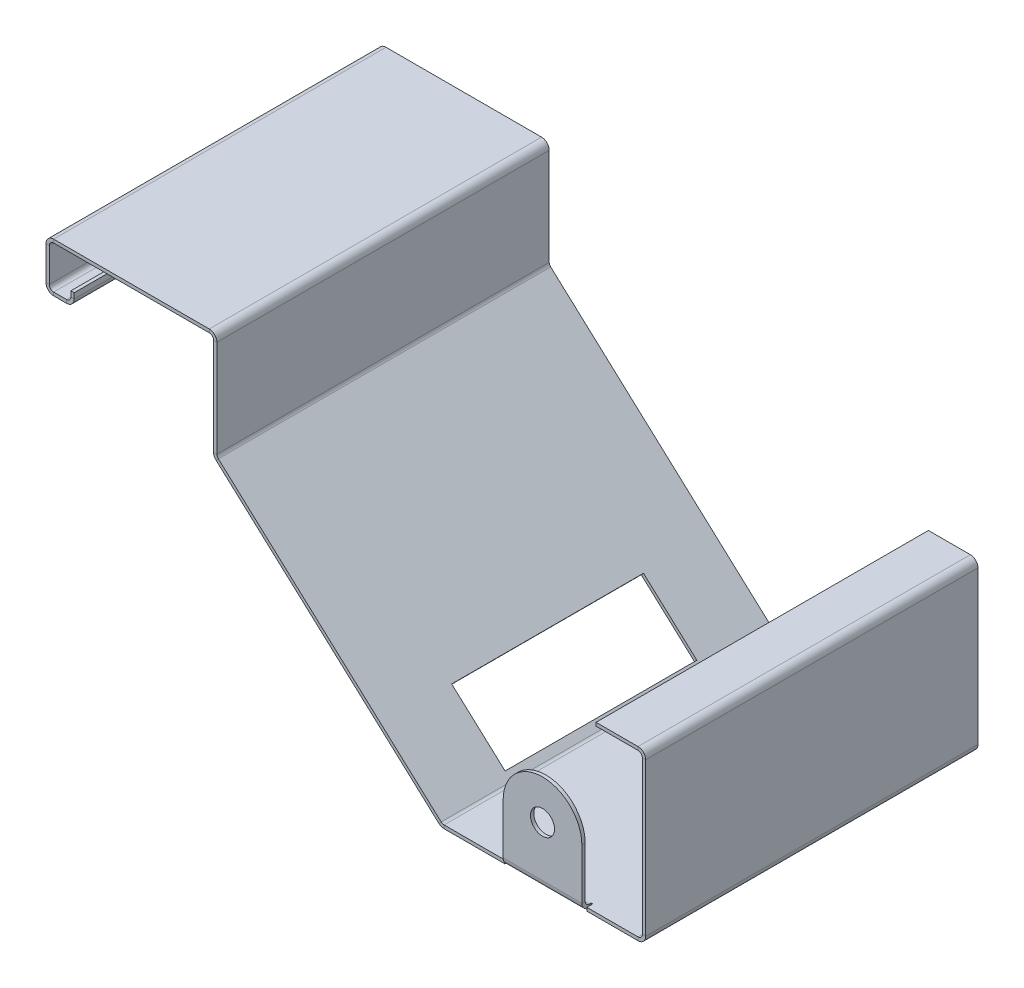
ISO-10303-21;
HEADER;
FILE_DESCRIPTION(('STEP AP214'),'2;1');
FILE_NAME('part.step','',(''),(''),'','','');
FILE_SCHEMA(('AUTOMOTIVE_DESIGN { 1 0 10303 214 1 1 1 1 }'));
ENDSEC;
DATA;
#1=APPLICATION_CONTEXT('core data for automotive mechanical design processes');
#2=APPLICATION_PROTOCOL_DEFINITION('international standard','automotive_design',2000,#1);
#3=PRODUCT_CONTEXT('',#1,'mechanical');
#4=PRODUCT('Part','Part','',(#3));
#5=PRODUCT_RELATED_PRODUCT_CATEGORY('part','',(#4));
#6=PRODUCT_DEFINITION_FORMATION('','',#4);
#7=PRODUCT_DEFINITION_CONTEXT('part definition',#1,'design');
#8=PRODUCT_DEFINITION('design','',#6,#7);
#9=PRODUCT_DEFINITION_SHAPE('','',#8);
#10=(LENGTH_UNIT() NAMED_UNIT(*) SI_UNIT(.MILLI.,.METRE.));
#11=(NAMED_UNIT(*) PLANE_ANGLE_UNIT() SI_UNIT($,.RADIAN.));
#12=(NAMED_UNIT(*) SI_UNIT($,.STERADIAN.) SOLID_ANGLE_UNIT());
#13=UNCERTAINTY_MEASURE_WITH_UNIT(LENGTH_MEASURE(1.E-05),#10,'distance_accuracy_value','');
#14=(GEOMETRIC_REPRESENTATION_CONTEXT(3) GLOBAL_UNCERTAINTY_ASSIGNED_CONTEXT((#13)) GLOBAL_UNIT_ASSIGNED_CONTEXT((#10,
#11,#12)) REPRESENTATION_CONTEXT('',''));
#15=CARTESIAN_POINT('',(0.,0.,0.));
#16=DIRECTION('',(0.,0.,1.));
#17=DIRECTION('',(1.,0.,0.));
#18=AXIS2_PLACEMENT_3D('',#15,#16,#17);
#19=CARTESIAN_POINT('',(0.,0.,76.2));
#20=DIRECTION('',(0.673526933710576,0.739162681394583,0.));
#21=DIRECTION('',(-0.739162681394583,0.673526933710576,0.));
#22=AXIS2_PLACEMENT_3D('',#19,#20,#21);
#23=PLANE('',#22);
#24=DIRECTION('',(0.,0.,-1.));
#25=VECTOR('',#24,1.);
#26=CARTESIAN_POINT('',(102.852582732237,-93.7195375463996,76.2));
#27=LINE('',#26,#25);
#28=CARTESIAN_POINT('',(102.852582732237,-93.7195375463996,76.2));
#29=VERTEX_POINT('',#28);
#30=CARTESIAN_POINT('',(102.852582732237,-93.7195375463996,-76.2));
#31=VERTEX_POINT('',#30);
#32=EDGE_CURVE('E993',#29,#31,#27,.T.);
#33=ORIENTED_EDGE('',*,*,#32,.T.);
#34=DIRECTION('',(0.739162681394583,-0.673526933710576,0.));
#35=VECTOR('',#34,1.);
#36=CARTESIAN_POINT('',(0.,0.,-76.2));
#37=LINE('',#36,#35);
#38=CARTESIAN_POINT('',(0.646808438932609,-0.589373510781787,-76.2));
#39=VERTEX_POINT('',#38);
#40=EDGE_CURVE('E575',#39,#31,#37,.T.);
#41=ORIENTED_EDGE('',*,*,#40,.F.);
#42=DIRECTION('',(0.,0.,-1.));
#43=VECTOR('',#42,1.);
#44=CARTESIAN_POINT('',(0.646808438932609,-0.589373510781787,76.2));
#45=LINE('',#44,#43);
#46=CARTESIAN_POINT('',(0.646808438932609,-0.589373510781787,76.2));
#47=VERTEX_POINT('',#46);
#48=EDGE_CURVE('E991',#47,#39,#45,.T.);
#49=ORIENTED_EDGE('',*,*,#48,.F.);
#50=DIRECTION('',(0.739162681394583,-0.673526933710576,0.));
#51=VECTOR('',#50,1.);
#52=CARTESIAN_POINT('',(0.,0.,76.2));
#53=LINE('',#52,#51);
#54=EDGE_CURVE('E852',#47,#29,#53,.T.);
#55=ORIENTED_EDGE('',*,*,#54,.T.);
#56=EDGE_LOOP('',(#33,#41,#49,#55));
#57=FACE_BOUND('',#56,.T.);
#58=DIRECTION('',(-0.739162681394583,0.673526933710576,0.));
#59=VECTOR('',#58,1.);
#60=CARTESIAN_POINT('',(0.,0.,-43.9675613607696));
#61=LINE('',#60,#59);
#62=CARTESIAN_POINT('',(99.9265610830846,-91.0533391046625,-43.9675613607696));
#63=VERTEX_POINT('',#62);
#64=CARTESIAN_POINT('',(75.4478012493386,-68.748230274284,-43.9675613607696));
#65=VERTEX_POINT('',#64);
#66=EDGE_CURVE('E438',#63,#65,#61,.T.);
#67=ORIENTED_EDGE('',*,*,#66,.F.);
#68=DIRECTION('',(0.,0.,1.));
#69=VECTOR('',#68,1.);
#70=CARTESIAN_POINT('',(99.9265610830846,-91.0533391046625,76.2));
#71=LINE('',#70,#69);
#72=CARTESIAN_POINT('',(99.9265610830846,-91.0533391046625,43.9675613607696));
#73=VERTEX_POINT('',#72);
#74=EDGE_CURVE('E727',#63,#73,#71,.T.);
#75=ORIENTED_EDGE('',*,*,#74,.T.);
#76=DIRECTION('',(-0.739162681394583,0.673526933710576,0.));
#77=VECTOR('',#76,1.);
#78=CARTESIAN_POINT('',(0.,0.,43.9675613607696));
#79=LINE('',#78,#77);
#80=CARTESIAN_POINT('',(75.4478012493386,-68.748230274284,43.9675613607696));
#81=VERTEX_POINT('',#80);
#82=EDGE_CURVE('E439',#73,#81,#79,.T.);
#83=ORIENTED_EDGE('',*,*,#82,.T.);
#84=DIRECTION('',(0.,0.,1.));
#85=VECTOR('',#84,1.);
#86=CARTESIAN_POINT('',(75.4478012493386,-68.748230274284,76.2));
#87=LINE('',#86,#85);
#88=EDGE_CURVE('E434',#81,#65,#87,.F.);
#89=ORIENTED_EDGE('',*,*,#88,.T.);
#90=EDGE_LOOP('',(#67,#75,#83,#89));
#91=FACE_BOUND('',#90,.T.);
#92=ADVANCED_FACE('F33',(#57,#91),#23,.T.);
#93=CARTESIAN_POINT('',(-1.02645504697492,-1.12648392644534,76.2));
#94=DIRECTION('',(0.673526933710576,0.739162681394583,0.));
#95=DIRECTION('',(-0.739162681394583,0.673526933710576,0.));
#96=AXIS2_PLACEMENT_3D('',#93,#94,#95);
#97=PLANE('',#96);
#98=DIRECTION('',(0.739162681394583,-0.673526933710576,0.));
#99=VECTOR('',#98,1.);
#100=CARTESIAN_POINT('',(-1.02645504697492,-1.12648392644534,-76.2));
#101=LINE('',#100,#99);
#102=CARTESIAN_POINT('',(-0.379646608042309,-1.71585743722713,-76.2));
#103=VERTEX_POINT('',#102);
#104=CARTESIAN_POINT('',(101.826127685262,-94.846021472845,-76.2));
#105=VERTEX_POINT('',#104);
#106=EDGE_CURVE('E641',#103,#105,#101,.T.);
#107=ORIENTED_EDGE('',*,*,#106,.T.);
#108=DIRECTION('',(0.,0.,-1.));
#109=VECTOR('',#108,1.);
#110=CARTESIAN_POINT('',(101.826127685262,-94.846021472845,76.2));
#111=LINE('',#110,#109);
#112=CARTESIAN_POINT('',(101.826127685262,-94.846021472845,76.2));
#113=VERTEX_POINT('',#112);
#114=EDGE_CURVE('E947',#113,#105,#111,.T.);
#115=ORIENTED_EDGE('',*,*,#114,.F.);
#116=DIRECTION('',(0.739162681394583,-0.673526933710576,0.));
#117=VECTOR('',#116,1.);
#118=CARTESIAN_POINT('',(-1.02645504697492,-1.12648392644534,76.2));
#119=LINE('',#118,#117);
#120=CARTESIAN_POINT('',(-0.379646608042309,-1.71585743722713,76.2));
#121=VERTEX_POINT('',#120);
#122=EDGE_CURVE('E918',#121,#113,#119,.T.);
#123=ORIENTED_EDGE('',*,*,#122,.F.);
#124=DIRECTION('',(0.,0.,-1.));
#125=VECTOR('',#124,1.);
#126=CARTESIAN_POINT('',(-0.379646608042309,-1.71585743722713,76.2));
#127=LINE('',#126,#125);
#128=EDGE_CURVE('E949',#121,#103,#127,.T.);
#129=ORIENTED_EDGE('',*,*,#128,.T.);
#130=EDGE_LOOP('',(#107,#115,#123,#129));
#131=FACE_BOUND('',#130,.T.);
#132=DIRECTION('',(0.,0.,1.));
#133=VECTOR('',#132,1.);
#134=CARTESIAN_POINT('',(98.9001060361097,-92.1798230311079,76.2));
#135=LINE('',#134,#133);
#136=CARTESIAN_POINT('',(98.9001060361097,-92.1798230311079,-43.9675613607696));
#137=VERTEX_POINT('',#136);
#138=CARTESIAN_POINT('',(98.9001060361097,-92.1798230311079,43.9675613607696));
#139=VERTEX_POINT('',#138);
#140=EDGE_CURVE('E728',#137,#139,#135,.T.);
#141=ORIENTED_EDGE('',*,*,#140,.F.);
#142=DIRECTION('',(-0.739162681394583,0.673526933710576,0.));
#143=VECTOR('',#142,1.);
#144=CARTESIAN_POINT('',(-1.02645504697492,-1.12648392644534,-43.9675613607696));
#145=LINE('',#144,#143);
#146=CARTESIAN_POINT('',(74.4213462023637,-69.8747142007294,-43.9675613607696));
#147=VERTEX_POINT('',#146);
#148=EDGE_CURVE('E454',#137,#147,#145,.T.);
#149=ORIENTED_EDGE('',*,*,#148,.T.);
#150=DIRECTION('',(0.,0.,-1.));
#151=VECTOR('',#150,1.);
#152=CARTESIAN_POINT('',(74.4213462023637,-69.8747142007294,76.2));
#153=LINE('',#152,#151);
#154=CARTESIAN_POINT('',(74.4213462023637,-69.8747142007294,43.9675613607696));
#155=VERTEX_POINT('',#154);
#156=EDGE_CURVE('E440',#155,#147,#153,.T.);
#157=ORIENTED_EDGE('',*,*,#156,.F.);
#158=DIRECTION('',(-0.739162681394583,0.673526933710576,0.));
#159=VECTOR('',#158,1.);
#160=CARTESIAN_POINT('',(-1.02645504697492,-1.12648392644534,43.9675613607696));
#161=LINE('',#160,#159);
#162=EDGE_CURVE('E730',#139,#155,#161,.T.);
#163=ORIENTED_EDGE('',*,*,#162,.F.);
#164=EDGE_LOOP('',(#141,#149,#157,#163));
#165=FACE_BOUND('',#164,.T.);
#166=ADVANCED_FACE('F1234',(#131,#165),#97,.F.);
#167=CARTESIAN_POINT('',(101.826127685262,-94.846021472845,76.2));
#168=DIRECTION('',(0.,0.,1.));
#169=DIRECTION('',(1.,0.,0.));
#170=AXIS2_PLACEMENT_3D('',#167,#168,#169);
#171=PLANE('',#170);
#172=DIRECTION('',(1.,0.,0.));
#173=VECTOR('',#172,1.);
#174=CARTESIAN_POINT('',(103.419713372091,-94.2363084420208,76.2));
#175=LINE('',#174,#173);
#176=CARTESIAN_POINT('',(169.652565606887,-94.2363084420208,76.2));
#177=VERTEX_POINT('',#176);
#178=CARTESIAN_POINT('',(193.12324093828,-94.2363084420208,76.2));
#179=VERTEX_POINT('',#178);
#180=EDGE_CURVE('E845',#177,#179,#175,.T.);
#181=ORIENTED_EDGE('',*,*,#180,.F.);
#182=DIRECTION('',(0.,-1.,0.));
#183=VECTOR('',#182,1.);
#184=CARTESIAN_POINT('',(169.652565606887,-94.2363084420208,76.2));
#185=LINE('',#184,#183);
#186=CARTESIAN_POINT('',(169.652565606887,-95.7603084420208,76.2));
#187=VERTEX_POINT('',#186);
#188=EDGE_CURVE('E800',#177,#187,#185,.T.);
#189=ORIENTED_EDGE('',*,*,#188,.T.);
#190=DIRECTION('',(1.,0.,0.));
#191=VECTOR('',#190,1.);
#192=CARTESIAN_POINT('',(103.419713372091,-95.7603084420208,76.2));
#193=LINE('',#192,#191);
#194=CARTESIAN_POINT('',(193.12324093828,-95.7603084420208,76.2));
#195=VERTEX_POINT('',#194);
#196=EDGE_CURVE('E924',#187,#195,#193,.T.);
#197=ORIENTED_EDGE('',*,*,#196,.T.);
#198=DIRECTION('',(0.,1.,0.));
#199=VECTOR('',#198,1.);
#200=CARTESIAN_POINT('',(193.12324093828,-95.7603084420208,76.2));
#201=LINE('',#200,#199);
#202=EDGE_CURVE('E1013',#195,#179,#201,.T.);
#203=ORIENTED_EDGE('',*,*,#202,.T.);
#204=EDGE_LOOP('',(#181,#189,#197,#203));
#205=FACE_BOUND('',#204,.T.);
#206=ADVANCED_FACE('F1065',(#205),#171,.T.);
#207=CARTESIAN_POINT('',(104.186974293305,-95.7603084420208,76.2));
#208=VERTEX_POINT('',#207);
#209=CARTESIAN_POINT('',(132.038096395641,-95.7603084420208,76.2));
#210=VERTEX_POINT('',#209);
#211=EDGE_CURVE('E925',#208,#210,#193,.T.);
#212=ORIENTED_EDGE('',*,*,#211,.T.);
#213=DIRECTION('',(0.,-1.,0.));
#214=VECTOR('',#213,1.);
#215=CARTESIAN_POINT('',(132.038096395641,-94.2363084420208,76.2));
#216=LINE('',#215,#214);
#217=CARTESIAN_POINT('',(132.038096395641,-94.2363084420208,76.2));
#218=VERTEX_POINT('',#217);
#219=EDGE_CURVE('E817',#218,#210,#216,.T.);
#220=ORIENTED_EDGE('',*,*,#219,.F.);
#221=CARTESIAN_POINT('',(104.186974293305,-94.2363084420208,76.2));
#222=VERTEX_POINT('',#221);
#223=EDGE_CURVE('E846',#222,#218,#175,.T.);
#224=ORIENTED_EDGE('',*,*,#223,.F.);
#225=DIRECTION('',(0.,-1.,0.));
#226=VECTOR('',#225,1.);
#227=CARTESIAN_POINT('',(104.186974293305,-94.2363084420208,76.2));
#228=LINE('',#227,#226);
#229=EDGE_CURVE('E1020',#222,#208,#228,.T.);
#230=ORIENTED_EDGE('',*,*,#229,.T.);
#231=EDGE_LOOP('',(#212,#220,#224,#230));
#232=FACE_BOUND('',#231,.T.);
#233=ADVANCED_FACE('F1180',(#232),#171,.T.);
#234=CARTESIAN_POINT('',(103.419713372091,-94.2363084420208,76.2));
#235=DIRECTION('',(0.,1.,0.));
#236=DIRECTION('',(0.,0.,1.));
#237=AXIS2_PLACEMENT_3D('',#234,#235,#236);
#238=PLANE('',#237);
#239=DIRECTION('',(-1.,0.,0.));
#240=VECTOR('',#239,1.);
#241=CARTESIAN_POINT('',(169.652565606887,-94.2363084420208,73.4568));
#242=LINE('',#241,#240);
#243=CARTESIAN_POINT('',(169.652565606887,-94.2363084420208,73.4568));
#244=VERTEX_POINT('',#243);
#245=CARTESIAN_POINT('',(168.890565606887,-94.2363084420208,73.4568));
#246=VERTEX_POINT('',#245);
#247=EDGE_CURVE('E56',#244,#246,#242,.T.);
#248=ORIENTED_EDGE('',*,*,#247,.F.);
#249=DIRECTION('',(0.,0.,-1.));
#250=VECTOR('',#249,1.);
#251=CARTESIAN_POINT('',(169.652565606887,-94.2363084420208,76.2));
#252=LINE('',#251,#250);
#253=EDGE_CURVE('E796',#177,#244,#252,.T.);
#254=ORIENTED_EDGE('',*,*,#253,.F.);
#255=ORIENTED_EDGE('',*,*,#180,.T.);
#256=DIRECTION('',(0.,0.,-1.));
#257=VECTOR('',#256,1.);
#258=CARTESIAN_POINT('',(193.12324093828,-94.2363084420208,76.2));
#259=LINE('',#258,#257);
#260=CARTESIAN_POINT('',(193.12324093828,-94.2363084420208,-76.2));
#261=VERTEX_POINT('',#260);
#262=EDGE_CURVE('E997',#179,#261,#259,.T.);
#263=ORIENTED_EDGE('',*,*,#262,.T.);
#264=DIRECTION('',(1.,0.,0.));
#265=VECTOR('',#264,1.);
#266=CARTESIAN_POINT('',(103.419713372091,-94.2363084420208,-76.2));
#267=LINE('',#266,#265);
#268=CARTESIAN_POINT('',(169.652565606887,-94.2363084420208,-76.2));
#269=VERTEX_POINT('',#268);
#270=EDGE_CURVE('E568',#269,#261,#267,.T.);
#271=ORIENTED_EDGE('',*,*,#270,.F.);
#272=DIRECTION('',(0.,0.,1.));
#273=VECTOR('',#272,1.);
#274=CARTESIAN_POINT('',(169.652565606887,-94.2363084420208,-76.2));
#275=LINE('',#274,#273);
#276=CARTESIAN_POINT('',(169.652565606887,-94.2363084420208,-73.4568));
#277=VERTEX_POINT('',#276);
#278=EDGE_CURVE('E520',#269,#277,#275,.T.);
#279=ORIENTED_EDGE('',*,*,#278,.T.);
#280=DIRECTION('',(-1.,0.,0.));
#281=VECTOR('',#280,1.);
#282=CARTESIAN_POINT('',(169.652565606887,-94.2363084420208,-73.4568));
#283=LINE('',#282,#281);
#284=CARTESIAN_POINT('',(168.890565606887,-94.2363084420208,-73.4568));
#285=VERTEX_POINT('',#284);
#286=EDGE_CURVE('E525',#277,#285,#283,.T.);
#287=ORIENTED_EDGE('',*,*,#286,.T.);
#288=DIRECTION('',(0.,0.,-1.));
#289=VECTOR('',#288,1.);
#290=CARTESIAN_POINT('',(168.890565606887,-94.2363084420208,-73.4568));
#291=LINE('',#290,#289);
#292=CARTESIAN_POINT('',(168.890565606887,-94.2363084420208,-74.2188));
#293=VERTEX_POINT('',#292);
#294=EDGE_CURVE('E529',#285,#293,#291,.T.);
#295=ORIENTED_EDGE('',*,*,#294,.T.);
#296=DIRECTION('',(1.,0.,0.));
#297=VECTOR('',#296,1.);
#298=CARTESIAN_POINT('',(168.890565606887,-94.2363084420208,-74.2188));
#299=LINE('',#298,#297);
#300=CARTESIAN_POINT('',(132.800096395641,-94.2363084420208,-74.2188));
#301=VERTEX_POINT('',#300);
#302=EDGE_CURVE('E510',#293,#301,#299,.F.);
#303=ORIENTED_EDGE('',*,*,#302,.T.);
#304=DIRECTION('',(0.,0.,1.));
#305=VECTOR('',#304,1.);
#306=CARTESIAN_POINT('',(132.800096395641,-94.2363084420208,-74.2188));
#307=LINE('',#306,#305);
#308=CARTESIAN_POINT('',(132.800096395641,-94.2363084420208,-73.4568));
#309=VERTEX_POINT('',#308);
#310=EDGE_CURVE('E533',#301,#309,#307,.T.);
#311=ORIENTED_EDGE('',*,*,#310,.T.);
#312=DIRECTION('',(-1.,0.,0.));
#313=VECTOR('',#312,1.);
#314=CARTESIAN_POINT('',(132.800096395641,-94.2363084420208,-73.4568));
#315=LINE('',#314,#313);
#316=CARTESIAN_POINT('',(132.038096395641,-94.2363084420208,-73.4568));
#317=VERTEX_POINT('',#316);
#318=EDGE_CURVE('E536',#309,#317,#315,.T.);
#319=ORIENTED_EDGE('',*,*,#318,.T.);
#320=DIRECTION('',(0.,0.,-1.));
#321=VECTOR('',#320,1.);
#322=CARTESIAN_POINT('',(132.038096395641,-94.2363084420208,-73.4568));
#323=LINE('',#322,#321);
#324=CARTESIAN_POINT('',(132.038096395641,-94.2363084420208,-76.2));
#325=VERTEX_POINT('',#324);
#326=EDGE_CURVE('E540',#317,#325,#323,.T.);
#327=ORIENTED_EDGE('',*,*,#326,.T.);
#328=CARTESIAN_POINT('',(104.186974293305,-94.2363084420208,-76.2));
#329=VERTEX_POINT('',#328);
#330=EDGE_CURVE('E569',#329,#325,#267,.T.);
#331=ORIENTED_EDGE('',*,*,#330,.F.);
#332=DIRECTION('',(0.,0.,-1.));
#333=VECTOR('',#332,1.);
#334=CARTESIAN_POINT('',(104.186974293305,-94.2363084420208,76.2));
#335=LINE('',#334,#333);
#336=EDGE_CURVE('E995',#222,#329,#335,.T.);
#337=ORIENTED_EDGE('',*,*,#336,.F.);
#338=ORIENTED_EDGE('',*,*,#223,.T.);
#339=DIRECTION('',(0.,0.,1.));
#340=VECTOR('',#339,1.);
#341=CARTESIAN_POINT('',(132.038096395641,-94.2363084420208,73.4568));
#342=LINE('',#341,#340);
#343=CARTESIAN_POINT('',(132.038096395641,-94.2363084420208,73.4568));
#344=VERTEX_POINT('',#343);
#345=EDGE_CURVE('E814',#344,#218,#342,.T.);
#346=ORIENTED_EDGE('',*,*,#345,.F.);
#347=DIRECTION('',(-1.,0.,0.));
#348=VECTOR('',#347,1.);
#349=CARTESIAN_POINT('',(132.800096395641,-94.2363084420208,73.4568));
#350=LINE('',#349,#348);
#351=CARTESIAN_POINT('',(132.800096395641,-94.2363084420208,73.4568));
#352=VERTEX_POINT('',#351);
#353=EDGE_CURVE('E810',#352,#344,#350,.T.);
#354=ORIENTED_EDGE('',*,*,#353,.F.);
#355=DIRECTION('',(0.,0.,-1.));
#356=VECTOR('',#355,1.);
#357=CARTESIAN_POINT('',(132.800096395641,-94.2363084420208,74.2188));
#358=LINE('',#357,#356);
#359=CARTESIAN_POINT('',(132.800096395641,-94.2363084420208,74.2188));
#360=VERTEX_POINT('',#359);
#361=EDGE_CURVE('E807',#360,#352,#358,.T.);
#362=ORIENTED_EDGE('',*,*,#361,.F.);
#363=DIRECTION('',(1.,0.,0.));
#364=VECTOR('',#363,1.);
#365=CARTESIAN_POINT('',(168.890565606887,-94.2363084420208,74.2188));
#366=LINE('',#365,#364);
#367=CARTESIAN_POINT('',(168.890565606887,-94.2363084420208,74.2188));
#368=VERTEX_POINT('',#367);
#369=EDGE_CURVE('E786',#368,#360,#366,.F.);
#370=ORIENTED_EDGE('',*,*,#369,.F.);
#371=DIRECTION('',(0.,0.,1.));
#372=VECTOR('',#371,1.);
#373=CARTESIAN_POINT('',(168.890565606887,-94.2363084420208,73.4568));
#374=LINE('',#373,#372);
#375=EDGE_CURVE('E803',#246,#368,#374,.T.);
#376=ORIENTED_EDGE('',*,*,#375,.F.);
#377=EDGE_LOOP('',(#248,#254,#255,#263,#271,#279,#287,#295,#303,#311,#319,#327,#331,#337,#338,
#346,#354,#362,#370,#376));
#378=FACE_BOUND('',#377,.T.);
#379=ADVANCED_FACE('F1063',(#378),#238,.T.);
#380=CARTESIAN_POINT('',(103.419713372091,-95.7603084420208,76.2));
#381=DIRECTION('',(0.,1.,0.));
#382=DIRECTION('',(0.,0.,1.));
#383=AXIS2_PLACEMENT_3D('',#380,#381,#382);
#384=PLANE('',#383);
#385=DIRECTION('',(0.,0.,1.));
#386=VECTOR('',#385,1.);
#387=CARTESIAN_POINT('',(169.652565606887,-95.7603084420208,76.2));
#388=LINE('',#387,#386);
#389=CARTESIAN_POINT('',(169.652565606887,-95.7603084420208,73.4568));
#390=VERTEX_POINT('',#389);
#391=EDGE_CURVE('E11',#390,#187,#388,.T.);
#392=ORIENTED_EDGE('',*,*,#391,.F.);
#393=DIRECTION('',(1.,0.,0.));
#394=VECTOR('',#393,1.);
#395=CARTESIAN_POINT('',(103.419713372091,-95.7603084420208,73.4568));
#396=LINE('',#395,#394);
#397=CARTESIAN_POINT('',(168.890565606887,-95.7603084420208,73.4568));
#398=VERTEX_POINT('',#397);
#399=EDGE_CURVE('E41',#398,#390,#396,.T.);
#400=ORIENTED_EDGE('',*,*,#399,.F.);
#401=DIRECTION('',(0.,0.,-1.));
#402=VECTOR('',#401,1.);
#403=CARTESIAN_POINT('',(168.890565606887,-95.7603084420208,76.2));
#404=LINE('',#403,#402);
#405=CARTESIAN_POINT('',(168.890565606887,-95.7603084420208,74.2188));
#406=VERTEX_POINT('',#405);
#407=EDGE_CURVE('E1051',#406,#398,#404,.T.);
#408=ORIENTED_EDGE('',*,*,#407,.F.);
#409=DIRECTION('',(1.,0.,0.));
#410=VECTOR('',#409,1.);
#411=CARTESIAN_POINT('',(168.890565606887,-95.7603084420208,74.2188));
#412=LINE('',#411,#410);
#413=CARTESIAN_POINT('',(132.800096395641,-95.7603084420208,74.2188));
#414=VERTEX_POINT('',#413);
#415=EDGE_CURVE('E774',#406,#414,#412,.F.);
#416=ORIENTED_EDGE('',*,*,#415,.T.);
#417=DIRECTION('',(0.,0.,1.));
#418=VECTOR('',#417,1.);
#419=CARTESIAN_POINT('',(132.800096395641,-95.7603084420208,76.2));
#420=LINE('',#419,#418);
#421=CARTESIAN_POINT('',(132.800096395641,-95.7603084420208,73.4568));
#422=VERTEX_POINT('',#421);
#423=EDGE_CURVE('E1048',#422,#414,#420,.T.);
#424=ORIENTED_EDGE('',*,*,#423,.F.);
#425=DIRECTION('',(1.,0.,0.));
#426=VECTOR('',#425,1.);
#427=CARTESIAN_POINT('',(103.419713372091,-95.7603084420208,73.4568));
#428=LINE('',#427,#426);
#429=CARTESIAN_POINT('',(132.038096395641,-95.7603084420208,73.4568));
#430=VERTEX_POINT('',#429);
#431=EDGE_CURVE('E1045',#430,#422,#428,.T.);
#432=ORIENTED_EDGE('',*,*,#431,.F.);
#433=DIRECTION('',(0.,0.,-1.));
#434=VECTOR('',#433,1.);
#435=CARTESIAN_POINT('',(132.038096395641,-95.7603084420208,76.2));
#436=LINE('',#435,#434);
#437=EDGE_CURVE('E1042',#210,#430,#436,.T.);
#438=ORIENTED_EDGE('',*,*,#437,.F.);
#439=ORIENTED_EDGE('',*,*,#211,.F.);
#440=DIRECTION('',(0.,0.,-1.));
#441=VECTOR('',#440,1.);
#442=CARTESIAN_POINT('',(104.186974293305,-95.7603084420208,76.2));
#443=LINE('',#442,#441);
#444=CARTESIAN_POINT('',(104.186974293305,-95.7603084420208,-76.2));
#445=VERTEX_POINT('',#444);
#446=EDGE_CURVE('E945',#208,#445,#443,.T.);
#447=ORIENTED_EDGE('',*,*,#446,.T.);
#448=DIRECTION('',(1.,0.,0.));
#449=VECTOR('',#448,1.);
#450=CARTESIAN_POINT('',(103.419713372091,-95.7603084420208,-76.2));
#451=LINE('',#450,#449);
#452=CARTESIAN_POINT('',(132.038096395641,-95.7603084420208,-76.2));
#453=VERTEX_POINT('',#452);
#454=EDGE_CURVE('E648',#445,#453,#451,.T.);
#455=ORIENTED_EDGE('',*,*,#454,.T.);
#456=DIRECTION('',(0.,0.,1.));
#457=VECTOR('',#456,1.);
#458=CARTESIAN_POINT('',(132.038096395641,-95.7603084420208,-76.2));
#459=LINE('',#458,#457);
#460=CARTESIAN_POINT('',(132.038096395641,-95.7603084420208,-73.4568));
#461=VERTEX_POINT('',#460);
#462=EDGE_CURVE('E708',#453,#461,#459,.T.);
#463=ORIENTED_EDGE('',*,*,#462,.T.);
#464=DIRECTION('',(1.,0.,0.));
#465=VECTOR('',#464,1.);
#466=CARTESIAN_POINT('',(103.419713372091,-95.7603084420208,-73.4568));
#467=LINE('',#466,#465);
#468=CARTESIAN_POINT('',(132.800096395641,-95.7603084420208,-73.4568));
#469=VERTEX_POINT('',#468);
#470=EDGE_CURVE('E711',#461,#469,#467,.T.);
#471=ORIENTED_EDGE('',*,*,#470,.T.);
#472=DIRECTION('',(0.,0.,-1.));
#473=VECTOR('',#472,1.);
#474=CARTESIAN_POINT('',(132.800096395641,-95.7603084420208,-76.2));
#475=LINE('',#474,#473);
#476=CARTESIAN_POINT('',(132.800096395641,-95.7603084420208,-74.2188));
#477=VERTEX_POINT('',#476);
#478=EDGE_CURVE('E714',#469,#477,#475,.T.);
#479=ORIENTED_EDGE('',*,*,#478,.T.);
#480=DIRECTION('',(1.,0.,0.));
#481=VECTOR('',#480,1.);
#482=CARTESIAN_POINT('',(168.890565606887,-95.7603084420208,-74.2188));
#483=LINE('',#482,#481);
#484=CARTESIAN_POINT('',(168.890565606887,-95.7603084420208,-74.2188));
#485=VERTEX_POINT('',#484);
#486=EDGE_CURVE('E498',#485,#477,#483,.F.);
#487=ORIENTED_EDGE('',*,*,#486,.F.);
#488=DIRECTION('',(0.,0.,1.));
#489=VECTOR('',#488,1.);
#490=CARTESIAN_POINT('',(168.890565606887,-95.7603084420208,-76.2));
#491=LINE('',#490,#489);
#492=CARTESIAN_POINT('',(168.890565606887,-95.7603084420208,-73.4568));
#493=VERTEX_POINT('',#492);
#494=EDGE_CURVE('E717',#485,#493,#491,.T.);
#495=ORIENTED_EDGE('',*,*,#494,.T.);
#496=DIRECTION('',(1.,0.,0.));
#497=VECTOR('',#496,1.);
#498=CARTESIAN_POINT('',(103.419713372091,-95.7603084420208,-73.4568));
#499=LINE('',#498,#497);
#500=CARTESIAN_POINT('',(169.652565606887,-95.7603084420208,-73.4568));
#501=VERTEX_POINT('',#500);
#502=EDGE_CURVE('E720',#493,#501,#499,.T.);
#503=ORIENTED_EDGE('',*,*,#502,.T.);
#504=DIRECTION('',(0.,0.,-1.));
#505=VECTOR('',#504,1.);
#506=CARTESIAN_POINT('',(169.652565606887,-95.7603084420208,-76.2));
#507=LINE('',#506,#505);
#508=CARTESIAN_POINT('',(169.652565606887,-95.7603084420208,-76.2));
#509=VERTEX_POINT('',#508);
#510=EDGE_CURVE('E723',#501,#509,#507,.T.);
#511=ORIENTED_EDGE('',*,*,#510,.T.);
#512=CARTESIAN_POINT('',(193.12324093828,-95.7603084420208,-76.2));
#513=VERTEX_POINT('',#512);
#514=EDGE_CURVE('E647',#509,#513,#451,.T.);
#515=ORIENTED_EDGE('',*,*,#514,.T.);
#516=DIRECTION('',(0.,0.,-1.));
#517=VECTOR('',#516,1.);
#518=CARTESIAN_POINT('',(193.12324093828,-95.7603084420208,76.2));
#519=LINE('',#518,#517);
#520=EDGE_CURVE('E943',#195,#513,#519,.T.);
#521=ORIENTED_EDGE('',*,*,#520,.F.);
#522=ORIENTED_EDGE('',*,*,#196,.F.);
#523=EDGE_LOOP('',(#392,#400,#408,#416,#424,#432,#438,#439,#447,#455,#463,#471,#479,#487,#495,
#503,#511,#515,#521,#522));
#524=FACE_BOUND('',#523,.T.);
#525=ADVANCED_FACE('F1250',(#524),#384,.F.);
#526=CARTESIAN_POINT('',(-68.954022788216,26.345222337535,76.2));
#527=DIRECTION('',(0.,0.,1.));
#528=DIRECTION('',(1.,0.,0.));
#529=AXIS2_PLACEMENT_3D('',#526,#527,#528);
#530=PLANE('',#529);
#531=DIRECTION('',(0.,1.,0.));
#532=VECTOR('',#531,1.);
#533=CARTESIAN_POINT('',(-68.954022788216,26.345222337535,76.2));
#534=LINE('',#533,#532);
#535=CARTESIAN_POINT('',(-68.954022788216,26.345222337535,76.2));
#536=VERTEX_POINT('',#535);
#537=CARTESIAN_POINT('',(-68.954022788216,27.869222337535,76.2));
#538=VERTEX_POINT('',#537);
#539=EDGE_CURVE('E1040',#536,#538,#534,.T.);
#540=ORIENTED_EDGE('',*,*,#539,.F.);
#541=CARTESIAN_POINT('',(-68.954022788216,29.850422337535,76.2));
#542=DIRECTION('',(0.,0.,1.));
#543=DIRECTION('',(1.,0.,0.));
#544=AXIS2_PLACEMENT_3D('',#541,#542,#543);
#545=CIRCLE('',#544,3.5052);
#546=CARTESIAN_POINT('',(-65.448822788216,29.850422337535,76.2));
#547=VERTEX_POINT('',#546);
#548=EDGE_CURVE('E879',#547,#536,#545,.F.);
#549=ORIENTED_EDGE('',*,*,#548,.F.);
#550=DIRECTION('',(1.,0.,0.));
#551=VECTOR('',#550,1.);
#552=CARTESIAN_POINT('',(-66.972822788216,29.850422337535,76.2));
#553=LINE('',#552,#551);
#554=CARTESIAN_POINT('',(-66.972822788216,29.850422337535,76.2));
#555=VERTEX_POINT('',#554);
#556=EDGE_CURVE('E1038',#555,#547,#553,.T.);
#557=ORIENTED_EDGE('',*,*,#556,.F.);
#558=CARTESIAN_POINT('',(-68.954022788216,29.850422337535,76.2));
#559=DIRECTION('',(0.,0.,1.));
#560=DIRECTION('',(1.,0.,0.));
#561=AXIS2_PLACEMENT_3D('',#558,#559,#560);
#562=CIRCLE('',#561,1.9812);
#563=EDGE_CURVE('E891',#555,#538,#562,.F.);
#564=ORIENTED_EDGE('',*,*,#563,.T.);
#565=EDGE_LOOP('',(#540,#549,#557,#564));
#566=FACE_BOUND('',#565,.T.);
#567=ADVANCED_FACE('F35',(#566),#530,.T.);
#568=CARTESIAN_POINT('',(-66.972822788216,29.850422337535,76.2));
#569=DIRECTION('',(0.,0.,1.));
#570=DIRECTION('',(1.,0.,0.));
#571=AXIS2_PLACEMENT_3D('',#568,#569,#570);
#572=PLANE('',#571);
#573=DIRECTION('',(-1.,0.,0.));
#574=VECTOR('',#573,1.);
#575=CARTESIAN_POINT('',(-65.448822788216,26.345222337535,76.2));
#576=LINE('',#575,#574);
#577=CARTESIAN_POINT('',(-74.8676941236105,26.345222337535,76.2));
#578=VERTEX_POINT('',#577);
#579=EDGE_CURVE('E876',#536,#578,#576,.T.);
#580=ORIENTED_EDGE('',*,*,#579,.F.);
#581=ORIENTED_EDGE('',*,*,#539,.T.);
#582=DIRECTION('',(1.,0.,0.));
#583=VECTOR('',#582,1.);
#584=CARTESIAN_POINT('',(-65.448822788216,27.869222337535,76.2));
#585=LINE('',#584,#583);
#586=CARTESIAN_POINT('',(-74.8676941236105,27.869222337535,76.2));
#587=VERTEX_POINT('',#586);
#588=EDGE_CURVE('E894',#538,#587,#585,.F.);
#589=ORIENTED_EDGE('',*,*,#588,.T.);
#590=DIRECTION('',(0.,-1.,0.));
#591=VECTOR('',#590,1.);
#592=CARTESIAN_POINT('',(-74.8676941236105,27.869222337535,76.2));
#593=LINE('',#592,#591);
#594=EDGE_CURVE('E1034',#587,#578,#593,.T.);
#595=ORIENTED_EDGE('',*,*,#594,.T.);
#596=EDGE_LOOP('',(#580,#581,#589,#595));
#597=FACE_BOUND('',#596,.T.);
#598=ADVANCED_FACE('F1309',(#597),#572,.T.);
#599=CARTESIAN_POINT('',(-78.3728941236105,29.850422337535,76.2));
#600=DIRECTION('',(0.,0.,1.));
#601=DIRECTION('',(1.,0.,0.));
#602=AXIS2_PLACEMENT_3D('',#599,#600,#601);
#603=PLANE('',#602);
#604=DIRECTION('',(1.,0.,0.));
#605=VECTOR('',#604,1.);
#606=CARTESIAN_POINT('',(-78.3728941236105,29.850422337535,76.2));
#607=LINE('',#606,#605);
#608=CARTESIAN_POINT('',(-78.3728941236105,29.850422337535,76.2));
#609=VERTEX_POINT('',#608);
#610=CARTESIAN_POINT('',(-76.8488941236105,29.850422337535,76.2));
#611=VERTEX_POINT('',#610);
#612=EDGE_CURVE('E1036',#609,#611,#607,.T.);
#613=ORIENTED_EDGE('',*,*,#612,.F.);
#614=CARTESIAN_POINT('',(-74.8676941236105,29.850422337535,76.2));
#615=DIRECTION('',(0.,0.,1.));
#616=DIRECTION('',(1.,0.,0.));
#617=AXIS2_PLACEMENT_3D('',#614,#615,#616);
#618=CIRCLE('',#617,3.5052);
#619=EDGE_CURVE('E873',#578,#609,#618,.F.);
#620=ORIENTED_EDGE('',*,*,#619,.F.);
#621=ORIENTED_EDGE('',*,*,#594,.F.);
#622=CARTESIAN_POINT('',(-74.8676941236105,29.850422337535,76.2));
#623=DIRECTION('',(0.,0.,1.));
#624=DIRECTION('',(1.,0.,0.));
#625=AXIS2_PLACEMENT_3D('',#622,#623,#624);
#626=CIRCLE('',#625,1.9812);
#627=EDGE_CURVE('E897',#587,#611,#626,.F.);
#628=ORIENTED_EDGE('',*,*,#627,.T.);
#629=EDGE_LOOP('',(#613,#620,#621,#628));
#630=FACE_BOUND('',#629,.T.);
#631=ADVANCED_FACE('F1306',(#630),#603,.T.);
#632=CARTESIAN_POINT('',(-74.8676941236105,27.869222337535,76.2));
#633=DIRECTION('',(0.,0.,1.));
#634=DIRECTION('',(1.,0.,0.));
#635=AXIS2_PLACEMENT_3D('',#632,#633,#634);
#636=PLANE('',#635);
#637=DIRECTION('',(0.,1.,0.));
#638=VECTOR('',#637,1.);
#639=CARTESIAN_POINT('',(-78.3728941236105,26.345222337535,76.2));
#640=LINE('',#639,#638);
#641=CARTESIAN_POINT('',(-78.3728941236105,45.3743005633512,76.2));
#642=VERTEX_POINT('',#641);
#643=EDGE_CURVE('E870',#609,#642,#640,.T.);
#644=ORIENTED_EDGE('',*,*,#643,.F.);
#645=ORIENTED_EDGE('',*,*,#612,.T.);
#646=DIRECTION('',(0.,1.,0.));
#647=VECTOR('',#646,1.);
#648=CARTESIAN_POINT('',(-76.8488941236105,26.345222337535,76.2));
#649=LINE('',#648,#647);
#650=CARTESIAN_POINT('',(-76.8488941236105,45.3743005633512,76.2));
#651=VERTEX_POINT('',#650);
#652=EDGE_CURVE('E900',#611,#651,#649,.T.);
#653=ORIENTED_EDGE('',*,*,#652,.T.);
#654=DIRECTION('',(-1.,0.,0.));
#655=VECTOR('',#654,1.);
#656=CARTESIAN_POINT('',(-76.8488941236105,45.3743005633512,76.2));
#657=LINE('',#656,#655);
#658=EDGE_CURVE('E1030',#651,#642,#657,.T.);
#659=ORIENTED_EDGE('',*,*,#658,.T.);
#660=EDGE_LOOP('',(#644,#645,#653,#659));
#661=FACE_BOUND('',#660,.T.);
#662=ADVANCED_FACE('F1302',(#661),#636,.T.);
#663=CARTESIAN_POINT('',(-74.8676941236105,48.8795005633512,76.2));
#664=DIRECTION('',(0.,0.,1.));
#665=DIRECTION('',(1.,0.,0.));
#666=AXIS2_PLACEMENT_3D('',#663,#664,#665);
#667=PLANE('',#666);
#668=DIRECTION('',(0.,-1.,0.));
#669=VECTOR('',#668,1.);
#670=CARTESIAN_POINT('',(-74.8676941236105,48.8795005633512,76.2));
#671=LINE('',#670,#669);
#672=CARTESIAN_POINT('',(-74.8676941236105,48.8795005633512,76.2));
#673=VERTEX_POINT('',#672);
#674=CARTESIAN_POINT('',(-74.8676941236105,47.3555005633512,76.2));
#675=VERTEX_POINT('',#674);
#676=EDGE_CURVE('E1032',#673,#675,#671,.T.);
#677=ORIENTED_EDGE('',*,*,#676,.F.);
#678=CARTESIAN_POINT('',(-74.8676941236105,45.3743005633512,76.2));
#679=DIRECTION('',(0.,0.,1.));
#680=DIRECTION('',(1.,0.,0.));
#681=AXIS2_PLACEMENT_3D('',#678,#679,#680);
#682=CIRCLE('',#681,3.5052);
#683=EDGE_CURVE('E867',#642,#673,#682,.F.);
#684=ORIENTED_EDGE('',*,*,#683,.F.);
#685=ORIENTED_EDGE('',*,*,#658,.F.);
#686=CARTESIAN_POINT('',(-74.8676941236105,45.3743005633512,76.2));
#687=DIRECTION('',(0.,0.,1.));
#688=DIRECTION('',(1.,0.,0.));
#689=AXIS2_PLACEMENT_3D('',#686,#687,#688);
#690=CIRCLE('',#689,1.9812);
#691=EDGE_CURVE('E903',#651,#675,#690,.F.);
#692=ORIENTED_EDGE('',*,*,#691,.T.);
#693=EDGE_LOOP('',(#677,#684,#685,#692));
#694=FACE_BOUND('',#693,.T.);
#695=ADVANCED_FACE('F1298',(#694),#667,.T.);
#696=CARTESIAN_POINT('',(-76.8488941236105,45.3743005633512,76.2));
#697=DIRECTION('',(0.,0.,1.));
#698=DIRECTION('',(1.,0.,0.));
#699=AXIS2_PLACEMENT_3D('',#696,#697,#698);
#700=PLANE('',#699);
#701=DIRECTION('',(1.,0.,0.));
#702=VECTOR('',#701,1.);
#703=CARTESIAN_POINT('',(-78.3728941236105,48.8795005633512,76.2));
#704=LINE('',#703,#702);
#705=CARTESIAN_POINT('',(-3.5052,48.8795005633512,76.2));
#706=VERTEX_POINT('',#705);
#707=EDGE_CURVE('E864',#673,#706,#704,.T.);
#708=ORIENTED_EDGE('',*,*,#707,.F.);
#709=ORIENTED_EDGE('',*,*,#676,.T.);
#710=DIRECTION('',(1.,0.,0.));
#711=VECTOR('',#710,1.);
#712=CARTESIAN_POINT('',(-78.3728941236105,47.3555005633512,76.2));
#713=LINE('',#712,#711);
#714=CARTESIAN_POINT('',(-3.5052,47.3555005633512,76.2));
#715=VERTEX_POINT('',#714);
#716=EDGE_CURVE('E906',#675,#715,#713,.T.);
#717=ORIENTED_EDGE('',*,*,#716,.T.);
#718=DIRECTION('',(0.,1.,0.));
#719=VECTOR('',#718,1.);
#720=CARTESIAN_POINT('',(-3.5052,47.3555005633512,76.2));
#721=LINE('',#720,#719);
#722=EDGE_CURVE('E1026',#715,#706,#721,.T.);
#723=ORIENTED_EDGE('',*,*,#722,.T.);
#724=EDGE_LOOP('',(#708,#709,#717,#723));
#725=FACE_BOUND('',#724,.T.);
#726=ADVANCED_FACE('F1294',(#725),#700,.T.);
#727=CARTESIAN_POINT('',(0.,45.3743005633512,76.2));
#728=DIRECTION('',(0.,0.,1.));
#729=DIRECTION('',(1.,0.,0.));
#730=AXIS2_PLACEMENT_3D('',#727,#728,#729);
#731=PLANE('',#730);
#732=DIRECTION('',(-1.,0.,0.));
#733=VECTOR('',#732,1.);
#734=CARTESIAN_POINT('',(0.,45.3743005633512,76.2));
#735=LINE('',#734,#733);
#736=CARTESIAN_POINT('',(0.,45.3743005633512,76.2));
#737=VERTEX_POINT('',#736);
#738=CARTESIAN_POINT('',(-1.524,45.3743005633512,76.2));
#739=VERTEX_POINT('',#738);
#740=EDGE_CURVE('E1028',#737,#739,#735,.T.);
#741=ORIENTED_EDGE('',*,*,#740,.F.);
#742=CARTESIAN_POINT('',(-3.5052,45.3743005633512,76.2));
#743=DIRECTION('',(0.,0.,1.));
#744=DIRECTION('',(1.,0.,0.));
#745=AXIS2_PLACEMENT_3D('',#742,#743,#744);
#746=CIRCLE('',#745,3.5052);
#747=EDGE_CURVE('E861',#706,#737,#746,.F.);
#748=ORIENTED_EDGE('',*,*,#747,.F.);
#749=ORIENTED_EDGE('',*,*,#722,.F.);
#750=CARTESIAN_POINT('',(-3.5052,45.3743005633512,76.2));
#751=DIRECTION('',(0.,0.,1.));
#752=DIRECTION('',(1.,0.,0.));
#753=AXIS2_PLACEMENT_3D('',#750,#751,#752);
#754=CIRCLE('',#753,1.9812);
#755=EDGE_CURVE('E909',#715,#739,#754,.F.);
#756=ORIENTED_EDGE('',*,*,#755,.T.);
#757=EDGE_LOOP('',(#741,#748,#749,#756));
#758=FACE_BOUND('',#757,.T.);
#759=ADVANCED_FACE('F1290',(#758),#731,.T.);
#760=CARTESIAN_POINT('',(-3.5052,47.3555005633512,76.2));
#761=DIRECTION('',(0.,0.,1.));
#762=DIRECTION('',(1.,0.,0.));
#763=AXIS2_PLACEMENT_3D('',#760,#761,#762);
#764=PLANE('',#763);
#765=DIRECTION('',(0.,-1.,0.));
#766=VECTOR('',#765,1.);
#767=CARTESIAN_POINT('',(0.,48.8795005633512,76.2));
#768=LINE('',#767,#766);
#769=CARTESIAN_POINT('',(0.,0.875055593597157,76.2));
#770=VERTEX_POINT('',#769);
#771=EDGE_CURVE('E858',#737,#770,#768,.T.);
#772=ORIENTED_EDGE('',*,*,#771,.F.);
#773=ORIENTED_EDGE('',*,*,#740,.T.);
#774=DIRECTION('',(0.,1.,0.));
#775=VECTOR('',#774,1.);
#776=CARTESIAN_POINT('',(-1.524,48.8795005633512,76.2));
#777=LINE('',#776,#775);
#778=CARTESIAN_POINT('',(-1.524,0.875055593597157,76.2));
#779=VERTEX_POINT('',#778);
#780=EDGE_CURVE('E912',#739,#779,#777,.F.);
#781=ORIENTED_EDGE('',*,*,#780,.T.);
#782=DIRECTION('',(1.,0.,0.));
#783=VECTOR('',#782,1.);
#784=CARTESIAN_POINT('',(-1.524,0.875055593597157,76.2));
#785=LINE('',#784,#783);
#786=EDGE_CURVE('E1022',#779,#770,#785,.T.);
#787=ORIENTED_EDGE('',*,*,#786,.T.);
#788=EDGE_LOOP('',(#772,#773,#781,#787));
#789=FACE_BOUND('',#788,.T.);
#790=ADVANCED_FACE('F1286',(#789),#764,.T.);
#791=CARTESIAN_POINT('',(0.646808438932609,-0.589373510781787,76.2));
#792=DIRECTION('',(0.,0.,1.));
#793=DIRECTION('',(1.,0.,0.));
#794=AXIS2_PLACEMENT_3D('',#791,#792,#793);
#795=PLANE('',#794);
#796=DIRECTION('',(-0.673526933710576,-0.739162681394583,0.));
#797=VECTOR('',#796,1.);
#798=CARTESIAN_POINT('',(0.646808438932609,-0.589373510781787,76.2));
#799=LINE('',#798,#797);
#800=EDGE_CURVE('E1024',#47,#121,#799,.T.);
#801=ORIENTED_EDGE('',*,*,#800,.F.);
#802=CARTESIAN_POINT('',(1.9812,0.875055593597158,76.2));
#803=DIRECTION('',(0.,0.,-1.));
#804=DIRECTION('',(-1.,0.,0.));
#805=AXIS2_PLACEMENT_3D('',#802,#803,#804);
#806=CIRCLE('',#805,1.9812);
#807=EDGE_CURVE('E855',#770,#47,#806,.F.);
#808=ORIENTED_EDGE('',*,*,#807,.F.);
#809=ORIENTED_EDGE('',*,*,#786,.F.);
#810=CARTESIAN_POINT('',(1.9812,0.875055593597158,76.2));
#811=DIRECTION('',(0.,0.,1.));
#812=DIRECTION('',(1.,0.,0.));
#813=AXIS2_PLACEMENT_3D('',#810,#811,#812);
#814=CIRCLE('',#813,3.5052);
#815=EDGE_CURVE('E915',#779,#121,#814,.T.);
#816=ORIENTED_EDGE('',*,*,#815,.T.);
#817=EDGE_LOOP('',(#801,#808,#809,#816));
#818=FACE_BOUND('',#817,.T.);
#819=ADVANCED_FACE('F1282',(#818),#795,.T.);
#820=CARTESIAN_POINT('',(-1.524,0.875055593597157,76.2));
#821=DIRECTION('',(0.,0.,1.));
#822=DIRECTION('',(1.,0.,0.));
#823=AXIS2_PLACEMENT_3D('',#820,#821,#822);
#824=PLANE('',#823);
#825=ORIENTED_EDGE('',*,*,#54,.F.);
#826=ORIENTED_EDGE('',*,*,#800,.T.);
#827=ORIENTED_EDGE('',*,*,#122,.T.);
#828=DIRECTION('',(0.673526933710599,0.739162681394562,0.));
#829=VECTOR('',#828,1.);
#830=CARTESIAN_POINT('',(101.826127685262,-94.846021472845,76.2));
#831=LINE('',#830,#829);
#832=EDGE_CURVE('E1018',#113,#29,#831,.T.);
#833=ORIENTED_EDGE('',*,*,#832,.T.);
#834=EDGE_LOOP('',(#825,#826,#827,#833));
#835=FACE_BOUND('',#834,.T.);
#836=ADVANCED_FACE('F1278',(#835),#824,.T.);
#837=CARTESIAN_POINT('',(104.186974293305,-94.2363084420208,76.2));
#838=DIRECTION('',(0.,0.,1.));
#839=DIRECTION('',(1.,0.,0.));
#840=AXIS2_PLACEMENT_3D('',#837,#838,#839);
#841=PLANE('',#840);
#842=ORIENTED_EDGE('',*,*,#229,.F.);
#843=CARTESIAN_POINT('',(104.186974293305,-92.2551084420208,76.2));
#844=DIRECTION('',(0.,0.,-1.));
#845=DIRECTION('',(-1.,0.,0.));
#846=AXIS2_PLACEMENT_3D('',#843,#844,#845);
#847=CIRCLE('',#846,1.9812);
#848=EDGE_CURVE('E849',#29,#222,#847,.F.);
#849=ORIENTED_EDGE('',*,*,#848,.F.);
#850=ORIENTED_EDGE('',*,*,#832,.F.);
#851=CARTESIAN_POINT('',(104.186974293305,-92.2551084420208,76.2));
#852=DIRECTION('',(0.,0.,1.));
#853=DIRECTION('',(1.,0.,0.));
#854=AXIS2_PLACEMENT_3D('',#851,#852,#853);
#855=CIRCLE('',#854,3.5052);
#856=EDGE_CURVE('E921',#113,#208,#855,.T.);
#857=ORIENTED_EDGE('',*,*,#856,.T.);
#858=EDGE_LOOP('',(#842,#849,#850,#857));
#859=FACE_BOUND('',#858,.T.);
#860=ADVANCED_FACE('F1273',(#859),#841,.T.);
#861=CARTESIAN_POINT('',(195.10444093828,-92.2551084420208,76.2));
#862=DIRECTION('',(0.,0.,1.));
#863=DIRECTION('',(1.,0.,0.));
#864=AXIS2_PLACEMENT_3D('',#861,#862,#863);
#865=PLANE('',#864);
#866=DIRECTION('',(1.,0.,0.));
#867=VECTOR('',#866,1.);
#868=CARTESIAN_POINT('',(195.10444093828,-92.2551084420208,76.2));
#869=LINE('',#868,#867);
#870=CARTESIAN_POINT('',(195.10444093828,-92.2551084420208,76.2));
#871=VERTEX_POINT('',#870);
#872=CARTESIAN_POINT('',(196.62844093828,-92.2551084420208,76.2));
#873=VERTEX_POINT('',#872);
#874=EDGE_CURVE('E1016',#871,#873,#869,.T.);
#875=ORIENTED_EDGE('',*,*,#874,.F.);
#876=CARTESIAN_POINT('',(193.12324093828,-92.2551084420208,76.2));
#877=DIRECTION('',(0.,0.,-1.));
#878=DIRECTION('',(-1.,0.,0.));
#879=AXIS2_PLACEMENT_3D('',#876,#877,#878);
#880=CIRCLE('',#879,1.9812);
#881=EDGE_CURVE('E842',#179,#871,#880,.F.);
#882=ORIENTED_EDGE('',*,*,#881,.F.);
#883=ORIENTED_EDGE('',*,*,#202,.F.);
#884=CARTESIAN_POINT('',(193.12324093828,-92.2551084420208,76.2));
#885=DIRECTION('',(0.,0.,1.));
#886=DIRECTION('',(1.,0.,0.));
#887=AXIS2_PLACEMENT_3D('',#884,#885,#886);
#888=CIRCLE('',#887,3.5052);
#889=EDGE_CURVE('E928',#195,#873,#888,.T.);
#890=ORIENTED_EDGE('',*,*,#889,.T.);
#891=EDGE_LOOP('',(#875,#882,#883,#890));
#892=FACE_BOUND('',#891,.T.);
#893=ADVANCED_FACE('F1076',(#892),#865,.T.);
#894=CARTESIAN_POINT('',(193.12324093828,-95.7603084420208,76.2));
#895=DIRECTION('',(0.,0.,1.));
#896=DIRECTION('',(1.,0.,0.));
#897=AXIS2_PLACEMENT_3D('',#894,#895,#896);
#898=PLANE('',#897);
#899=DIRECTION('',(0.,1.,0.));
#900=VECTOR('',#899,1.);
#901=CARTESIAN_POINT('',(195.10444093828,-94.2363084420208,76.2));
#902=LINE('',#901,#900);
#903=CARTESIAN_POINT('',(195.10444093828,-22.1422906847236,76.2));
#904=VERTEX_POINT('',#903);
#905=EDGE_CURVE('E839',#871,#904,#902,.T.);
#906=ORIENTED_EDGE('',*,*,#905,.F.);
#907=ORIENTED_EDGE('',*,*,#874,.T.);
#908=DIRECTION('',(0.,1.,0.));
#909=VECTOR('',#908,1.);
#910=CARTESIAN_POINT('',(196.62844093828,-94.2363084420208,76.2));
#911=LINE('',#910,#909);
#912=CARTESIAN_POINT('',(196.62844093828,-22.1422906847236,76.2));
#913=VERTEX_POINT('',#912);
#914=EDGE_CURVE('E931',#873,#913,#911,.T.);
#915=ORIENTED_EDGE('',*,*,#914,.T.);
#916=DIRECTION('',(-1.,0.,0.));
#917=VECTOR('',#916,1.);
#918=CARTESIAN_POINT('',(196.62844093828,-22.1422906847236,76.2));
#919=LINE('',#918,#917);
#920=EDGE_CURVE('E1009',#913,#904,#919,.T.);
#921=ORIENTED_EDGE('',*,*,#920,.T.);
#922=EDGE_LOOP('',(#906,#907,#915,#921));
#923=FACE_BOUND('',#922,.T.);
#924=ADVANCED_FACE('F1085',(#923),#898,.T.);
#925=CARTESIAN_POINT('',(193.12324093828,-20.1610906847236,76.2));
#926=DIRECTION('',(0.,0.,1.));
#927=DIRECTION('',(1.,0.,0.));
#928=AXIS2_PLACEMENT_3D('',#925,#926,#927);
#929=PLANE('',#928);
#930=DIRECTION('',(0.,1.,0.));
#931=VECTOR('',#930,1.);
#932=CARTESIAN_POINT('',(193.12324093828,-20.1610906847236,76.2));
#933=LINE('',#932,#931);
#934=CARTESIAN_POINT('',(193.12324093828,-20.1610906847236,76.2));
#935=VERTEX_POINT('',#934);
#936=CARTESIAN_POINT('',(193.12324093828,-18.6370906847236,76.2));
#937=VERTEX_POINT('',#936);
#938=EDGE_CURVE('E1011',#935,#937,#933,.T.);
#939=ORIENTED_EDGE('',*,*,#938,.F.);
#940=CARTESIAN_POINT('',(193.12324093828,-22.1422906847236,76.2));
#941=DIRECTION('',(0.,0.,-1.));
#942=DIRECTION('',(-1.,0.,0.));
#943=AXIS2_PLACEMENT_3D('',#940,#941,#942);
#944=CIRCLE('',#943,1.9812);
#945=EDGE_CURVE('E836',#904,#935,#944,.F.);
#946=ORIENTED_EDGE('',*,*,#945,.F.);
#947=ORIENTED_EDGE('',*,*,#920,.F.);
#948=CARTESIAN_POINT('',(193.12324093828,-22.1422906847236,76.2));
#949=DIRECTION('',(0.,0.,1.));
#950=DIRECTION('',(1.,0.,0.));
#951=AXIS2_PLACEMENT_3D('',#948,#949,#950);
#952=CIRCLE('',#951,3.5052);
#953=EDGE_CURVE('E934',#913,#937,#952,.T.);
#954=ORIENTED_EDGE('',*,*,#953,.T.);
#955=EDGE_LOOP('',(#939,#946,#947,#954));
#956=FACE_BOUND('',#955,.T.);
#957=ADVANCED_FACE('F1094',(#956),#929,.T.);
#958=CARTESIAN_POINT('',(196.62844093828,-22.1422906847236,76.2));
#959=DIRECTION('',(0.,0.,1.));
#960=DIRECTION('',(1.,0.,0.));
#961=AXIS2_PLACEMENT_3D('',#958,#959,#960);
#962=PLANE('',#961);
#963=DIRECTION('',(-1.,0.,0.));
#964=VECTOR('',#963,1.);
#965=CARTESIAN_POINT('',(195.10444093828,-20.1610906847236,76.2));
#966=LINE('',#965,#964);
#967=CARTESIAN_POINT('',(173.878585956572,-20.1610906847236,76.2));
#968=VERTEX_POINT('',#967);
#969=EDGE_CURVE('E833',#935,#968,#966,.T.);
#970=ORIENTED_EDGE('',*,*,#969,.F.);
#971=ORIENTED_EDGE('',*,*,#938,.T.);
#972=DIRECTION('',(-1.,0.,0.));
#973=VECTOR('',#972,1.);
#974=CARTESIAN_POINT('',(195.10444093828,-18.6370906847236,76.2));
#975=LINE('',#974,#973);
#976=CARTESIAN_POINT('',(173.878585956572,-18.6370906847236,76.2));
#977=VERTEX_POINT('',#976);
#978=EDGE_CURVE('E799',#937,#977,#975,.T.);
#979=ORIENTED_EDGE('',*,*,#978,.T.);
#980=DIRECTION('',(0.,1.,0.));
#981=VECTOR('',#980,1.);
#982=CARTESIAN_POINT('',(173.878585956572,-20.1610906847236,76.2));
#983=LINE('',#982,#981);
#984=EDGE_CURVE('E830',#968,#977,#983,.T.);
#985=ORIENTED_EDGE('',*,*,#984,.F.);
#986=EDGE_LOOP('',(#970,#971,#979,#985));
#987=FACE_BOUND('',#986,.T.);
#988=ADVANCED_FACE('F1104',(#987),#962,.T.);
#989=CARTESIAN_POINT('',(195.10444093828,-18.6370906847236,76.2));
#990=DIRECTION('',(0.,-1.,0.));
#991=DIRECTION('',(1.,0.,0.));
#992=AXIS2_PLACEMENT_3D('',#989,#990,#991);
#993=PLANE('',#992);
#994=DIRECTION('',(0.,0.,-1.));
#995=VECTOR('',#994,1.);
#996=CARTESIAN_POINT('',(193.12324093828,-18.6370906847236,76.2));
#997=LINE('',#996,#995);
#998=CARTESIAN_POINT('',(193.12324093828,-18.6370906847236,-76.2));
#999=VERTEX_POINT('',#998);
#1000=EDGE_CURVE('E937',#937,#999,#997,.T.);
#1001=ORIENTED_EDGE('',*,*,#1000,.T.);
#1002=DIRECTION('',(-1.,0.,0.));
#1003=VECTOR('',#1002,1.);
#1004=CARTESIAN_POINT('',(195.10444093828,-18.6370906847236,-76.2));
#1005=LINE('',#1004,#1003);
#1006=CARTESIAN_POINT('',(173.878585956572,-18.6370906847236,-76.2));
#1007=VERTEX_POINT('',#1006);
#1008=EDGE_CURVE('E523',#999,#1007,#1005,.T.);
#1009=ORIENTED_EDGE('',*,*,#1008,.T.);
#1010=DIRECTION('',(0.,0.,-1.));
#1011=VECTOR('',#1010,1.);
#1012=CARTESIAN_POINT('',(173.878585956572,-18.6370906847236,76.2));
#1013=LINE('',#1012,#1011);
#1014=EDGE_CURVE('E1007',#977,#1007,#1013,.T.);
#1015=ORIENTED_EDGE('',*,*,#1014,.F.);
#1016=ORIENTED_EDGE('',*,*,#978,.F.);
#1017=EDGE_LOOP('',(#1001,#1009,#1015,#1016));
#1018=FACE_BOUND('',#1017,.T.);
#1019=ADVANCED_FACE('F1261',(#1018),#993,.F.);
#1020=CARTESIAN_POINT('',(173.878585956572,-20.1610906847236,76.2));
#1021=DIRECTION('',(-1.,0.,0.));
#1022=DIRECTION('',(0.,0.,1.));
#1023=AXIS2_PLACEMENT_3D('',#1020,#1021,#1022);
#1024=PLANE('',#1023);
#1025=ORIENTED_EDGE('',*,*,#1014,.T.);
#1026=DIRECTION('',(0.,1.,0.));
#1027=VECTOR('',#1026,1.);
#1028=CARTESIAN_POINT('',(173.878585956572,-20.1610906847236,-76.2));
#1029=LINE('',#1028,#1027);
#1030=CARTESIAN_POINT('',(173.878585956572,-20.1610906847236,-76.2));
#1031=VERTEX_POINT('',#1030);
#1032=EDGE_CURVE('E553',#1031,#1007,#1029,.T.);
#1033=ORIENTED_EDGE('',*,*,#1032,.F.);
#1034=DIRECTION('',(0.,0.,-1.));
#1035=VECTOR('',#1034,1.);
#1036=CARTESIAN_POINT('',(173.878585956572,-20.1610906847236,76.2));
#1037=LINE('',#1036,#1035);
#1038=EDGE_CURVE('E1005',#968,#1031,#1037,.T.);
#1039=ORIENTED_EDGE('',*,*,#1038,.F.);
#1040=ORIENTED_EDGE('',*,*,#984,.T.);
#1041=EDGE_LOOP('',(#1025,#1033,#1039,#1040));
#1042=FACE_BOUND('',#1041,.T.);
#1043=ADVANCED_FACE('F1108',(#1042),#1024,.T.);
#1044=CARTESIAN_POINT('',(195.10444093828,-20.1610906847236,76.2));
#1045=DIRECTION('',(0.,-1.,0.));
#1046=DIRECTION('',(1.,0.,0.));
#1047=AXIS2_PLACEMENT_3D('',#1044,#1045,#1046);
#1048=PLANE('',#1047);
#1049=ORIENTED_EDGE('',*,*,#1038,.T.);
#1050=DIRECTION('',(-1.,0.,0.));
#1051=VECTOR('',#1050,1.);
#1052=CARTESIAN_POINT('',(195.10444093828,-20.1610906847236,-76.2));
#1053=LINE('',#1052,#1051);
#1054=CARTESIAN_POINT('',(193.12324093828,-20.1610906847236,-76.2));
#1055=VERTEX_POINT('',#1054);
#1056=EDGE_CURVE('E556',#1055,#1031,#1053,.T.);
#1057=ORIENTED_EDGE('',*,*,#1056,.F.);
#1058=DIRECTION('',(0.,0.,-1.));
#1059=VECTOR('',#1058,1.);
#1060=CARTESIAN_POINT('',(193.12324093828,-20.1610906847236,76.2));
#1061=LINE('',#1060,#1059);
#1062=EDGE_CURVE('E1003',#935,#1055,#1061,.T.);
#1063=ORIENTED_EDGE('',*,*,#1062,.F.);
#1064=ORIENTED_EDGE('',*,*,#969,.T.);
#1065=EDGE_LOOP('',(#1049,#1057,#1063,#1064));
#1066=FACE_BOUND('',#1065,.T.);
#1067=ADVANCED_FACE('F1102',(#1066),#1048,.T.);
#1068=CARTESIAN_POINT('',(193.12324093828,-22.1422906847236,76.2));
#1069=DIRECTION('',(0.,0.,-1.));
#1070=DIRECTION('',(-1.,0.,0.));
#1071=AXIS2_PLACEMENT_3D('',#1068,#1069,#1070);
#1072=CYLINDRICAL_SURFACE('',#1071,1.9812);
#1073=ORIENTED_EDGE('',*,*,#1062,.T.);
#1074=CARTESIAN_POINT('',(193.12324093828,-22.1422906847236,-76.2));
#1075=DIRECTION('',(0.,0.,-1.));
#1076=DIRECTION('',(-1.,0.,0.));
#1077=AXIS2_PLACEMENT_3D('',#1074,#1075,#1076);
#1078=CIRCLE('',#1077,1.9812);
#1079=CARTESIAN_POINT('',(195.10444093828,-22.1422906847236,-76.2));
#1080=VERTEX_POINT('',#1079);
#1081=EDGE_CURVE('E559',#1080,#1055,#1078,.F.);
#1082=ORIENTED_EDGE('',*,*,#1081,.F.);
#1083=DIRECTION('',(0.,0.,-1.));
#1084=VECTOR('',#1083,1.);
#1085=CARTESIAN_POINT('',(195.10444093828,-22.1422906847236,76.2));
#1086=LINE('',#1085,#1084);
#1087=EDGE_CURVE('E1001',#904,#1080,#1086,.T.);
#1088=ORIENTED_EDGE('',*,*,#1087,.F.);
#1089=ORIENTED_EDGE('',*,*,#945,.T.);
#1090=EDGE_LOOP('',(#1073,#1082,#1088,#1089));
#1091=FACE_BOUND('',#1090,.T.);
#1092=ADVANCED_FACE('F1093',(#1091),#1072,.F.);
#1093=CARTESIAN_POINT('',(195.10444093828,-94.2363084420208,76.2));
#1094=DIRECTION('',(-1.,0.,0.));
#1095=DIRECTION('',(0.,0.,1.));
#1096=AXIS2_PLACEMENT_3D('',#1093,#1094,#1095);
#1097=PLANE('',#1096);
#1098=ORIENTED_EDGE('',*,*,#1087,.T.);
#1099=DIRECTION('',(0.,1.,0.));
#1100=VECTOR('',#1099,1.);
#1101=CARTESIAN_POINT('',(195.10444093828,-94.2363084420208,-76.2));
#1102=LINE('',#1101,#1100);
#1103=CARTESIAN_POINT('',(195.10444093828,-92.2551084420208,-76.2));
#1104=VERTEX_POINT('',#1103);
#1105=EDGE_CURVE('E562',#1104,#1080,#1102,.T.);
#1106=ORIENTED_EDGE('',*,*,#1105,.F.);
#1107=DIRECTION('',(0.,0.,-1.));
#1108=VECTOR('',#1107,1.);
#1109=CARTESIAN_POINT('',(195.10444093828,-92.2551084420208,76.2));
#1110=LINE('',#1109,#1108);
#1111=EDGE_CURVE('E999',#871,#1104,#1110,.T.);
#1112=ORIENTED_EDGE('',*,*,#1111,.F.);
#1113=ORIENTED_EDGE('',*,*,#905,.T.);
#1114=EDGE_LOOP('',(#1098,#1106,#1112,#1113));
#1115=FACE_BOUND('',#1114,.T.);
#1116=ADVANCED_FACE('F1084',(#1115),#1097,.T.);
#1117=CARTESIAN_POINT('',(193.12324093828,-92.2551084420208,76.2));
#1118=DIRECTION('',(0.,0.,-1.));
#1119=DIRECTION('',(-1.,0.,0.));
#1120=AXIS2_PLACEMENT_3D('',#1117,#1118,#1119);
#1121=CYLINDRICAL_SURFACE('',#1120,1.9812);
#1122=ORIENTED_EDGE('',*,*,#1111,.T.);
#1123=CARTESIAN_POINT('',(193.12324093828,-92.2551084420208,-76.2));
#1124=DIRECTION('',(0.,0.,-1.));
#1125=DIRECTION('',(-1.,0.,0.));
#1126=AXIS2_PLACEMENT_3D('',#1123,#1124,#1125);
#1127=CIRCLE('',#1126,1.9812);
#1128=EDGE_CURVE('E565',#261,#1104,#1127,.F.);
#1129=ORIENTED_EDGE('',*,*,#1128,.F.);
#1130=ORIENTED_EDGE('',*,*,#262,.F.);
#1131=ORIENTED_EDGE('',*,*,#881,.T.);
#1132=EDGE_LOOP('',(#1122,#1129,#1130,#1131));
#1133=FACE_BOUND('',#1132,.T.);
#1134=ADVANCED_FACE('F1074',(#1133),#1121,.F.);
#1135=CARTESIAN_POINT('',(104.186974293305,-92.2551084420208,76.2));
#1136=DIRECTION('',(0.,0.,-1.));
#1137=DIRECTION('',(-1.,0.,0.));
#1138=AXIS2_PLACEMENT_3D('',#1135,#1136,#1137);
#1139=CYLINDRICAL_SURFACE('',#1138,1.9812);
#1140=ORIENTED_EDGE('',*,*,#336,.T.);
#1141=CARTESIAN_POINT('',(104.186974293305,-92.2551084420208,-76.2));
#1142=DIRECTION('',(0.,0.,-1.));
#1143=DIRECTION('',(-1.,0.,0.));
#1144=AXIS2_PLACEMENT_3D('',#1141,#1142,#1143);
#1145=CIRCLE('',#1144,1.9812);
#1146=EDGE_CURVE('E572',#31,#329,#1145,.F.);
#1147=ORIENTED_EDGE('',*,*,#1146,.F.);
#1148=ORIENTED_EDGE('',*,*,#32,.F.);
#1149=ORIENTED_EDGE('',*,*,#848,.T.);
#1150=EDGE_LOOP('',(#1140,#1147,#1148,#1149));
#1151=FACE_BOUND('',#1150,.T.);
#1152=ADVANCED_FACE('F1176',(#1151),#1139,.F.);
#1153=CARTESIAN_POINT('',(1.9812,0.875055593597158,76.2));
#1154=DIRECTION('',(0.,0.,-1.));
#1155=DIRECTION('',(-1.,0.,0.));
#1156=AXIS2_PLACEMENT_3D('',#1153,#1154,#1155);
#1157=CYLINDRICAL_SURFACE('',#1156,1.9812);
#1158=ORIENTED_EDGE('',*,*,#48,.T.);
#1159=CARTESIAN_POINT('',(1.9812,0.875055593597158,-76.2));
#1160=DIRECTION('',(0.,0.,-1.));
#1161=DIRECTION('',(-1.,0.,0.));
#1162=AXIS2_PLACEMENT_3D('',#1159,#1160,#1161);
#1163=CIRCLE('',#1162,1.9812);
#1164=CARTESIAN_POINT('',(0.,0.875055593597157,-76.2));
#1165=VERTEX_POINT('',#1164);
#1166=EDGE_CURVE('E578',#1165,#39,#1163,.F.);
#1167=ORIENTED_EDGE('',*,*,#1166,.F.);
#1168=DIRECTION('',(0.,0.,-1.));
#1169=VECTOR('',#1168,1.);
#1170=CARTESIAN_POINT('',(0.,0.875055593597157,76.2));
#1171=LINE('',#1170,#1169);
#1172=EDGE_CURVE('E989',#770,#1165,#1171,.T.);
#1173=ORIENTED_EDGE('',*,*,#1172,.F.);
#1174=ORIENTED_EDGE('',*,*,#807,.T.);
#1175=EDGE_LOOP('',(#1158,#1167,#1173,#1174));
#1176=FACE_BOUND('',#1175,.T.);
#1177=ADVANCED_FACE('F1244',(#1176),#1157,.F.);
#1178=CARTESIAN_POINT('',(0.,48.8795005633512,76.2));
#1179=DIRECTION('',(1.,0.,0.));
#1180=DIRECTION('',(0.,0.,-1.));
#1181=AXIS2_PLACEMENT_3D('',#1178,#1179,#1180);
#1182=PLANE('',#1181);
#1183=ORIENTED_EDGE('',*,*,#1172,.T.);
#1184=DIRECTION('',(0.,-1.,0.));
#1185=VECTOR('',#1184,1.);
#1186=CARTESIAN_POINT('',(0.,48.8795005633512,-76.2));
#1187=LINE('',#1186,#1185);
#1188=CARTESIAN_POINT('',(0.,45.3743005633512,-76.2));
#1189=VERTEX_POINT('',#1188);
#1190=EDGE_CURVE('E581',#1189,#1165,#1187,.T.);
#1191=ORIENTED_EDGE('',*,*,#1190,.F.);
#1192=DIRECTION('',(0.,0.,-1.));
#1193=VECTOR('',#1192,1.);
#1194=CARTESIAN_POINT('',(0.,45.3743005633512,76.2));
#1195=LINE('',#1194,#1193);
#1196=EDGE_CURVE('E987',#737,#1189,#1195,.T.);
#1197=ORIENTED_EDGE('',*,*,#1196,.F.);
#1198=ORIENTED_EDGE('',*,*,#771,.T.);
#1199=EDGE_LOOP('',(#1183,#1191,#1197,#1198));
#1200=FACE_BOUND('',#1199,.T.);
#1201=ADVANCED_FACE('F1416',(#1200),#1182,.T.);
#1202=CARTESIAN_POINT('',(-3.5052,45.3743005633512,76.2));
#1203=DIRECTION('',(0.,0.,-1.));
#1204=DIRECTION('',(-1.,0.,0.));
#1205=AXIS2_PLACEMENT_3D('',#1202,#1203,#1204);
#1206=CYLINDRICAL_SURFACE('',#1205,3.5052);
#1207=ORIENTED_EDGE('',*,*,#1196,.T.);
#1208=CARTESIAN_POINT('',(-3.5052,45.3743005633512,-76.2));
#1209=DIRECTION('',(0.,0.,1.));
#1210=DIRECTION('',(1.,0.,0.));
#1211=AXIS2_PLACEMENT_3D('',#1208,#1209,#1210);
#1212=CIRCLE('',#1211,3.5052);
#1213=CARTESIAN_POINT('',(-3.5052,48.8795005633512,-76.2));
#1214=VERTEX_POINT('',#1213);
#1215=EDGE_CURVE('E584',#1214,#1189,#1212,.F.);
#1216=ORIENTED_EDGE('',*,*,#1215,.F.);
#1217=DIRECTION('',(0.,0.,-1.));
#1218=VECTOR('',#1217,1.);
#1219=CARTESIAN_POINT('',(-3.5052,48.8795005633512,76.2));
#1220=LINE('',#1219,#1218);
#1221=EDGE_CURVE('E985',#706,#1214,#1220,.T.);
#1222=ORIENTED_EDGE('',*,*,#1221,.F.);
#1223=ORIENTED_EDGE('',*,*,#747,.T.);
#1224=EDGE_LOOP('',(#1207,#1216,#1222,#1223));
#1225=FACE_BOUND('',#1224,.T.);
#1226=ADVANCED_FACE('F1409',(#1225),#1206,.T.);
#1227=CARTESIAN_POINT('',(-78.3728941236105,48.8795005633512,76.2));
#1228=DIRECTION('',(0.,1.,0.));
#1229=DIRECTION('',(0.,0.,1.));
#1230=AXIS2_PLACEMENT_3D('',#1227,#1228,#1229);
#1231=PLANE('',#1230);
#1232=ORIENTED_EDGE('',*,*,#1221,.T.);
#1233=DIRECTION('',(1.,0.,0.));
#1234=VECTOR('',#1233,1.);
#1235=CARTESIAN_POINT('',(-78.3728941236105,48.8795005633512,-76.2));
#1236=LINE('',#1235,#1234);
#1237=CARTESIAN_POINT('',(-74.8676941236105,48.8795005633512,-76.2));
#1238=VERTEX_POINT('',#1237);
#1239=EDGE_CURVE('E587',#1238,#1214,#1236,.T.);
#1240=ORIENTED_EDGE('',*,*,#1239,.F.);
#1241=DIRECTION('',(0.,0.,-1.));
#1242=VECTOR('',#1241,1.);
#1243=CARTESIAN_POINT('',(-74.8676941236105,48.8795005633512,76.2));
#1244=LINE('',#1243,#1242);
#1245=EDGE_CURVE('E983',#673,#1238,#1244,.T.);
#1246=ORIENTED_EDGE('',*,*,#1245,.F.);
#1247=ORIENTED_EDGE('',*,*,#707,.T.);
#1248=EDGE_LOOP('',(#1232,#1240,#1246,#1247));
#1249=FACE_BOUND('',#1248,.T.);
#1250=ADVANCED_FACE('F1403',(#1249),#1231,.T.);
#1251=CARTESIAN_POINT('',(-74.8676941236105,45.3743005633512,76.2));
#1252=DIRECTION('',(0.,0.,-1.));
#1253=DIRECTION('',(-1.,0.,0.));
#1254=AXIS2_PLACEMENT_3D('',#1251,#1252,#1253);
#1255=CYLINDRICAL_SURFACE('',#1254,3.5052);
#1256=ORIENTED_EDGE('',*,*,#1245,.T.);
#1257=CARTESIAN_POINT('',(-74.8676941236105,45.3743005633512,-76.2));
#1258=DIRECTION('',(0.,0.,1.));
#1259=DIRECTION('',(1.,0.,0.));
#1260=AXIS2_PLACEMENT_3D('',#1257,#1258,#1259);
#1261=CIRCLE('',#1260,3.5052);
#1262=CARTESIAN_POINT('',(-78.3728941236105,45.3743005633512,-76.2));
#1263=VERTEX_POINT('',#1262);
#1264=EDGE_CURVE('E590',#1263,#1238,#1261,.F.);
#1265=ORIENTED_EDGE('',*,*,#1264,.F.);
#1266=DIRECTION('',(0.,0.,-1.));
#1267=VECTOR('',#1266,1.);
#1268=CARTESIAN_POINT('',(-78.3728941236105,45.3743005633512,76.2));
#1269=LINE('',#1268,#1267);
#1270=EDGE_CURVE('E981',#642,#1263,#1269,.T.);
#1271=ORIENTED_EDGE('',*,*,#1270,.F.);
#1272=ORIENTED_EDGE('',*,*,#683,.T.);
#1273=EDGE_LOOP('',(#1256,#1265,#1271,#1272));
#1274=FACE_BOUND('',#1273,.T.);
#1275=ADVANCED_FACE('F1390',(#1274),#1255,.T.);
#1276=CARTESIAN_POINT('',(-78.3728941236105,26.345222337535,76.2));
#1277=DIRECTION('',(-1.,0.,0.));
#1278=DIRECTION('',(0.,0.,1.));
#1279=AXIS2_PLACEMENT_3D('',#1276,#1277,#1278);
#1280=PLANE('',#1279);
#1281=ORIENTED_EDGE('',*,*,#1270,.T.);
#1282=DIRECTION('',(0.,1.,0.));
#1283=VECTOR('',#1282,1.);
#1284=CARTESIAN_POINT('',(-78.3728941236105,26.345222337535,-76.2));
#1285=LINE('',#1284,#1283);
#1286=CARTESIAN_POINT('',(-78.3728941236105,29.850422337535,-76.2));
#1287=VERTEX_POINT('',#1286);
#1288=EDGE_CURVE('E593',#1287,#1263,#1285,.T.);
#1289=ORIENTED_EDGE('',*,*,#1288,.F.);
#1290=DIRECTION('',(0.,0.,-1.));
#1291=VECTOR('',#1290,1.);
#1292=CARTESIAN_POINT('',(-78.3728941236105,29.850422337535,76.2));
#1293=LINE('',#1292,#1291);
#1294=EDGE_CURVE('E979',#609,#1287,#1293,.T.);
#1295=ORIENTED_EDGE('',*,*,#1294,.F.);
#1296=ORIENTED_EDGE('',*,*,#643,.T.);
#1297=EDGE_LOOP('',(#1281,#1289,#1295,#1296));
#1298=FACE_BOUND('',#1297,.T.);
#1299=ADVANCED_FACE('F1386',(#1298),#1280,.T.);
#1300=CARTESIAN_POINT('',(-74.8676941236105,29.850422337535,76.2));
#1301=DIRECTION('',(0.,0.,-1.));
#1302=DIRECTION('',(-1.,0.,0.));
#1303=AXIS2_PLACEMENT_3D('',#1300,#1301,#1302);
#1304=CYLINDRICAL_SURFACE('',#1303,3.5052);
#1305=ORIENTED_EDGE('',*,*,#1294,.T.);
#1306=CARTESIAN_POINT('',(-74.8676941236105,29.850422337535,-76.2));
#1307=DIRECTION('',(0.,0.,1.));
#1308=DIRECTION('',(1.,0.,0.));
#1309=AXIS2_PLACEMENT_3D('',#1306,#1307,#1308);
#1310=CIRCLE('',#1309,3.5052);
#1311=CARTESIAN_POINT('',(-74.8676941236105,26.345222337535,-76.2));
#1312=VERTEX_POINT('',#1311);
#1313=EDGE_CURVE('E596',#1312,#1287,#1310,.F.);
#1314=ORIENTED_EDGE('',*,*,#1313,.F.);
#1315=DIRECTION('',(0.,0.,-1.));
#1316=VECTOR('',#1315,1.);
#1317=CARTESIAN_POINT('',(-74.8676941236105,26.345222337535,76.2));
#1318=LINE('',#1317,#1316);
#1319=EDGE_CURVE('E977',#578,#1312,#1318,.T.);
#1320=ORIENTED_EDGE('',*,*,#1319,.F.);
#1321=ORIENTED_EDGE('',*,*,#619,.T.);
#1322=EDGE_LOOP('',(#1305,#1314,#1320,#1321));
#1323=FACE_BOUND('',#1322,.T.);
#1324=ADVANCED_FACE('F1363',(#1323),#1304,.T.);
#1325=CARTESIAN_POINT('',(-65.448822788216,26.345222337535,76.2));
#1326=DIRECTION('',(0.,-1.,0.));
#1327=DIRECTION('',(0.,0.,-1.));
#1328=AXIS2_PLACEMENT_3D('',#1325,#1326,#1327);
#1329=PLANE('',#1328);
#1330=ORIENTED_EDGE('',*,*,#1319,.T.);
#1331=DIRECTION('',(-1.,0.,0.));
#1332=VECTOR('',#1331,1.);
#1333=CARTESIAN_POINT('',(-65.448822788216,26.345222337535,-76.2));
#1334=LINE('',#1333,#1332);
#1335=CARTESIAN_POINT('',(-68.954022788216,26.345222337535,-76.2));
#1336=VERTEX_POINT('',#1335);
#1337=EDGE_CURVE('E599',#1336,#1312,#1334,.T.);
#1338=ORIENTED_EDGE('',*,*,#1337,.F.);
#1339=DIRECTION('',(0.,0.,-1.));
#1340=VECTOR('',#1339,1.);
#1341=CARTESIAN_POINT('',(-68.954022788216,26.345222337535,76.2));
#1342=LINE('',#1341,#1340);
#1343=EDGE_CURVE('E975',#536,#1336,#1342,.T.);
#1344=ORIENTED_EDGE('',*,*,#1343,.F.);
#1345=ORIENTED_EDGE('',*,*,#579,.T.);
#1346=EDGE_LOOP('',(#1330,#1338,#1344,#1345));
#1347=FACE_BOUND('',#1346,.T.);
#1348=ADVANCED_FACE('F1366',(#1347),#1329,.T.);
#1349=CARTESIAN_POINT('',(-68.954022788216,29.850422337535,76.2));
#1350=DIRECTION('',(0.,0.,-1.));
#1351=DIRECTION('',(-1.,0.,0.));
#1352=AXIS2_PLACEMENT_3D('',#1349,#1350,#1351);
#1353=CYLINDRICAL_SURFACE('',#1352,3.5052);
#1354=ORIENTED_EDGE('',*,*,#1343,.T.);
#1355=CARTESIAN_POINT('',(-68.954022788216,29.850422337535,-76.2));
#1356=DIRECTION('',(0.,0.,1.));
#1357=DIRECTION('',(1.,0.,0.));
#1358=AXIS2_PLACEMENT_3D('',#1355,#1356,#1357);
#1359=CIRCLE('',#1358,3.5052);
#1360=CARTESIAN_POINT('',(-65.448822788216,29.850422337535,-76.2));
#1361=VERTEX_POINT('',#1360);
#1362=EDGE_CURVE('E602',#1361,#1336,#1359,.F.);
#1363=ORIENTED_EDGE('',*,*,#1362,.F.);
#1364=DIRECTION('',(0.,0.,-1.));
#1365=VECTOR('',#1364,1.);
#1366=CARTESIAN_POINT('',(-65.448822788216,29.850422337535,76.2));
#1367=LINE('',#1366,#1365);
#1368=EDGE_CURVE('E973',#547,#1361,#1367,.T.);
#1369=ORIENTED_EDGE('',*,*,#1368,.F.);
#1370=ORIENTED_EDGE('',*,*,#548,.T.);
#1371=EDGE_LOOP('',(#1354,#1363,#1369,#1370));
#1372=FACE_BOUND('',#1371,.T.);
#1373=ADVANCED_FACE('F1324',(#1372),#1353,.T.);
#1374=CARTESIAN_POINT('',(-65.448822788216,32.3101783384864,76.2));
#1375=DIRECTION('',(1.,0.,0.));
#1376=DIRECTION('',(0.,0.,-1.));
#1377=AXIS2_PLACEMENT_3D('',#1374,#1375,#1376);
#1378=PLANE('',#1377);
#1379=ORIENTED_EDGE('',*,*,#1368,.T.);
#1380=DIRECTION('',(0.,-1.,0.));
#1381=VECTOR('',#1380,1.);
#1382=CARTESIAN_POINT('',(-65.448822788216,32.3101783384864,-76.2));
#1383=LINE('',#1382,#1381);
#1384=CARTESIAN_POINT('',(-65.448822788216,32.3101783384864,-76.2));
#1385=VERTEX_POINT('',#1384);
#1386=EDGE_CURVE('E605',#1385,#1361,#1383,.T.);
#1387=ORIENTED_EDGE('',*,*,#1386,.F.);
#1388=DIRECTION('',(0.,0.,-1.));
#1389=VECTOR('',#1388,1.);
#1390=CARTESIAN_POINT('',(-65.448822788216,32.3101783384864,76.2));
#1391=LINE('',#1390,#1389);
#1392=CARTESIAN_POINT('',(-65.448822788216,32.3101783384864,76.2));
#1393=VERTEX_POINT('',#1392);
#1394=EDGE_CURVE('E971',#1393,#1385,#1391,.T.);
#1395=ORIENTED_EDGE('',*,*,#1394,.F.);
#1396=DIRECTION('',(0.,-1.,0.));
#1397=VECTOR('',#1396,1.);
#1398=CARTESIAN_POINT('',(-65.448822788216,32.3101783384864,76.2));
#1399=LINE('',#1398,#1397);
#1400=EDGE_CURVE('E882',#1393,#547,#1399,.T.);
#1401=ORIENTED_EDGE('',*,*,#1400,.T.);
#1402=EDGE_LOOP('',(#1379,#1387,#1395,#1401));
#1403=FACE_BOUND('',#1402,.T.);
#1404=ADVANCED_FACE('F1329',(#1403),#1378,.T.);
#1405=CARTESIAN_POINT('',(-66.972822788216,32.3101783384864,76.2));
#1406=DIRECTION('',(0.,1.,0.));
#1407=DIRECTION('',(0.,0.,1.));
#1408=AXIS2_PLACEMENT_3D('',#1405,#1406,#1407);
#1409=PLANE('',#1408);
#1410=ORIENTED_EDGE('',*,*,#1394,.T.);
#1411=DIRECTION('',(1.,0.,0.));
#1412=VECTOR('',#1411,1.);
#1413=CARTESIAN_POINT('',(-66.972822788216,32.3101783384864,-76.2));
#1414=LINE('',#1413,#1412);
#1415=CARTESIAN_POINT('',(-66.972822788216,32.3101783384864,-76.2));
#1416=VERTEX_POINT('',#1415);
#1417=EDGE_CURVE('E608',#1416,#1385,#1414,.T.);
#1418=ORIENTED_EDGE('',*,*,#1417,.F.);
#1419=DIRECTION('',(0.,0.,-1.));
#1420=VECTOR('',#1419,1.);
#1421=CARTESIAN_POINT('',(-66.972822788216,32.3101783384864,76.2));
#1422=LINE('',#1421,#1420);
#1423=CARTESIAN_POINT('',(-66.972822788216,32.3101783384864,76.2));
#1424=VERTEX_POINT('',#1423);
#1425=EDGE_CURVE('E969',#1424,#1416,#1422,.T.);
#1426=ORIENTED_EDGE('',*,*,#1425,.F.);
#1427=DIRECTION('',(1.,0.,0.));
#1428=VECTOR('',#1427,1.);
#1429=CARTESIAN_POINT('',(-66.972822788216,32.3101783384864,76.2));
#1430=LINE('',#1429,#1428);
#1431=EDGE_CURVE('E885',#1424,#1393,#1430,.T.);
#1432=ORIENTED_EDGE('',*,*,#1431,.T.);
#1433=EDGE_LOOP('',(#1410,#1418,#1426,#1432));
#1434=FACE_BOUND('',#1433,.T.);
#1435=ADVANCED_FACE('F1335',(#1434),#1409,.T.);
#1436=CARTESIAN_POINT('',(-66.972822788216,32.3101783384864,76.2));
#1437=DIRECTION('',(1.,0.,0.));
#1438=DIRECTION('',(0.,0.,-1.));
#1439=AXIS2_PLACEMENT_3D('',#1436,#1437,#1438);
#1440=PLANE('',#1439);
#1441=ORIENTED_EDGE('',*,*,#1425,.T.);
#1442=DIRECTION('',(0.,1.,0.));
#1443=VECTOR('',#1442,1.);
#1444=CARTESIAN_POINT('',(-66.972822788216,32.3101783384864,-76.2));
#1445=LINE('',#1444,#1443);
#1446=CARTESIAN_POINT('',(-66.972822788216,29.850422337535,-76.2));
#1447=VERTEX_POINT('',#1446);
#1448=EDGE_CURVE('E611',#1416,#1447,#1445,.F.);
#1449=ORIENTED_EDGE('',*,*,#1448,.T.);
#1450=DIRECTION('',(0.,0.,-1.));
#1451=VECTOR('',#1450,1.);
#1452=CARTESIAN_POINT('',(-66.972822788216,29.850422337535,76.2));
#1453=LINE('',#1452,#1451);
#1454=EDGE_CURVE('E967',#555,#1447,#1453,.T.);
#1455=ORIENTED_EDGE('',*,*,#1454,.F.);
#1456=DIRECTION('',(0.,1.,0.));
#1457=VECTOR('',#1456,1.);
#1458=CARTESIAN_POINT('',(-66.972822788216,32.3101783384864,76.2));
#1459=LINE('',#1458,#1457);
#1460=EDGE_CURVE('E888',#1424,#555,#1459,.F.);
#1461=ORIENTED_EDGE('',*,*,#1460,.F.);
#1462=EDGE_LOOP('',(#1441,#1449,#1455,#1461));
#1463=FACE_BOUND('',#1462,.T.);
#1464=ADVANCED_FACE('F1341',(#1463),#1440,.F.);
#1465=CARTESIAN_POINT('',(-68.954022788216,29.850422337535,76.2));
#1466=DIRECTION('',(0.,0.,-1.));
#1467=DIRECTION('',(-1.,0.,0.));
#1468=AXIS2_PLACEMENT_3D('',#1465,#1466,#1467);
#1469=CYLINDRICAL_SURFACE('',#1468,1.9812);
#1470=ORIENTED_EDGE('',*,*,#1454,.T.);
#1471=CARTESIAN_POINT('',(-68.954022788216,29.850422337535,-76.2));
#1472=DIRECTION('',(0.,0.,1.));
#1473=DIRECTION('',(1.,0.,0.));
#1474=AXIS2_PLACEMENT_3D('',#1471,#1472,#1473);
#1475=CIRCLE('',#1474,1.9812);
#1476=CARTESIAN_POINT('',(-68.954022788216,27.869222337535,-76.2));
#1477=VERTEX_POINT('',#1476);
#1478=EDGE_CURVE('E614',#1447,#1477,#1475,.F.);
#1479=ORIENTED_EDGE('',*,*,#1478,.T.);
#1480=DIRECTION('',(0.,0.,-1.));
#1481=VECTOR('',#1480,1.);
#1482=CARTESIAN_POINT('',(-68.954022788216,27.869222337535,76.2));
#1483=LINE('',#1482,#1481);
#1484=EDGE_CURVE('E965',#538,#1477,#1483,.T.);
#1485=ORIENTED_EDGE('',*,*,#1484,.F.);
#1486=ORIENTED_EDGE('',*,*,#563,.F.);
#1487=EDGE_LOOP('',(#1470,#1479,#1485,#1486));
#1488=FACE_BOUND('',#1487,.T.);
#1489=ADVANCED_FACE('F1346',(#1488),#1469,.F.);
#1490=CARTESIAN_POINT('',(-65.448822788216,27.869222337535,76.2));
#1491=DIRECTION('',(0.,-1.,0.));
#1492=DIRECTION('',(0.,0.,-1.));
#1493=AXIS2_PLACEMENT_3D('',#1490,#1491,#1492);
#1494=PLANE('',#1493);
#1495=ORIENTED_EDGE('',*,*,#1484,.T.);
#1496=DIRECTION('',(1.,0.,0.));
#1497=VECTOR('',#1496,1.);
#1498=CARTESIAN_POINT('',(-65.448822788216,27.869222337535,-76.2));
#1499=LINE('',#1498,#1497);
#1500=CARTESIAN_POINT('',(-74.8676941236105,27.869222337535,-76.2));
#1501=VERTEX_POINT('',#1500);
#1502=EDGE_CURVE('E617',#1477,#1501,#1499,.F.);
#1503=ORIENTED_EDGE('',*,*,#1502,.T.);
#1504=DIRECTION('',(0.,0.,-1.));
#1505=VECTOR('',#1504,1.);
#1506=CARTESIAN_POINT('',(-74.8676941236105,27.869222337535,76.2));
#1507=LINE('',#1506,#1505);
#1508=EDGE_CURVE('E963',#587,#1501,#1507,.T.);
#1509=ORIENTED_EDGE('',*,*,#1508,.F.);
#1510=ORIENTED_EDGE('',*,*,#588,.F.);
#1511=EDGE_LOOP('',(#1495,#1503,#1509,#1510));
#1512=FACE_BOUND('',#1511,.T.);
#1513=ADVANCED_FACE('F1352',(#1512),#1494,.F.);
#1514=CARTESIAN_POINT('',(-74.8676941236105,29.850422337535,76.2));
#1515=DIRECTION('',(0.,0.,-1.));
#1516=DIRECTION('',(-1.,0.,0.));
#1517=AXIS2_PLACEMENT_3D('',#1514,#1515,#1516);
#1518=CYLINDRICAL_SURFACE('',#1517,1.9812);
#1519=ORIENTED_EDGE('',*,*,#1508,.T.);
#1520=CARTESIAN_POINT('',(-74.8676941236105,29.850422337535,-76.2));
#1521=DIRECTION('',(0.,0.,1.));
#1522=DIRECTION('',(1.,0.,0.));
#1523=AXIS2_PLACEMENT_3D('',#1520,#1521,#1522);
#1524=CIRCLE('',#1523,1.9812);
#1525=CARTESIAN_POINT('',(-76.8488941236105,29.850422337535,-76.2));
#1526=VERTEX_POINT('',#1525);
#1527=EDGE_CURVE('E620',#1501,#1526,#1524,.F.);
#1528=ORIENTED_EDGE('',*,*,#1527,.T.);
#1529=DIRECTION('',(0.,0.,-1.));
#1530=VECTOR('',#1529,1.);
#1531=CARTESIAN_POINT('',(-76.8488941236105,29.850422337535,76.2));
#1532=LINE('',#1531,#1530);
#1533=EDGE_CURVE('E961',#611,#1526,#1532,.T.);
#1534=ORIENTED_EDGE('',*,*,#1533,.F.);
#1535=ORIENTED_EDGE('',*,*,#627,.F.);
#1536=EDGE_LOOP('',(#1519,#1528,#1534,#1535));
#1537=FACE_BOUND('',#1536,.T.);
#1538=ADVANCED_FACE('F1358',(#1537),#1518,.F.);
#1539=CARTESIAN_POINT('',(-76.8488941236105,26.345222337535,76.2));
#1540=DIRECTION('',(-1.,0.,0.));
#1541=DIRECTION('',(0.,0.,1.));
#1542=AXIS2_PLACEMENT_3D('',#1539,#1540,#1541);
#1543=PLANE('',#1542);
#1544=ORIENTED_EDGE('',*,*,#1533,.T.);
#1545=DIRECTION('',(0.,1.,0.));
#1546=VECTOR('',#1545,1.);
#1547=CARTESIAN_POINT('',(-76.8488941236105,26.345222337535,-76.2));
#1548=LINE('',#1547,#1546);
#1549=CARTESIAN_POINT('',(-76.8488941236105,45.3743005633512,-76.2));
#1550=VERTEX_POINT('',#1549);
#1551=EDGE_CURVE('E623',#1526,#1550,#1548,.T.);
#1552=ORIENTED_EDGE('',*,*,#1551,.T.);
#1553=DIRECTION('',(0.,0.,-1.));
#1554=VECTOR('',#1553,1.);
#1555=CARTESIAN_POINT('',(-76.8488941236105,45.3743005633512,76.2));
#1556=LINE('',#1555,#1554);
#1557=EDGE_CURVE('E959',#651,#1550,#1556,.T.);
#1558=ORIENTED_EDGE('',*,*,#1557,.F.);
#1559=ORIENTED_EDGE('',*,*,#652,.F.);
#1560=EDGE_LOOP('',(#1544,#1552,#1558,#1559));
#1561=FACE_BOUND('',#1560,.T.);
#1562=ADVANCED_FACE('F1381',(#1561),#1543,.F.);
#1563=CARTESIAN_POINT('',(-74.8676941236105,45.3743005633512,76.2));
#1564=DIRECTION('',(0.,0.,-1.));
#1565=DIRECTION('',(-1.,0.,0.));
#1566=AXIS2_PLACEMENT_3D('',#1563,#1564,#1565);
#1567=CYLINDRICAL_SURFACE('',#1566,1.9812);
#1568=ORIENTED_EDGE('',*,*,#1557,.T.);
#1569=CARTESIAN_POINT('',(-74.8676941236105,45.3743005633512,-76.2));
#1570=DIRECTION('',(0.,0.,1.));
#1571=DIRECTION('',(1.,0.,0.));
#1572=AXIS2_PLACEMENT_3D('',#1569,#1570,#1571);
#1573=CIRCLE('',#1572,1.9812);
#1574=CARTESIAN_POINT('',(-74.8676941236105,47.3555005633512,-76.2));
#1575=VERTEX_POINT('',#1574);
#1576=EDGE_CURVE('E626',#1550,#1575,#1573,.F.);
#1577=ORIENTED_EDGE('',*,*,#1576,.T.);
#1578=DIRECTION('',(0.,0.,-1.));
#1579=VECTOR('',#1578,1.);
#1580=CARTESIAN_POINT('',(-74.8676941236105,47.3555005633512,76.2));
#1581=LINE('',#1580,#1579);
#1582=EDGE_CURVE('E957',#675,#1575,#1581,.T.);
#1583=ORIENTED_EDGE('',*,*,#1582,.F.);
#1584=ORIENTED_EDGE('',*,*,#691,.F.);
#1585=EDGE_LOOP('',(#1568,#1577,#1583,#1584));
#1586=FACE_BOUND('',#1585,.T.);
#1587=ADVANCED_FACE('F1399',(#1586),#1567,.F.);
#1588=CARTESIAN_POINT('',(-78.3728941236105,47.3555005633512,76.2));
#1589=DIRECTION('',(0.,1.,0.));
#1590=DIRECTION('',(0.,0.,1.));
#1591=AXIS2_PLACEMENT_3D('',#1588,#1589,#1590);
#1592=PLANE('',#1591);
#1593=ORIENTED_EDGE('',*,*,#1582,.T.);
#1594=DIRECTION('',(1.,0.,0.));
#1595=VECTOR('',#1594,1.);
#1596=CARTESIAN_POINT('',(-78.3728941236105,47.3555005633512,-76.2));
#1597=LINE('',#1596,#1595);
#1598=CARTESIAN_POINT('',(-3.5052,47.3555005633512,-76.2));
#1599=VERTEX_POINT('',#1598);
#1600=EDGE_CURVE('E629',#1575,#1599,#1597,.T.);
#1601=ORIENTED_EDGE('',*,*,#1600,.T.);
#1602=DIRECTION('',(0.,0.,-1.));
#1603=VECTOR('',#1602,1.);
#1604=CARTESIAN_POINT('',(-3.5052,47.3555005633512,76.2));
#1605=LINE('',#1604,#1603);
#1606=EDGE_CURVE('E955',#715,#1599,#1605,.T.);
#1607=ORIENTED_EDGE('',*,*,#1606,.F.);
#1608=ORIENTED_EDGE('',*,*,#716,.F.);
#1609=EDGE_LOOP('',(#1593,#1601,#1607,#1608));
#1610=FACE_BOUND('',#1609,.T.);
#1611=ADVANCED_FACE('F1492',(#1610),#1592,.F.);
#1612=CARTESIAN_POINT('',(-3.5052,45.3743005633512,76.2));
#1613=DIRECTION('',(0.,0.,-1.));
#1614=DIRECTION('',(-1.,0.,0.));
#1615=AXIS2_PLACEMENT_3D('',#1612,#1613,#1614);
#1616=CYLINDRICAL_SURFACE('',#1615,1.9812);
#1617=ORIENTED_EDGE('',*,*,#1606,.T.);
#1618=CARTESIAN_POINT('',(-3.5052,45.3743005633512,-76.2));
#1619=DIRECTION('',(0.,0.,1.));
#1620=DIRECTION('',(1.,0.,0.));
#1621=AXIS2_PLACEMENT_3D('',#1618,#1619,#1620);
#1622=CIRCLE('',#1621,1.9812);
#1623=CARTESIAN_POINT('',(-1.524,45.3743005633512,-76.2));
#1624=VERTEX_POINT('',#1623);
#1625=EDGE_CURVE('E632',#1599,#1624,#1622,.F.);
#1626=ORIENTED_EDGE('',*,*,#1625,.T.);
#1627=DIRECTION('',(0.,0.,-1.));
#1628=VECTOR('',#1627,1.);
#1629=CARTESIAN_POINT('',(-1.524,45.3743005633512,76.2));
#1630=LINE('',#1629,#1628);
#1631=EDGE_CURVE('E953',#739,#1624,#1630,.T.);
#1632=ORIENTED_EDGE('',*,*,#1631,.F.);
#1633=ORIENTED_EDGE('',*,*,#755,.F.);
#1634=EDGE_LOOP('',(#1617,#1626,#1632,#1633));
#1635=FACE_BOUND('',#1634,.T.);
#1636=ADVANCED_FACE('F1488',(#1635),#1616,.F.);
#1637=CARTESIAN_POINT('',(-1.524,48.8795005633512,76.2));
#1638=DIRECTION('',(1.,0.,0.));
#1639=DIRECTION('',(0.,0.,-1.));
#1640=AXIS2_PLACEMENT_3D('',#1637,#1638,#1639);
#1641=PLANE('',#1640);
#1642=ORIENTED_EDGE('',*,*,#1631,.T.);
#1643=DIRECTION('',(0.,1.,0.));
#1644=VECTOR('',#1643,1.);
#1645=CARTESIAN_POINT('',(-1.524,48.8795005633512,-76.2));
#1646=LINE('',#1645,#1644);
#1647=CARTESIAN_POINT('',(-1.524,0.875055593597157,-76.2));
#1648=VERTEX_POINT('',#1647);
#1649=EDGE_CURVE('E635',#1624,#1648,#1646,.F.);
#1650=ORIENTED_EDGE('',*,*,#1649,.T.);
#1651=DIRECTION('',(0.,0.,-1.));
#1652=VECTOR('',#1651,1.);
#1653=CARTESIAN_POINT('',(-1.524,0.875055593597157,76.2));
#1654=LINE('',#1653,#1652);
#1655=EDGE_CURVE('E951',#779,#1648,#1654,.T.);
#1656=ORIENTED_EDGE('',*,*,#1655,.F.);
#1657=ORIENTED_EDGE('',*,*,#780,.F.);
#1658=EDGE_LOOP('',(#1642,#1650,#1656,#1657));
#1659=FACE_BOUND('',#1658,.T.);
#1660=ADVANCED_FACE('F1484',(#1659),#1641,.F.);
#1661=CARTESIAN_POINT('',(1.9812,0.875055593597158,76.2));
#1662=DIRECTION('',(0.,0.,-1.));
#1663=DIRECTION('',(-1.,0.,0.));
#1664=AXIS2_PLACEMENT_3D('',#1661,#1662,#1663);
#1665=CYLINDRICAL_SURFACE('',#1664,3.5052);
#1666=ORIENTED_EDGE('',*,*,#1655,.T.);
#1667=CARTESIAN_POINT('',(1.9812,0.875055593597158,-76.2));
#1668=DIRECTION('',(0.,0.,1.));
#1669=DIRECTION('',(1.,0.,0.));
#1670=AXIS2_PLACEMENT_3D('',#1667,#1668,#1669);
#1671=CIRCLE('',#1670,3.5052);
#1672=EDGE_CURVE('E638',#1648,#103,#1671,.T.);
#1673=ORIENTED_EDGE('',*,*,#1672,.T.);
#1674=ORIENTED_EDGE('',*,*,#128,.F.);
#1675=ORIENTED_EDGE('',*,*,#815,.F.);
#1676=EDGE_LOOP('',(#1666,#1673,#1674,#1675));
#1677=FACE_BOUND('',#1676,.T.);
#1678=ADVANCED_FACE('F1480',(#1677),#1665,.T.);
#1679=CARTESIAN_POINT('',(104.186974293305,-92.2551084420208,76.2));
#1680=DIRECTION('',(0.,0.,-1.));
#1681=DIRECTION('',(-1.,0.,0.));
#1682=AXIS2_PLACEMENT_3D('',#1679,#1680,#1681);
#1683=CYLINDRICAL_SURFACE('',#1682,3.5052);
#1684=ORIENTED_EDGE('',*,*,#114,.T.);
#1685=CARTESIAN_POINT('',(104.186974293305,-92.2551084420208,-76.2));
#1686=DIRECTION('',(0.,0.,1.));
#1687=DIRECTION('',(1.,0.,0.));
#1688=AXIS2_PLACEMENT_3D('',#1685,#1686,#1687);
#1689=CIRCLE('',#1688,3.5052);
#1690=EDGE_CURVE('E644',#105,#445,#1689,.T.);
#1691=ORIENTED_EDGE('',*,*,#1690,.T.);
#1692=ORIENTED_EDGE('',*,*,#446,.F.);
#1693=ORIENTED_EDGE('',*,*,#856,.F.);
#1694=EDGE_LOOP('',(#1684,#1691,#1692,#1693));
#1695=FACE_BOUND('',#1694,.T.);
#1696=ADVANCED_FACE('F1433',(#1695),#1683,.T.);
#1697=CARTESIAN_POINT('',(193.12324093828,-92.2551084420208,76.2));
#1698=DIRECTION('',(0.,0.,-1.));
#1699=DIRECTION('',(-1.,0.,0.));
#1700=AXIS2_PLACEMENT_3D('',#1697,#1698,#1699);
#1701=CYLINDRICAL_SURFACE('',#1700,3.5052);
#1702=ORIENTED_EDGE('',*,*,#520,.T.);
#1703=CARTESIAN_POINT('',(193.12324093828,-92.2551084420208,-76.2));
#1704=DIRECTION('',(0.,0.,1.));
#1705=DIRECTION('',(1.,0.,0.));
#1706=AXIS2_PLACEMENT_3D('',#1703,#1704,#1705);
#1707=CIRCLE('',#1706,3.5052);
#1708=CARTESIAN_POINT('',(196.62844093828,-92.2551084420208,-76.2));
#1709=VERTEX_POINT('',#1708);
#1710=EDGE_CURVE('E651',#513,#1709,#1707,.T.);
#1711=ORIENTED_EDGE('',*,*,#1710,.T.);
#1712=DIRECTION('',(0.,0.,-1.));
#1713=VECTOR('',#1712,1.);
#1714=CARTESIAN_POINT('',(196.62844093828,-92.2551084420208,76.2));
#1715=LINE('',#1714,#1713);
#1716=EDGE_CURVE('E941',#873,#1709,#1715,.T.);
#1717=ORIENTED_EDGE('',*,*,#1716,.F.);
#1718=ORIENTED_EDGE('',*,*,#889,.F.);
#1719=EDGE_LOOP('',(#1702,#1711,#1717,#1718));
#1720=FACE_BOUND('',#1719,.T.);
#1721=ADVANCED_FACE('F1472',(#1720),#1701,.T.);
#1722=CARTESIAN_POINT('',(196.62844093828,-94.2363084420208,76.2));
#1723=DIRECTION('',(-1.,0.,0.));
#1724=DIRECTION('',(0.,0.,1.));
#1725=AXIS2_PLACEMENT_3D('',#1722,#1723,#1724);
#1726=PLANE('',#1725);
#1727=ORIENTED_EDGE('',*,*,#1716,.T.);
#1728=DIRECTION('',(0.,1.,0.));
#1729=VECTOR('',#1728,1.);
#1730=CARTESIAN_POINT('',(196.62844093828,-94.2363084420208,-76.2));
#1731=LINE('',#1730,#1729);
#1732=CARTESIAN_POINT('',(196.62844093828,-22.1422906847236,-76.2));
#1733=VERTEX_POINT('',#1732);
#1734=EDGE_CURVE('E654',#1709,#1733,#1731,.T.);
#1735=ORIENTED_EDGE('',*,*,#1734,.T.);
#1736=DIRECTION('',(0.,0.,-1.));
#1737=VECTOR('',#1736,1.);
#1738=CARTESIAN_POINT('',(196.62844093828,-22.1422906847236,76.2));
#1739=LINE('',#1738,#1737);
#1740=EDGE_CURVE('E939',#913,#1733,#1739,.T.);
#1741=ORIENTED_EDGE('',*,*,#1740,.F.);
#1742=ORIENTED_EDGE('',*,*,#914,.F.);
#1743=EDGE_LOOP('',(#1727,#1735,#1741,#1742));
#1744=FACE_BOUND('',#1743,.T.);
#1745=ADVANCED_FACE('F1468',(#1744),#1726,.F.);
#1746=CARTESIAN_POINT('',(193.12324093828,-22.1422906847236,76.2));
#1747=DIRECTION('',(0.,0.,-1.));
#1748=DIRECTION('',(-1.,0.,0.));
#1749=AXIS2_PLACEMENT_3D('',#1746,#1747,#1748);
#1750=CYLINDRICAL_SURFACE('',#1749,3.5052);
#1751=ORIENTED_EDGE('',*,*,#1740,.T.);
#1752=CARTESIAN_POINT('',(193.12324093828,-22.1422906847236,-76.2));
#1753=DIRECTION('',(0.,0.,1.));
#1754=DIRECTION('',(1.,0.,0.));
#1755=AXIS2_PLACEMENT_3D('',#1752,#1753,#1754);
#1756=CIRCLE('',#1755,3.5052);
#1757=EDGE_CURVE('E657',#1733,#999,#1756,.T.);
#1758=ORIENTED_EDGE('',*,*,#1757,.T.);
#1759=ORIENTED_EDGE('',*,*,#1000,.F.);
#1760=ORIENTED_EDGE('',*,*,#953,.F.);
#1761=EDGE_LOOP('',(#1751,#1758,#1759,#1760));
#1762=FACE_BOUND('',#1761,.T.);
#1763=ADVANCED_FACE('F1465',(#1762),#1750,.T.);
#1764=CARTESIAN_POINT('',(193.12324093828,-22.1422906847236,76.2));
#1765=DIRECTION('',(0.,0.,-1.));
#1766=DIRECTION('',(-1.,0.,0.));
#1767=AXIS2_PLACEMENT_3D('',#1764,#1765,#1766);
#1768=PLANE('',#1767);
#1769=ORIENTED_EDGE('',*,*,#1460,.T.);
#1770=ORIENTED_EDGE('',*,*,#556,.T.);
#1771=ORIENTED_EDGE('',*,*,#1400,.F.);
#1772=ORIENTED_EDGE('',*,*,#1431,.F.);
#1773=EDGE_LOOP('',(#1769,#1770,#1771,#1772));
#1774=FACE_BOUND('',#1773,.T.);
#1775=ADVANCED_FACE('F1333',(#1774),#1768,.F.);
#1776=CARTESIAN_POINT('',(169.652565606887,-94.2363084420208,76.2));
#1777=DIRECTION('',(-1.,0.,0.));
#1778=DIRECTION('',(0.,0.,1.));
#1779=AXIS2_PLACEMENT_3D('',#1776,#1777,#1778);
#1780=PLANE('',#1779);
#1781=DIRECTION('',(0.,-1.,0.));
#1782=VECTOR('',#1781,1.);
#1783=CARTESIAN_POINT('',(169.652565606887,-94.2363084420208,73.4568));
#1784=LINE('',#1783,#1782);
#1785=EDGE_CURVE('E802',#244,#390,#1784,.T.);
#1786=ORIENTED_EDGE('',*,*,#1785,.T.);
#1787=ORIENTED_EDGE('',*,*,#391,.T.);
#1788=ORIENTED_EDGE('',*,*,#188,.F.);
#1789=ORIENTED_EDGE('',*,*,#253,.T.);
#1790=EDGE_LOOP('',(#1786,#1787,#1788,#1789));
#1791=FACE_BOUND('',#1790,.T.);
#1792=ADVANCED_FACE('F1060',(#1791),#1780,.T.);
#1793=CARTESIAN_POINT('',(169.652565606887,-94.2363084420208,73.4568));
#1794=DIRECTION('',(0.,0.,1.));
#1795=DIRECTION('',(0.,-1.,0.));
#1796=AXIS2_PLACEMENT_3D('',#1793,#1794,#1795);
#1797=PLANE('',#1796);
#1798=DIRECTION('',(0.,-1.,0.));
#1799=VECTOR('',#1798,1.);
#1800=CARTESIAN_POINT('',(168.890565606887,-94.2363084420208,73.4568));
#1801=LINE('',#1800,#1799);
#1802=EDGE_CURVE('E806',#246,#398,#1801,.T.);
#1803=ORIENTED_EDGE('',*,*,#1802,.T.);
#1804=ORIENTED_EDGE('',*,*,#399,.T.);
#1805=ORIENTED_EDGE('',*,*,#1785,.F.);
#1806=ORIENTED_EDGE('',*,*,#247,.T.);
#1807=EDGE_LOOP('',(#1803,#1804,#1805,#1806));
#1808=FACE_BOUND('',#1807,.T.);
#1809=ADVANCED_FACE('F1055',(#1808),#1797,.T.);
#1810=CARTESIAN_POINT('',(168.890565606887,-94.2363084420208,73.4568));
#1811=DIRECTION('',(1.,0.,0.));
#1812=DIRECTION('',(0.,0.,-1.));
#1813=AXIS2_PLACEMENT_3D('',#1810,#1811,#1812);
#1814=PLANE('',#1813);
#1815=DIRECTION('',(0.,-1.,0.));
#1816=VECTOR('',#1815,1.);
#1817=CARTESIAN_POINT('',(168.890565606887,-94.2363084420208,74.2188));
#1818=LINE('',#1817,#1816);
#1819=EDGE_CURVE('E780',#368,#406,#1818,.T.);
#1820=ORIENTED_EDGE('',*,*,#1819,.T.);
#1821=ORIENTED_EDGE('',*,*,#407,.T.);
#1822=ORIENTED_EDGE('',*,*,#1802,.F.);
#1823=ORIENTED_EDGE('',*,*,#375,.T.);
#1824=EDGE_LOOP('',(#1820,#1821,#1822,#1823));
#1825=FACE_BOUND('',#1824,.T.);
#1826=ADVANCED_FACE('F1455',(#1825),#1814,.T.);
#1827=CARTESIAN_POINT('',(132.800096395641,-94.2363084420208,74.2188));
#1828=DIRECTION('',(-1.,0.,0.));
#1829=DIRECTION('',(0.,0.,1.));
#1830=AXIS2_PLACEMENT_3D('',#1827,#1828,#1829);
#1831=PLANE('',#1830);
#1832=DIRECTION('',(0.,-1.,0.));
#1833=VECTOR('',#1832,1.);
#1834=CARTESIAN_POINT('',(132.800096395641,-94.2363084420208,73.4568));
#1835=LINE('',#1834,#1833);
#1836=EDGE_CURVE('E813',#352,#422,#1835,.T.);
#1837=ORIENTED_EDGE('',*,*,#1836,.T.);
#1838=ORIENTED_EDGE('',*,*,#423,.T.);
#1839=DIRECTION('',(0.,-1.,0.));
#1840=VECTOR('',#1839,1.);
#1841=CARTESIAN_POINT('',(132.800096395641,-94.2363084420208,74.2188));
#1842=LINE('',#1841,#1840);
#1843=EDGE_CURVE('E791',#360,#414,#1842,.T.);
#1844=ORIENTED_EDGE('',*,*,#1843,.F.);
#1845=ORIENTED_EDGE('',*,*,#361,.T.);
#1846=EDGE_LOOP('',(#1837,#1838,#1844,#1845));
#1847=FACE_BOUND('',#1846,.T.);
#1848=ADVANCED_FACE('F1190',(#1847),#1831,.T.);
#1849=CARTESIAN_POINT('',(132.800096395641,-94.2363084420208,73.4568));
#1850=DIRECTION('',(0.,0.,1.));
#1851=DIRECTION('',(0.,-1.,0.));
#1852=AXIS2_PLACEMENT_3D('',#1849,#1850,#1851);
#1853=PLANE('',#1852);
#1854=DIRECTION('',(0.,-1.,0.));
#1855=VECTOR('',#1854,1.);
#1856=CARTESIAN_POINT('',(132.038096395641,-94.2363084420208,73.4568));
#1857=LINE('',#1856,#1855);
#1858=EDGE_CURVE('E794',#344,#430,#1857,.T.);
#1859=ORIENTED_EDGE('',*,*,#1858,.T.);
#1860=ORIENTED_EDGE('',*,*,#431,.T.);
#1861=ORIENTED_EDGE('',*,*,#1836,.F.);
#1862=ORIENTED_EDGE('',*,*,#353,.T.);
#1863=EDGE_LOOP('',(#1859,#1860,#1861,#1862));
#1864=FACE_BOUND('',#1863,.T.);
#1865=ADVANCED_FACE('F1188',(#1864),#1853,.T.);
#1866=CARTESIAN_POINT('',(132.038096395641,-94.2363084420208,73.4568));
#1867=DIRECTION('',(1.,0.,0.));
#1868=DIRECTION('',(0.,0.,-1.));
#1869=AXIS2_PLACEMENT_3D('',#1866,#1867,#1868);
#1870=PLANE('',#1869);
#1871=ORIENTED_EDGE('',*,*,#219,.T.);
#1872=ORIENTED_EDGE('',*,*,#437,.T.);
#1873=ORIENTED_EDGE('',*,*,#1858,.F.);
#1874=ORIENTED_EDGE('',*,*,#345,.T.);
#1875=EDGE_LOOP('',(#1871,#1872,#1873,#1874));
#1876=FACE_BOUND('',#1875,.T.);
#1877=ADVANCED_FACE('F1183',(#1876),#1870,.T.);
#1878=CARTESIAN_POINT('',(132.800096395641,-92.2551084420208,74.2188));
#1879=DIRECTION('',(-1.,0.,0.));
#1880=DIRECTION('',(0.,0.,1.));
#1881=AXIS2_PLACEMENT_3D('',#1878,#1879,#1880);
#1882=PLANE('',#1881);
#1883=DIRECTION('',(0.,0.,1.));
#1884=VECTOR('',#1883,1.);
#1885=CARTESIAN_POINT('',(132.800096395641,-92.2551084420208,76.2));
#1886=LINE('',#1885,#1884);
#1887=CARTESIAN_POINT('',(132.800096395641,-92.2551084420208,76.2));
#1888=VERTEX_POINT('',#1887);
#1889=CARTESIAN_POINT('',(132.800096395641,-92.2551084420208,77.724));
#1890=VERTEX_POINT('',#1889);
#1891=EDGE_CURVE('E737',#1888,#1890,#1886,.T.);
#1892=ORIENTED_EDGE('',*,*,#1891,.F.);
#1893=CARTESIAN_POINT('',(132.800096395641,-92.2551084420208,74.2188));
#1894=DIRECTION('',(1.,0.,0.));
#1895=DIRECTION('',(0.,0.,-1.));
#1896=AXIS2_PLACEMENT_3D('',#1893,#1894,#1895);
#1897=CIRCLE('',#1896,1.9812);
#1898=EDGE_CURVE('E783',#360,#1888,#1897,.F.);
#1899=ORIENTED_EDGE('',*,*,#1898,.F.);
#1900=ORIENTED_EDGE('',*,*,#1843,.T.);
#1901=CARTESIAN_POINT('',(132.800096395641,-92.2551084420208,74.2188));
#1902=DIRECTION('',(1.,0.,0.));
#1903=DIRECTION('',(0.,0.,-1.));
#1904=AXIS2_PLACEMENT_3D('',#1901,#1902,#1903);
#1905=CIRCLE('',#1904,3.5052);
#1906=EDGE_CURVE('E776',#414,#1890,#1905,.F.);
#1907=ORIENTED_EDGE('',*,*,#1906,.T.);
#1908=EDGE_LOOP('',(#1892,#1899,#1900,#1907));
#1909=FACE_BOUND('',#1908,.T.);
#1910=ADVANCED_FACE('F1197',(#1909),#1882,.T.);
#1911=CARTESIAN_POINT('',(168.890565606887,-92.2551084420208,74.2188));
#1912=DIRECTION('',(-1.,0.,0.));
#1913=DIRECTION('',(0.,0.,1.));
#1914=AXIS2_PLACEMENT_3D('',#1911,#1912,#1913);
#1915=PLANE('',#1914);
#1916=CARTESIAN_POINT('',(168.890565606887,-92.2551084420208,74.2188));
#1917=DIRECTION('',(1.,0.,0.));
#1918=DIRECTION('',(0.,0.,-1.));
#1919=AXIS2_PLACEMENT_3D('',#1916,#1917,#1918);
#1920=CIRCLE('',#1919,1.9812);
#1921=CARTESIAN_POINT('',(168.890565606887,-92.2551084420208,76.2));
#1922=VERTEX_POINT('',#1921);
#1923=EDGE_CURVE('E773',#1922,#368,#1920,.T.);
#1924=ORIENTED_EDGE('',*,*,#1923,.F.);
#1925=DIRECTION('',(0.,0.,1.));
#1926=VECTOR('',#1925,1.);
#1927=CARTESIAN_POINT('',(168.890565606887,-92.2551084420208,76.2));
#1928=LINE('',#1927,#1926);
#1929=CARTESIAN_POINT('',(168.890565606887,-92.2551084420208,77.724));
#1930=VERTEX_POINT('',#1929);
#1931=EDGE_CURVE('E740',#1922,#1930,#1928,.T.);
#1932=ORIENTED_EDGE('',*,*,#1931,.T.);
#1933=CARTESIAN_POINT('',(168.890565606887,-92.2551084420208,74.2188));
#1934=DIRECTION('',(1.,0.,0.));
#1935=DIRECTION('',(0.,0.,-1.));
#1936=AXIS2_PLACEMENT_3D('',#1933,#1934,#1935);
#1937=CIRCLE('',#1936,3.5052);
#1938=EDGE_CURVE('E777',#1930,#406,#1937,.T.);
#1939=ORIENTED_EDGE('',*,*,#1938,.T.);
#1940=ORIENTED_EDGE('',*,*,#1819,.F.);
#1941=EDGE_LOOP('',(#1924,#1932,#1939,#1940));
#1942=FACE_BOUND('',#1941,.T.);
#1943=ADVANCED_FACE('F1219',(#1942),#1915,.F.);
#1944=CARTESIAN_POINT('',(168.890565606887,-92.2551084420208,74.2188));
#1945=DIRECTION('',(1.,0.,0.));
#1946=DIRECTION('',(0.,0.,1.));
#1947=AXIS2_PLACEMENT_3D('',#1944,#1945,#1946);
#1948=CYLINDRICAL_SURFACE('',#1947,3.5052);
#1949=ORIENTED_EDGE('',*,*,#415,.F.);
#1950=ORIENTED_EDGE('',*,*,#1938,.F.);
#1951=DIRECTION('',(-1.,0.,0.));
#1952=VECTOR('',#1951,1.);
#1953=CARTESIAN_POINT('',(150.845331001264,-92.2551084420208,77.724));
#1954=LINE('',#1953,#1952);
#1955=EDGE_CURVE('E743',#1930,#1890,#1954,.T.);
#1956=ORIENTED_EDGE('',*,*,#1955,.T.);
#1957=ORIENTED_EDGE('',*,*,#1906,.F.);
#1958=EDGE_LOOP('',(#1949,#1950,#1956,#1957));
#1959=FACE_BOUND('',#1958,.T.);
#1960=ADVANCED_FACE('F1436',(#1959),#1948,.T.);
#1961=CARTESIAN_POINT('',(168.890565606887,-92.2551084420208,74.2188));
#1962=DIRECTION('',(1.,0.,0.));
#1963=DIRECTION('',(0.,0.,1.));
#1964=AXIS2_PLACEMENT_3D('',#1961,#1962,#1963);
#1965=CYLINDRICAL_SURFACE('',#1964,1.9812);
#1966=ORIENTED_EDGE('',*,*,#369,.T.);
#1967=ORIENTED_EDGE('',*,*,#1898,.T.);
#1968=DIRECTION('',(1.,0.,0.));
#1969=VECTOR('',#1968,1.);
#1970=CARTESIAN_POINT('',(132.800096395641,-92.2551084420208,76.2));
#1971=LINE('',#1970,#1969);
#1972=EDGE_CURVE('E738',#1888,#1922,#1971,.T.);
#1973=ORIENTED_EDGE('',*,*,#1972,.T.);
#1974=ORIENTED_EDGE('',*,*,#1923,.T.);
#1975=EDGE_LOOP('',(#1966,#1967,#1973,#1974));
#1976=FACE_BOUND('',#1975,.T.);
#1977=ADVANCED_FACE('F1195',(#1976),#1965,.F.);
#1978=CARTESIAN_POINT('',(150.845331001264,-69.1038352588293,77.724));
#1979=DIRECTION('',(0.,0.,-1.));
#1980=DIRECTION('',(-1.,0.,0.));
#1981=AXIS2_PLACEMENT_3D('',#1978,#1979,#1980);
#1982=PLANE('',#1981);
#1983=CARTESIAN_POINT('',(150.845331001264,-69.1038352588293,77.724));
#1984=DIRECTION('',(0.,0.,1.));
#1985=DIRECTION('',(1.,0.,0.));
#1986=AXIS2_PLACEMENT_3D('',#1983,#1984,#1985);
#1987=CIRCLE('',#1986,5.51806373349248);
#1988=CARTESIAN_POINT('',(145.327267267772,-69.1038352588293,77.724));
#1989=VERTEX_POINT('',#1988);
#1990=EDGE_CURVE('E748',#1989,#1989,#1987,.T.);
#1991=ORIENTED_EDGE('',*,*,#1990,.F.);
#1992=EDGE_LOOP('',(#1991));
#1993=FACE_BOUND('',#1992,.T.);
#1994=ORIENTED_EDGE('',*,*,#1955,.F.);
#1995=DIRECTION('',(0.,1.,0.));
#1996=VECTOR('',#1995,1.);
#1997=CARTESIAN_POINT('',(168.890565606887,-69.1038352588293,77.724));
#1998=LINE('',#1997,#1996);
#1999=CARTESIAN_POINT('',(168.890565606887,-69.1038352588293,77.724));
#2000=VERTEX_POINT('',#1999);
#2001=EDGE_CURVE('E754',#1930,#2000,#1998,.T.);
#2002=ORIENTED_EDGE('',*,*,#2001,.T.);
#2003=CARTESIAN_POINT('',(150.845331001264,-69.1038352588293,77.724));
#2004=DIRECTION('',(0.,0.,1.));
#2005=DIRECTION('',(-1.,0.,0.));
#2006=AXIS2_PLACEMENT_3D('',#2003,#2004,#2005);
#2007=CIRCLE('',#2006,18.0452346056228);
#2008=CARTESIAN_POINT('',(132.800096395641,-69.1038352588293,77.724));
#2009=VERTEX_POINT('',#2008);
#2010=EDGE_CURVE('E756',#2000,#2009,#2007,.T.);
#2011=ORIENTED_EDGE('',*,*,#2010,.T.);
#2012=DIRECTION('',(0.,-1.,0.));
#2013=VECTOR('',#2012,1.);
#2014=CARTESIAN_POINT('',(132.800096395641,-94.2363084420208,77.724));
#2015=LINE('',#2014,#2013);
#2016=EDGE_CURVE('E759',#2009,#1890,#2015,.T.);
#2017=ORIENTED_EDGE('',*,*,#2016,.T.);
#2018=EDGE_LOOP('',(#1994,#2002,#2011,#2017));
#2019=FACE_BOUND('',#2018,.T.);
#2020=ADVANCED_FACE('F1205',(#1993,#2019),#1982,.F.);
#2021=CARTESIAN_POINT('',(150.845331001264,-69.1038352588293,76.2));
#2022=DIRECTION('',(0.,0.,-1.));
#2023=DIRECTION('',(-1.,0.,0.));
#2024=AXIS2_PLACEMENT_3D('',#2021,#2022,#2023);
#2025=PLANE('',#2024);
#2026=CARTESIAN_POINT('',(150.845331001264,-69.1038352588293,76.2));
#2027=DIRECTION('',(0.,0.,1.));
#2028=DIRECTION('',(1.,0.,0.));
#2029=AXIS2_PLACEMENT_3D('',#2026,#2027,#2028);
#2030=CIRCLE('',#2029,5.51806373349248);
#2031=CARTESIAN_POINT('',(145.327267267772,-69.1038352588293,76.2));
#2032=VERTEX_POINT('',#2031);
#2033=EDGE_CURVE('E747',#2032,#2032,#2030,.T.);
#2034=ORIENTED_EDGE('',*,*,#2033,.T.);
#2035=EDGE_LOOP('',(#2034));
#2036=FACE_BOUND('',#2035,.T.);
#2037=DIRECTION('',(0.,1.,0.));
#2038=VECTOR('',#2037,1.);
#2039=CARTESIAN_POINT('',(168.890565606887,-69.1038352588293,76.2));
#2040=LINE('',#2039,#2038);
#2041=CARTESIAN_POINT('',(168.890565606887,-69.1038352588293,76.2));
#2042=VERTEX_POINT('',#2041);
#2043=EDGE_CURVE('E751',#1922,#2042,#2040,.T.);
#2044=ORIENTED_EDGE('',*,*,#2043,.F.);
#2045=ORIENTED_EDGE('',*,*,#1972,.F.);
#2046=DIRECTION('',(0.,-1.,0.));
#2047=VECTOR('',#2046,1.);
#2048=CARTESIAN_POINT('',(132.800096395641,-94.2363084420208,76.2));
#2049=LINE('',#2048,#2047);
#2050=CARTESIAN_POINT('',(132.800096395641,-69.1038352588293,76.2));
#2051=VERTEX_POINT('',#2050);
#2052=EDGE_CURVE('E757',#2051,#1888,#2049,.T.);
#2053=ORIENTED_EDGE('',*,*,#2052,.F.);
#2054=CARTESIAN_POINT('',(150.845331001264,-69.1038352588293,76.2));
#2055=DIRECTION('',(0.,0.,1.));
#2056=DIRECTION('',(-1.,0.,0.));
#2057=AXIS2_PLACEMENT_3D('',#2054,#2055,#2056);
#2058=CIRCLE('',#2057,18.0452346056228);
#2059=EDGE_CURVE('E764',#2042,#2051,#2058,.T.);
#2060=ORIENTED_EDGE('',*,*,#2059,.F.);
#2061=EDGE_LOOP('',(#2044,#2045,#2053,#2060));
#2062=FACE_BOUND('',#2061,.T.);
#2063=ADVANCED_FACE('F1215',(#2036,#2062),#2025,.T.);
#2064=CARTESIAN_POINT('',(168.890565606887,-69.1038352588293,77.724));
#2065=DIRECTION('',(-1.,0.,0.));
#2066=DIRECTION('',(0.,0.,1.));
#2067=AXIS2_PLACEMENT_3D('',#2064,#2065,#2066);
#2068=PLANE('',#2067);
#2069=ORIENTED_EDGE('',*,*,#1931,.F.);
#2070=ORIENTED_EDGE('',*,*,#2043,.T.);
#2071=DIRECTION('',(0.,0.,-1.));
#2072=VECTOR('',#2071,1.);
#2073=CARTESIAN_POINT('',(168.890565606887,-69.1038352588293,77.724));
#2074=LINE('',#2073,#2072);
#2075=EDGE_CURVE('E770',#2000,#2042,#2074,.T.);
#2076=ORIENTED_EDGE('',*,*,#2075,.F.);
#2077=ORIENTED_EDGE('',*,*,#2001,.F.);
#2078=EDGE_LOOP('',(#2069,#2070,#2076,#2077));
#2079=FACE_BOUND('',#2078,.T.);
#2080=ADVANCED_FACE('F1221',(#2079),#2068,.F.);
#2081=CARTESIAN_POINT('',(132.800096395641,-94.2363084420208,77.724));
#2082=DIRECTION('',(1.,0.,0.));
#2083=DIRECTION('',(0.,0.,-1.));
#2084=AXIS2_PLACEMENT_3D('',#2081,#2082,#2083);
#2085=PLANE('',#2084);
#2086=ORIENTED_EDGE('',*,*,#1891,.T.);
#2087=ORIENTED_EDGE('',*,*,#2016,.F.);
#2088=DIRECTION('',(0.,0.,-1.));
#2089=VECTOR('',#2088,1.);
#2090=CARTESIAN_POINT('',(132.800096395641,-69.1038352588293,77.724));
#2091=LINE('',#2090,#2089);
#2092=EDGE_CURVE('E762',#2009,#2051,#2091,.T.);
#2093=ORIENTED_EDGE('',*,*,#2092,.T.);
#2094=ORIENTED_EDGE('',*,*,#2052,.T.);
#2095=EDGE_LOOP('',(#2086,#2087,#2093,#2094));
#2096=FACE_BOUND('',#2095,.T.);
#2097=ADVANCED_FACE('F1200',(#2096),#2085,.F.);
#2098=CARTESIAN_POINT('',(150.845331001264,-69.1038352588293,77.724));
#2099=DIRECTION('',(0.,0.,-1.));
#2100=DIRECTION('',(-1.,0.,0.));
#2101=AXIS2_PLACEMENT_3D('',#2098,#2099,#2100);
#2102=CYLINDRICAL_SURFACE('',#2101,18.0452346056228);
#2103=ORIENTED_EDGE('',*,*,#2059,.T.);
#2104=ORIENTED_EDGE('',*,*,#2092,.F.);
#2105=ORIENTED_EDGE('',*,*,#2010,.F.);
#2106=ORIENTED_EDGE('',*,*,#2075,.T.);
#2107=EDGE_LOOP('',(#2103,#2104,#2105,#2106));
#2108=FACE_BOUND('',#2107,.T.);
#2109=ADVANCED_FACE('F1211',(#2108),#2102,.T.);
#2110=CARTESIAN_POINT('',(150.845331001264,-69.1038352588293,77.724));
#2111=DIRECTION('',(0.,0.,-1.));
#2112=DIRECTION('',(-1.,0.,0.));
#2113=AXIS2_PLACEMENT_3D('',#2110,#2111,#2112);
#2114=CYLINDRICAL_SURFACE('',#2113,5.51806373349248);
#2115=CARTESIAN_POINT('',(145.327267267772,-69.1038352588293,77.724));
#2116=CARTESIAN_POINT('',(145.327267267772,-69.1038352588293,77.708125));
#2117=CARTESIAN_POINT('',(145.327267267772,-69.1038352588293,77.69225));
#2118=CARTESIAN_POINT('',(145.327267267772,-69.1038352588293,77.6605));
#2119=CARTESIAN_POINT('',(145.327267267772,-69.1038352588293,77.644625));
#2120=CARTESIAN_POINT('',(145.327267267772,-69.1038352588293,77.612875));
#2121=CARTESIAN_POINT('',(145.327267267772,-69.1038352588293,77.597));
#2122=CARTESIAN_POINT('',(145.327267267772,-69.1038352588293,77.56525));
#2123=CARTESIAN_POINT('',(145.327267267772,-69.1038352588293,77.549375));
#2124=CARTESIAN_POINT('',(145.327267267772,-69.1038352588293,77.517625));
#2125=CARTESIAN_POINT('',(145.327267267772,-69.1038352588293,77.50175));
#2126=CARTESIAN_POINT('',(145.327267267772,-69.1038352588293,77.47));
#2127=CARTESIAN_POINT('',(145.327267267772,-69.1038352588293,77.454125));
#2128=CARTESIAN_POINT('',(145.327267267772,-69.1038352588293,77.422375));
#2129=CARTESIAN_POINT('',(145.327267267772,-69.1038352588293,77.4065));
#2130=CARTESIAN_POINT('',(145.327267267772,-69.1038352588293,77.37475));
#2131=CARTESIAN_POINT('',(145.327267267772,-69.1038352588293,77.358875));
#2132=CARTESIAN_POINT('',(145.327267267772,-69.1038352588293,77.327125));
#2133=CARTESIAN_POINT('',(145.327267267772,-69.1038352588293,77.31125));
#2134=CARTESIAN_POINT('',(145.327267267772,-69.1038352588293,77.2795));
#2135=CARTESIAN_POINT('',(145.327267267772,-69.1038352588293,77.263625));
#2136=CARTESIAN_POINT('',(145.327267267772,-69.1038352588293,77.231875));
#2137=CARTESIAN_POINT('',(145.327267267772,-69.1038352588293,77.216));
#2138=CARTESIAN_POINT('',(145.327267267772,-69.1038352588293,77.18425));
#2139=CARTESIAN_POINT('',(145.327267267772,-69.1038352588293,77.168375));
#2140=CARTESIAN_POINT('',(145.327267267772,-69.1038352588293,77.136625));
#2141=CARTESIAN_POINT('',(145.327267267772,-69.1038352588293,77.12075));
#2142=CARTESIAN_POINT('',(145.327267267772,-69.1038352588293,77.089));
#2143=CARTESIAN_POINT('',(145.327267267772,-69.1038352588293,77.073125));
#2144=CARTESIAN_POINT('',(145.327267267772,-69.1038352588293,77.041375));
#2145=CARTESIAN_POINT('',(145.327267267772,-69.1038352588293,77.0255));
#2146=CARTESIAN_POINT('',(145.327267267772,-69.1038352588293,76.99375));
#2147=CARTESIAN_POINT('',(145.327267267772,-69.1038352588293,76.977875));
#2148=CARTESIAN_POINT('',(145.327267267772,-69.1038352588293,76.946125));
#2149=CARTESIAN_POINT('',(145.327267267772,-69.1038352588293,76.93025));
#2150=CARTESIAN_POINT('',(145.327267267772,-69.1038352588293,76.8985));
#2151=CARTESIAN_POINT('',(145.327267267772,-69.1038352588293,76.882625));
#2152=CARTESIAN_POINT('',(145.327267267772,-69.1038352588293,76.850875));
#2153=CARTESIAN_POINT('',(145.327267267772,-69.1038352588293,76.835));
#2154=CARTESIAN_POINT('',(145.327267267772,-69.1038352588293,76.80325));
#2155=CARTESIAN_POINT('',(145.327267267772,-69.1038352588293,76.787375));
#2156=CARTESIAN_POINT('',(145.327267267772,-69.1038352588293,76.755625));
#2157=CARTESIAN_POINT('',(145.327267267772,-69.1038352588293,76.73975));
#2158=CARTESIAN_POINT('',(145.327267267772,-69.1038352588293,76.708));
#2159=CARTESIAN_POINT('',(145.327267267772,-69.1038352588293,76.692125));
#2160=CARTESIAN_POINT('',(145.327267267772,-69.1038352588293,76.660375));
#2161=CARTESIAN_POINT('',(145.327267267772,-69.1038352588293,76.6445));
#2162=CARTESIAN_POINT('',(145.327267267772,-69.1038352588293,76.61275));
#2163=CARTESIAN_POINT('',(145.327267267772,-69.1038352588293,76.596875));
#2164=CARTESIAN_POINT('',(145.327267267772,-69.1038352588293,76.565125));
#2165=CARTESIAN_POINT('',(145.327267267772,-69.1038352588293,76.54925));
#2166=CARTESIAN_POINT('',(145.327267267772,-69.1038352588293,76.5175));
#2167=CARTESIAN_POINT('',(145.327267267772,-69.1038352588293,76.501625));
#2168=CARTESIAN_POINT('',(145.327267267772,-69.1038352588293,76.469875));
#2169=CARTESIAN_POINT('',(145.327267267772,-69.1038352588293,76.454));
#2170=CARTESIAN_POINT('',(145.327267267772,-69.1038352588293,76.42225));
#2171=CARTESIAN_POINT('',(145.327267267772,-69.1038352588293,76.406375));
#2172=CARTESIAN_POINT('',(145.327267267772,-69.1038352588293,76.374625));
#2173=CARTESIAN_POINT('',(145.327267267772,-69.1038352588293,76.35875));
#2174=CARTESIAN_POINT('',(145.327267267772,-69.1038352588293,76.327));
#2175=CARTESIAN_POINT('',(145.327267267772,-69.1038352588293,76.311125));
#2176=CARTESIAN_POINT('',(145.327267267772,-69.1038352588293,76.279375));
#2177=CARTESIAN_POINT('',(145.327267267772,-69.1038352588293,76.2635));
#2178=CARTESIAN_POINT('',(145.327267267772,-69.1038352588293,76.23175));
#2179=CARTESIAN_POINT('',(145.327267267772,-69.1038352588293,76.215875));
#2180=CARTESIAN_POINT('',(145.327267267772,-69.1038352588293,76.2));
#2181=B_SPLINE_CURVE_WITH_KNOTS('',3,(#2115,#2116,#2117,#2118,#2119,#2120,#2121,#2122,#2123,
#2124,#2125,#2126,#2127,#2128,#2129,#2130,#2131,#2132,#2133,#2134,#2135,#2136,#2137,#2138,#2139,
#2140,#2141,#2142,#2143,#2144,#2145,#2146,#2147,#2148,#2149,#2150,#2151,#2152,#2153,#2154,#2155,
#2156,#2157,#2158,#2159,#2160,#2161,#2162,#2163,#2164,#2165,#2166,#2167,#2168,#2169,#2170,#2171,
#2172,#2173,#2174,#2175,#2176,#2177,#2178,#2179,#2180),.UNSPECIFIED.,.F.,.F.,(4,2,2,2,2,2,2,2,2,
2,2,2,2,2,2,2,2,2,2,2,2,2,2,2,2,2,2,2,2,2,2,2,4),(0.,0.0476249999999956,0.0952499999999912,
0.142874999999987,0.190499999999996,0.238124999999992,0.285749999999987,0.333374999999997,
0.380999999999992,0.428624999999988,0.476249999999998,0.523874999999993,0.571499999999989,
0.619124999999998,0.666749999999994,0.714374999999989,0.761999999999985,0.809624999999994,
0.85724999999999,0.904874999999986,0.952499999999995,1.00012499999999,1.04774999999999,1.095375,
1.14299999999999,1.19062499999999,1.23825,1.28587499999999,1.33349999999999,1.381125,
1.42874999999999,1.47637499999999,1.52399999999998),.UNSPECIFIED.);
#2182=EDGE_CURVE('BSEAM1975',#1989,#2032,#2181,.T.);
#2183=ORIENTED_EDGE('',*,*,#1990,.T.);
#2184=ORIENTED_EDGE('',*,*,#2033,.F.);
#2185=ORIENTED_EDGE('',*,*,#2182,.T.);
#2186=ORIENTED_EDGE('',*,*,#2182,.F.);
#2187=EDGE_LOOP('',(#2183,#2185,#2184,#2186));
#2188=FACE_BOUND('',#2187,.T.);
#2189=ADVANCED_FACE('F1975',(#2188),#2114,.F.);
#2190=CARTESIAN_POINT('',(0.,0.,43.9675613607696));
#2191=DIRECTION('',(0.,0.,-1.));
#2192=DIRECTION('',(-0.739162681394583,0.673526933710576,0.));
#2193=AXIS2_PLACEMENT_3D('',#2190,#2191,#2192);
#2194=PLANE('',#2193);
#2195=DIRECTION('',(-0.673526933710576,-0.739162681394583,0.));
#2196=VECTOR('',#2195,1.);
#2197=CARTESIAN_POINT('',(74.4213462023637,-69.8747142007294,43.9675613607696));
#2198=LINE('',#2197,#2196);
#2199=EDGE_CURVE('E48',#155,#81,#2198,.F.);
#2200=ORIENTED_EDGE('',*,*,#2199,.T.);
#2201=ORIENTED_EDGE('',*,*,#82,.F.);
#2202=DIRECTION('',(0.673526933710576,0.739162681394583,0.));
#2203=VECTOR('',#2202,1.);
#2204=CARTESIAN_POINT('',(99.9265610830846,-91.0533391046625,43.9675613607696));
#2205=LINE('',#2204,#2203);
#2206=EDGE_CURVE('E732',#73,#139,#2205,.F.);
#2207=ORIENTED_EDGE('',*,*,#2206,.T.);
#2208=ORIENTED_EDGE('',*,*,#162,.T.);
#2209=EDGE_LOOP('',(#2200,#2201,#2207,#2208));
#2210=FACE_BOUND('',#2209,.T.);
#2211=ADVANCED_FACE('F1965',(#2210),#2194,.T.);
#2212=CARTESIAN_POINT('',(99.9265610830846,-91.0533391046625,76.2));
#2213=DIRECTION('',(-0.739162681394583,0.673526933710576,0.));
#2214=DIRECTION('',(0.,0.,1.));
#2215=AXIS2_PLACEMENT_3D('',#2212,#2213,#2214);
#2216=PLANE('',#2215);
#2217=ORIENTED_EDGE('',*,*,#2206,.F.);
#2218=ORIENTED_EDGE('',*,*,#74,.F.);
#2219=DIRECTION('',(0.673526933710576,0.739162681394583,0.));
#2220=VECTOR('',#2219,1.);
#2221=CARTESIAN_POINT('',(99.9265610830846,-91.0533391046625,-43.9675613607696));
#2222=LINE('',#2221,#2220);
#2223=EDGE_CURVE('E453',#63,#137,#2222,.F.);
#2224=ORIENTED_EDGE('',*,*,#2223,.T.);
#2225=ORIENTED_EDGE('',*,*,#140,.T.);
#2226=EDGE_LOOP('',(#2217,#2218,#2224,#2225));
#2227=FACE_BOUND('',#2226,.T.);
#2228=ADVANCED_FACE('F1955',(#2227),#2216,.T.);
#2229=CARTESIAN_POINT('',(74.4213462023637,-69.8747142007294,76.2));
#2230=DIRECTION('',(0.739162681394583,-0.673526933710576,0.));
#2231=DIRECTION('',(0.,0.,-1.));
#2232=AXIS2_PLACEMENT_3D('',#2229,#2230,#2231);
#2233=PLANE('',#2232);
#2234=ORIENTED_EDGE('',*,*,#2199,.F.);
#2235=ORIENTED_EDGE('',*,*,#156,.T.);
#2236=DIRECTION('',(-0.673526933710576,-0.739162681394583,0.));
#2237=VECTOR('',#2236,1.);
#2238=CARTESIAN_POINT('',(74.4213462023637,-69.8747142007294,-43.9675613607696));
#2239=LINE('',#2238,#2237);
#2240=EDGE_CURVE('E443',#147,#65,#2239,.F.);
#2241=ORIENTED_EDGE('',*,*,#2240,.T.);
#2242=ORIENTED_EDGE('',*,*,#88,.F.);
#2243=EDGE_LOOP('',(#2234,#2235,#2241,#2242));
#2244=FACE_BOUND('',#2243,.T.);
#2245=ADVANCED_FACE('F444',(#2244),#2233,.T.);
#2246=CARTESIAN_POINT('',(101.826127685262,-94.846021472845,-76.2));
#2247=DIRECTION('',(0.,0.,-1.));
#2248=DIRECTION('',(1.,0.,0.));
#2249=AXIS2_PLACEMENT_3D('',#2246,#2247,#2248);
#2250=PLANE('',#2249);
#2251=ORIENTED_EDGE('',*,*,#270,.T.);
#2252=DIRECTION('',(0.,1.,0.));
#2253=VECTOR('',#2252,1.);
#2254=CARTESIAN_POINT('',(193.12324093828,-95.7603084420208,-76.2));
#2255=LINE('',#2254,#2253);
#2256=EDGE_CURVE('E666',#513,#261,#2255,.T.);
#2257=ORIENTED_EDGE('',*,*,#2256,.F.);
#2258=ORIENTED_EDGE('',*,*,#514,.F.);
#2259=DIRECTION('',(0.,-1.,0.));
#2260=VECTOR('',#2259,1.);
#2261=CARTESIAN_POINT('',(169.652565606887,-94.2363084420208,-76.2));
#2262=LINE('',#2261,#2260);
#2263=EDGE_CURVE('E524',#269,#509,#2262,.T.);
#2264=ORIENTED_EDGE('',*,*,#2263,.F.);
#2265=EDGE_LOOP('',(#2251,#2257,#2258,#2264));
#2266=FACE_BOUND('',#2265,.T.);
#2267=ADVANCED_FACE('F1131',(#2266),#2250,.T.);
#2268=ORIENTED_EDGE('',*,*,#454,.F.);
#2269=DIRECTION('',(0.,-1.,0.));
#2270=VECTOR('',#2269,1.);
#2271=CARTESIAN_POINT('',(104.186974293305,-94.2363084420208,-76.2));
#2272=LINE('',#2271,#2270);
#2273=EDGE_CURVE('E675',#329,#445,#2272,.T.);
#2274=ORIENTED_EDGE('',*,*,#2273,.F.);
#2275=ORIENTED_EDGE('',*,*,#330,.T.);
#2276=DIRECTION('',(0.,-1.,0.));
#2277=VECTOR('',#2276,1.);
#2278=CARTESIAN_POINT('',(132.038096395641,-94.2363084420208,-76.2));
#2279=LINE('',#2278,#2277);
#2280=EDGE_CURVE('E542',#325,#453,#2279,.T.);
#2281=ORIENTED_EDGE('',*,*,#2280,.T.);
#2282=EDGE_LOOP('',(#2268,#2274,#2275,#2281));
#2283=FACE_BOUND('',#2282,.T.);
#2284=ADVANCED_FACE('F1168',(#2283),#2250,.T.);
#2285=CARTESIAN_POINT('',(-68.954022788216,26.345222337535,-76.2));
#2286=DIRECTION('',(0.,0.,-1.));
#2287=DIRECTION('',(1.,0.,0.));
#2288=AXIS2_PLACEMENT_3D('',#2285,#2286,#2287);
#2289=PLANE('',#2288);
#2290=DIRECTION('',(0.,1.,0.));
#2291=VECTOR('',#2290,1.);
#2292=CARTESIAN_POINT('',(-68.954022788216,26.345222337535,-76.2));
#2293=LINE('',#2292,#2291);
#2294=EDGE_CURVE('E705',#1336,#1477,#2293,.T.);
#2295=ORIENTED_EDGE('',*,*,#2294,.T.);
#2296=ORIENTED_EDGE('',*,*,#1478,.F.);
#2297=DIRECTION('',(1.,0.,0.));
#2298=VECTOR('',#2297,1.);
#2299=CARTESIAN_POINT('',(-66.972822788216,29.850422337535,-76.2));
#2300=LINE('',#2299,#2298);
#2301=EDGE_CURVE('E702',#1447,#1361,#2300,.T.);
#2302=ORIENTED_EDGE('',*,*,#2301,.T.);
#2303=ORIENTED_EDGE('',*,*,#1362,.T.);
#2304=EDGE_LOOP('',(#2295,#2296,#2302,#2303));
#2305=FACE_BOUND('',#2304,.T.);
#2306=ADVANCED_FACE('F1370',(#2305),#2289,.T.);
#2307=CARTESIAN_POINT('',(-66.972822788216,29.850422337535,-76.2));
#2308=DIRECTION('',(0.,0.,-1.));
#2309=DIRECTION('',(1.,0.,0.));
#2310=AXIS2_PLACEMENT_3D('',#2307,#2308,#2309);
#2311=PLANE('',#2310);
#2312=ORIENTED_EDGE('',*,*,#1337,.T.);
#2313=DIRECTION('',(0.,-1.,0.));
#2314=VECTOR('',#2313,1.);
#2315=CARTESIAN_POINT('',(-74.8676941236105,27.869222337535,-76.2));
#2316=LINE('',#2315,#2314);
#2317=EDGE_CURVE('E696',#1501,#1312,#2316,.T.);
#2318=ORIENTED_EDGE('',*,*,#2317,.F.);
#2319=ORIENTED_EDGE('',*,*,#1502,.F.);
#2320=ORIENTED_EDGE('',*,*,#2294,.F.);
#2321=EDGE_LOOP('',(#2312,#2318,#2319,#2320));
#2322=FACE_BOUND('',#2321,.T.);
#2323=ADVANCED_FACE('F1371',(#2322),#2311,.T.);
#2324=CARTESIAN_POINT('',(-78.3728941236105,29.850422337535,-76.2));
#2325=DIRECTION('',(0.,0.,-1.));
#2326=DIRECTION('',(1.,0.,0.));
#2327=AXIS2_PLACEMENT_3D('',#2324,#2325,#2326);
#2328=PLANE('',#2327);
#2329=DIRECTION('',(1.,0.,0.));
#2330=VECTOR('',#2329,1.);
#2331=CARTESIAN_POINT('',(-78.3728941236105,29.850422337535,-76.2));
#2332=LINE('',#2331,#2330);
#2333=EDGE_CURVE('E699',#1287,#1526,#2332,.T.);
#2334=ORIENTED_EDGE('',*,*,#2333,.T.);
#2335=ORIENTED_EDGE('',*,*,#1527,.F.);
#2336=ORIENTED_EDGE('',*,*,#2317,.T.);
#2337=ORIENTED_EDGE('',*,*,#1313,.T.);
#2338=EDGE_LOOP('',(#2334,#2335,#2336,#2337));
#2339=FACE_BOUND('',#2338,.T.);
#2340=ADVANCED_FACE('F1373',(#2339),#2328,.T.);
#2341=CARTESIAN_POINT('',(-74.8676941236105,27.869222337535,-76.2));
#2342=DIRECTION('',(0.,0.,-1.));
#2343=DIRECTION('',(1.,0.,0.));
#2344=AXIS2_PLACEMENT_3D('',#2341,#2342,#2343);
#2345=PLANE('',#2344);
#2346=ORIENTED_EDGE('',*,*,#1288,.T.);
#2347=DIRECTION('',(-1.,0.,0.));
#2348=VECTOR('',#2347,1.);
#2349=CARTESIAN_POINT('',(-76.8488941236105,45.3743005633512,-76.2));
#2350=LINE('',#2349,#2348);
#2351=EDGE_CURVE('E690',#1550,#1263,#2350,.T.);
#2352=ORIENTED_EDGE('',*,*,#2351,.F.);
#2353=ORIENTED_EDGE('',*,*,#1551,.F.);
#2354=ORIENTED_EDGE('',*,*,#2333,.F.);
#2355=EDGE_LOOP('',(#2346,#2352,#2353,#2354));
#2356=FACE_BOUND('',#2355,.T.);
#2357=ADVANCED_FACE('F1377',(#2356),#2345,.T.);
#2358=CARTESIAN_POINT('',(-74.8676941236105,48.8795005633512,-76.2));
#2359=DIRECTION('',(0.,0.,-1.));
#2360=DIRECTION('',(1.,0.,0.));
#2361=AXIS2_PLACEMENT_3D('',#2358,#2359,#2360);
#2362=PLANE('',#2361);
#2363=DIRECTION('',(0.,-1.,0.));
#2364=VECTOR('',#2363,1.);
#2365=CARTESIAN_POINT('',(-74.8676941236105,48.8795005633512,-76.2));
#2366=LINE('',#2365,#2364);
#2367=EDGE_CURVE('E693',#1238,#1575,#2366,.T.);
#2368=ORIENTED_EDGE('',*,*,#2367,.T.);
#2369=ORIENTED_EDGE('',*,*,#1576,.F.);
#2370=ORIENTED_EDGE('',*,*,#2351,.T.);
#2371=ORIENTED_EDGE('',*,*,#1264,.T.);
#2372=EDGE_LOOP('',(#2368,#2369,#2370,#2371));
#2373=FACE_BOUND('',#2372,.T.);
#2374=ADVANCED_FACE('F1396',(#2373),#2362,.T.);
#2375=CARTESIAN_POINT('',(-76.8488941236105,45.3743005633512,-76.2));
#2376=DIRECTION('',(0.,0.,-1.));
#2377=DIRECTION('',(1.,0.,0.));
#2378=AXIS2_PLACEMENT_3D('',#2375,#2376,#2377);
#2379=PLANE('',#2378);
#2380=ORIENTED_EDGE('',*,*,#1239,.T.);
#2381=DIRECTION('',(0.,1.,0.));
#2382=VECTOR('',#2381,1.);
#2383=CARTESIAN_POINT('',(-3.5052,47.3555005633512,-76.2));
#2384=LINE('',#2383,#2382);
#2385=EDGE_CURVE('E684',#1599,#1214,#2384,.T.);
#2386=ORIENTED_EDGE('',*,*,#2385,.F.);
#2387=ORIENTED_EDGE('',*,*,#1600,.F.);
#2388=ORIENTED_EDGE('',*,*,#2367,.F.);
#2389=EDGE_LOOP('',(#2380,#2386,#2387,#2388));
#2390=FACE_BOUND('',#2389,.T.);
#2391=ADVANCED_FACE('F1917',(#2390),#2379,.T.);
#2392=CARTESIAN_POINT('',(0.,45.3743005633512,-76.2));
#2393=DIRECTION('',(0.,0.,-1.));
#2394=DIRECTION('',(1.,0.,0.));
#2395=AXIS2_PLACEMENT_3D('',#2392,#2393,#2394);
#2396=PLANE('',#2395);
#2397=DIRECTION('',(-1.,0.,0.));
#2398=VECTOR('',#2397,1.);
#2399=CARTESIAN_POINT('',(0.,45.3743005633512,-76.2));
#2400=LINE('',#2399,#2398);
#2401=EDGE_CURVE('E687',#1189,#1624,#2400,.T.);
#2402=ORIENTED_EDGE('',*,*,#2401,.T.);
#2403=ORIENTED_EDGE('',*,*,#1625,.F.);
#2404=ORIENTED_EDGE('',*,*,#2385,.T.);
#2405=ORIENTED_EDGE('',*,*,#1215,.T.);
#2406=EDGE_LOOP('',(#2402,#2403,#2404,#2405));
#2407=FACE_BOUND('',#2406,.T.);
#2408=ADVANCED_FACE('F1911',(#2407),#2396,.T.);
#2409=CARTESIAN_POINT('',(-3.5052,47.3555005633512,-76.2));
#2410=DIRECTION('',(0.,0.,-1.));
#2411=DIRECTION('',(1.,0.,0.));
#2412=AXIS2_PLACEMENT_3D('',#2409,#2410,#2411);
#2413=PLANE('',#2412);
#2414=ORIENTED_EDGE('',*,*,#1190,.T.);
#2415=DIRECTION('',(1.,0.,0.));
#2416=VECTOR('',#2415,1.);
#2417=CARTESIAN_POINT('',(-1.524,0.875055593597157,-76.2));
#2418=LINE('',#2417,#2416);
#2419=EDGE_CURVE('E678',#1648,#1165,#2418,.T.);
#2420=ORIENTED_EDGE('',*,*,#2419,.F.);
#2421=ORIENTED_EDGE('',*,*,#1649,.F.);
#2422=ORIENTED_EDGE('',*,*,#2401,.F.);
#2423=EDGE_LOOP('',(#2414,#2420,#2421,#2422));
#2424=FACE_BOUND('',#2423,.T.);
#2425=ADVANCED_FACE('F1905',(#2424),#2413,.T.);
#2426=CARTESIAN_POINT('',(0.646808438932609,-0.589373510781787,-76.2));
#2427=DIRECTION('',(0.,0.,-1.));
#2428=DIRECTION('',(1.,0.,0.));
#2429=AXIS2_PLACEMENT_3D('',#2426,#2427,#2428);
#2430=PLANE('',#2429);
#2431=DIRECTION('',(-0.673526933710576,-0.739162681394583,0.));
#2432=VECTOR('',#2431,1.);
#2433=CARTESIAN_POINT('',(0.646808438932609,-0.589373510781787,-76.2));
#2434=LINE('',#2433,#2432);
#2435=EDGE_CURVE('E681',#39,#103,#2434,.T.);
#2436=ORIENTED_EDGE('',*,*,#2435,.T.);
#2437=ORIENTED_EDGE('',*,*,#1672,.F.);
#2438=ORIENTED_EDGE('',*,*,#2419,.T.);
#2439=ORIENTED_EDGE('',*,*,#1166,.T.);
#2440=EDGE_LOOP('',(#2436,#2437,#2438,#2439));
#2441=FACE_BOUND('',#2440,.T.);
#2442=ADVANCED_FACE('F1899',(#2441),#2430,.T.);
#2443=CARTESIAN_POINT('',(-1.524,0.875055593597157,-76.2));
#2444=DIRECTION('',(0.,0.,-1.));
#2445=DIRECTION('',(1.,0.,0.));
#2446=AXIS2_PLACEMENT_3D('',#2443,#2444,#2445);
#2447=PLANE('',#2446);
#2448=ORIENTED_EDGE('',*,*,#40,.T.);
#2449=DIRECTION('',(0.673526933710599,0.739162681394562,0.));
#2450=VECTOR('',#2449,1.);
#2451=CARTESIAN_POINT('',(101.826127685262,-94.846021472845,-76.2));
#2452=LINE('',#2451,#2450);
#2453=EDGE_CURVE('E672',#105,#31,#2452,.T.);
#2454=ORIENTED_EDGE('',*,*,#2453,.F.);
#2455=ORIENTED_EDGE('',*,*,#106,.F.);
#2456=ORIENTED_EDGE('',*,*,#2435,.F.);
#2457=EDGE_LOOP('',(#2448,#2454,#2455,#2456));
#2458=FACE_BOUND('',#2457,.T.);
#2459=ADVANCED_FACE('F1894',(#2458),#2447,.T.);
#2460=CARTESIAN_POINT('',(104.186974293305,-94.2363084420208,-76.2));
#2461=DIRECTION('',(0.,0.,-1.));
#2462=DIRECTION('',(1.,0.,0.));
#2463=AXIS2_PLACEMENT_3D('',#2460,#2461,#2462);
#2464=PLANE('',#2463);
#2465=ORIENTED_EDGE('',*,*,#2273,.T.);
#2466=ORIENTED_EDGE('',*,*,#1690,.F.);
#2467=ORIENTED_EDGE('',*,*,#2453,.T.);
#2468=ORIENTED_EDGE('',*,*,#1146,.T.);
#2469=EDGE_LOOP('',(#2465,#2466,#2467,#2468));
#2470=FACE_BOUND('',#2469,.T.);
#2471=ADVANCED_FACE('F1171',(#2470),#2464,.T.);
#2472=CARTESIAN_POINT('',(195.10444093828,-92.2551084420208,-76.2));
#2473=DIRECTION('',(0.,0.,-1.));
#2474=DIRECTION('',(1.,0.,0.));
#2475=AXIS2_PLACEMENT_3D('',#2472,#2473,#2474);
#2476=PLANE('',#2475);
#2477=DIRECTION('',(1.,0.,0.));
#2478=VECTOR('',#2477,1.);
#2479=CARTESIAN_POINT('',(195.10444093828,-92.2551084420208,-76.2));
#2480=LINE('',#2479,#2478);
#2481=EDGE_CURVE('E669',#1104,#1709,#2480,.T.);
#2482=ORIENTED_EDGE('',*,*,#2481,.T.);
#2483=ORIENTED_EDGE('',*,*,#1710,.F.);
#2484=ORIENTED_EDGE('',*,*,#2256,.T.);
#2485=ORIENTED_EDGE('',*,*,#1128,.T.);
#2486=EDGE_LOOP('',(#2482,#2483,#2484,#2485));
#2487=FACE_BOUND('',#2486,.T.);
#2488=ADVANCED_FACE('F1124',(#2487),#2476,.T.);
#2489=CARTESIAN_POINT('',(193.12324093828,-95.7603084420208,-76.2));
#2490=DIRECTION('',(0.,0.,-1.));
#2491=DIRECTION('',(1.,0.,0.));
#2492=AXIS2_PLACEMENT_3D('',#2489,#2490,#2491);
#2493=PLANE('',#2492);
#2494=ORIENTED_EDGE('',*,*,#1105,.T.);
#2495=DIRECTION('',(-1.,0.,0.));
#2496=VECTOR('',#2495,1.);
#2497=CARTESIAN_POINT('',(196.62844093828,-22.1422906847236,-76.2));
#2498=LINE('',#2497,#2496);
#2499=EDGE_CURVE('E660',#1733,#1080,#2498,.T.);
#2500=ORIENTED_EDGE('',*,*,#2499,.F.);
#2501=ORIENTED_EDGE('',*,*,#1734,.F.);
#2502=ORIENTED_EDGE('',*,*,#2481,.F.);
#2503=EDGE_LOOP('',(#2494,#2500,#2501,#2502));
#2504=FACE_BOUND('',#2503,.T.);
#2505=ADVANCED_FACE('F1121',(#2504),#2493,.T.);
#2506=CARTESIAN_POINT('',(193.12324093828,-20.1610906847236,-76.2));
#2507=DIRECTION('',(0.,0.,-1.));
#2508=DIRECTION('',(1.,0.,0.));
#2509=AXIS2_PLACEMENT_3D('',#2506,#2507,#2508);
#2510=PLANE('',#2509);
#2511=DIRECTION('',(0.,1.,0.));
#2512=VECTOR('',#2511,1.);
#2513=CARTESIAN_POINT('',(193.12324093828,-20.1610906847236,-76.2));
#2514=LINE('',#2513,#2512);
#2515=EDGE_CURVE('E663',#1055,#999,#2514,.T.);
#2516=ORIENTED_EDGE('',*,*,#2515,.T.);
#2517=ORIENTED_EDGE('',*,*,#1757,.F.);
#2518=ORIENTED_EDGE('',*,*,#2499,.T.);
#2519=ORIENTED_EDGE('',*,*,#1081,.T.);
#2520=EDGE_LOOP('',(#2516,#2517,#2518,#2519));
#2521=FACE_BOUND('',#2520,.T.);
#2522=ADVANCED_FACE('F1116',(#2521),#2510,.T.);
#2523=CARTESIAN_POINT('',(196.62844093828,-22.1422906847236,-76.2));
#2524=DIRECTION('',(0.,0.,-1.));
#2525=DIRECTION('',(1.,0.,0.));
#2526=AXIS2_PLACEMENT_3D('',#2523,#2524,#2525);
#2527=PLANE('',#2526);
#2528=ORIENTED_EDGE('',*,*,#1056,.T.);
#2529=ORIENTED_EDGE('',*,*,#1032,.T.);
#2530=ORIENTED_EDGE('',*,*,#1008,.F.);
#2531=ORIENTED_EDGE('',*,*,#2515,.F.);
#2532=EDGE_LOOP('',(#2528,#2529,#2530,#2531));
#2533=FACE_BOUND('',#2532,.T.);
#2534=ADVANCED_FACE('F1113',(#2533),#2527,.T.);
#2535=CARTESIAN_POINT('',(193.12324093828,-22.1422906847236,-76.2));
#2536=DIRECTION('',(0.,0.,1.));
#2537=DIRECTION('',(-1.,0.,0.));
#2538=AXIS2_PLACEMENT_3D('',#2535,#2536,#2537);
#2539=PLANE('',#2538);
#2540=ORIENTED_EDGE('',*,*,#1448,.F.);
#2541=ORIENTED_EDGE('',*,*,#1417,.T.);
#2542=ORIENTED_EDGE('',*,*,#1386,.T.);
#2543=ORIENTED_EDGE('',*,*,#2301,.F.);
#2544=EDGE_LOOP('',(#2540,#2541,#2542,#2543));
#2545=FACE_BOUND('',#2544,.T.);
#2546=ADVANCED_FACE('F2345',(#2545),#2539,.F.);
#2547=CARTESIAN_POINT('',(169.652565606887,-94.2363084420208,-76.2));
#2548=DIRECTION('',(-1.,0.,0.));
#2549=DIRECTION('',(0.,0.,-1.));
#2550=AXIS2_PLACEMENT_3D('',#2547,#2548,#2549);
#2551=PLANE('',#2550);
#2552=DIRECTION('',(0.,-1.,0.));
#2553=VECTOR('',#2552,1.);
#2554=CARTESIAN_POINT('',(169.652565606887,-94.2363084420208,-73.4568));
#2555=LINE('',#2554,#2553);
#2556=EDGE_CURVE('E528',#277,#501,#2555,.T.);
#2557=ORIENTED_EDGE('',*,*,#2556,.F.);
#2558=ORIENTED_EDGE('',*,*,#278,.F.);
#2559=ORIENTED_EDGE('',*,*,#2263,.T.);
#2560=ORIENTED_EDGE('',*,*,#510,.F.);
#2561=EDGE_LOOP('',(#2557,#2558,#2559,#2560));
#2562=FACE_BOUND('',#2561,.T.);
#2563=ADVANCED_FACE('F2354',(#2562),#2551,.T.);
#2564=CARTESIAN_POINT('',(169.652565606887,-94.2363084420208,-73.4568));
#2565=DIRECTION('',(0.,0.,-1.));
#2566=DIRECTION('',(0.,-1.,0.));
#2567=AXIS2_PLACEMENT_3D('',#2564,#2565,#2566);
#2568=PLANE('',#2567);
#2569=DIRECTION('',(0.,-1.,0.));
#2570=VECTOR('',#2569,1.);
#2571=CARTESIAN_POINT('',(168.890565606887,-94.2363084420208,-73.4568));
#2572=LINE('',#2571,#2570);
#2573=EDGE_CURVE('E532',#285,#493,#2572,.T.);
#2574=ORIENTED_EDGE('',*,*,#2573,.F.);
#2575=ORIENTED_EDGE('',*,*,#286,.F.);
#2576=ORIENTED_EDGE('',*,*,#2556,.T.);
#2577=ORIENTED_EDGE('',*,*,#502,.F.);
#2578=EDGE_LOOP('',(#2574,#2575,#2576,#2577));
#2579=FACE_BOUND('',#2578,.T.);
#2580=ADVANCED_FACE('F1135',(#2579),#2568,.T.);
#2581=CARTESIAN_POINT('',(168.890565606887,-94.2363084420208,-73.4568));
#2582=DIRECTION('',(1.,0.,0.));
#2583=DIRECTION('',(0.,0.,1.));
#2584=AXIS2_PLACEMENT_3D('',#2581,#2582,#2583);
#2585=PLANE('',#2584);
#2586=DIRECTION('',(0.,-1.,0.));
#2587=VECTOR('',#2586,1.);
#2588=CARTESIAN_POINT('',(168.890565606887,-94.2363084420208,-74.2188));
#2589=LINE('',#2588,#2587);
#2590=EDGE_CURVE('E505',#293,#485,#2589,.T.);
#2591=ORIENTED_EDGE('',*,*,#2590,.F.);
#2592=ORIENTED_EDGE('',*,*,#294,.F.);
#2593=ORIENTED_EDGE('',*,*,#2573,.T.);
#2594=ORIENTED_EDGE('',*,*,#494,.F.);
#2595=EDGE_LOOP('',(#2591,#2592,#2593,#2594));
#2596=FACE_BOUND('',#2595,.T.);
#2597=ADVANCED_FACE('F1141',(#2596),#2585,.T.);
#2598=CARTESIAN_POINT('',(132.800096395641,-94.2363084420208,-74.2188));
#2599=DIRECTION('',(-1.,0.,0.));
#2600=DIRECTION('',(0.,0.,-1.));
#2601=AXIS2_PLACEMENT_3D('',#2598,#2599,#2600);
#2602=PLANE('',#2601);
#2603=DIRECTION('',(0.,-1.,0.));
#2604=VECTOR('',#2603,1.);
#2605=CARTESIAN_POINT('',(132.800096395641,-94.2363084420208,-73.4568));
#2606=LINE('',#2605,#2604);
#2607=EDGE_CURVE('E539',#309,#469,#2606,.T.);
#2608=ORIENTED_EDGE('',*,*,#2607,.F.);
#2609=ORIENTED_EDGE('',*,*,#310,.F.);
#2610=DIRECTION('',(0.,-1.,0.));
#2611=VECTOR('',#2610,1.);
#2612=CARTESIAN_POINT('',(132.800096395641,-94.2363084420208,-74.2188));
#2613=LINE('',#2612,#2611);
#2614=EDGE_CURVE('E514',#301,#477,#2613,.T.);
#2615=ORIENTED_EDGE('',*,*,#2614,.T.);
#2616=ORIENTED_EDGE('',*,*,#478,.F.);
#2617=EDGE_LOOP('',(#2608,#2609,#2615,#2616));
#2618=FACE_BOUND('',#2617,.T.);
#2619=ADVANCED_FACE('F1154',(#2618),#2602,.T.);
#2620=CARTESIAN_POINT('',(132.800096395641,-94.2363084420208,-73.4568));
#2621=DIRECTION('',(0.,0.,-1.));
#2622=DIRECTION('',(0.,-1.,0.));
#2623=AXIS2_PLACEMENT_3D('',#2620,#2621,#2622);
#2624=PLANE('',#2623);
#2625=DIRECTION('',(0.,-1.,0.));
#2626=VECTOR('',#2625,1.);
#2627=CARTESIAN_POINT('',(132.038096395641,-94.2363084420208,-73.4568));
#2628=LINE('',#2627,#2626);
#2629=EDGE_CURVE('E517',#317,#461,#2628,.T.);
#2630=ORIENTED_EDGE('',*,*,#2629,.F.);
#2631=ORIENTED_EDGE('',*,*,#318,.F.);
#2632=ORIENTED_EDGE('',*,*,#2607,.T.);
#2633=ORIENTED_EDGE('',*,*,#470,.F.);
#2634=EDGE_LOOP('',(#2630,#2631,#2632,#2633));
#2635=FACE_BOUND('',#2634,.T.);
#2636=ADVANCED_FACE('F1158',(#2635),#2624,.T.);
#2637=CARTESIAN_POINT('',(132.038096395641,-94.2363084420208,-73.4568));
#2638=DIRECTION('',(1.,0.,0.));
#2639=DIRECTION('',(0.,0.,1.));
#2640=AXIS2_PLACEMENT_3D('',#2637,#2638,#2639);
#2641=PLANE('',#2640);
#2642=ORIENTED_EDGE('',*,*,#2280,.F.);
#2643=ORIENTED_EDGE('',*,*,#326,.F.);
#2644=ORIENTED_EDGE('',*,*,#2629,.T.);
#2645=ORIENTED_EDGE('',*,*,#462,.F.);
#2646=EDGE_LOOP('',(#2642,#2643,#2644,#2645));
#2647=FACE_BOUND('',#2646,.T.);
#2648=ADVANCED_FACE('F1165',(#2647),#2641,.T.);
#2649=CARTESIAN_POINT('',(132.800096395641,-92.2551084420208,-74.2188));
#2650=DIRECTION('',(-1.,0.,0.));
#2651=DIRECTION('',(0.,0.,-1.));
#2652=AXIS2_PLACEMENT_3D('',#2649,#2650,#2651);
#2653=PLANE('',#2652);
#2654=DIRECTION('',(0.,0.,-1.));
#2655=VECTOR('',#2654,1.);
#2656=CARTESIAN_POINT('',(132.800096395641,-92.2551084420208,-76.2));
#2657=LINE('',#2656,#2655);
#2658=CARTESIAN_POINT('',(132.800096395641,-92.2551084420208,-76.2));
#2659=VERTEX_POINT('',#2658);
#2660=CARTESIAN_POINT('',(132.800096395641,-92.2551084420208,-77.724));
#2661=VERTEX_POINT('',#2660);
#2662=EDGE_CURVE('E459',#2659,#2661,#2657,.T.);
#2663=ORIENTED_EDGE('',*,*,#2662,.T.);
#2664=CARTESIAN_POINT('',(132.800096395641,-92.2551084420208,-74.2188));
#2665=DIRECTION('',(-1.,0.,0.));
#2666=DIRECTION('',(0.,0.,1.));
#2667=AXIS2_PLACEMENT_3D('',#2664,#2665,#2666);
#2668=CIRCLE('',#2667,3.5052);
#2669=EDGE_CURVE('E501',#477,#2661,#2668,.F.);
#2670=ORIENTED_EDGE('',*,*,#2669,.F.);
#2671=ORIENTED_EDGE('',*,*,#2614,.F.);
#2672=CARTESIAN_POINT('',(132.800096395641,-92.2551084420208,-74.2188));
#2673=DIRECTION('',(-1.,0.,0.));
#2674=DIRECTION('',(0.,0.,1.));
#2675=AXIS2_PLACEMENT_3D('',#2672,#2673,#2674);
#2676=CIRCLE('',#2675,1.9812);
#2677=EDGE_CURVE('E507',#301,#2659,#2676,.F.);
#2678=ORIENTED_EDGE('',*,*,#2677,.T.);
#2679=EDGE_LOOP('',(#2663,#2670,#2671,#2678));
#2680=FACE_BOUND('',#2679,.T.);
#2681=ADVANCED_FACE('F1151',(#2680),#2653,.T.);
#2682=CARTESIAN_POINT('',(168.890565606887,-92.2551084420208,-74.2188));
#2683=DIRECTION('',(-1.,0.,0.));
#2684=DIRECTION('',(0.,0.,-1.));
#2685=AXIS2_PLACEMENT_3D('',#2682,#2683,#2684);
#2686=PLANE('',#2685);
#2687=CARTESIAN_POINT('',(168.890565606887,-92.2551084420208,-74.2188));
#2688=DIRECTION('',(-1.,0.,0.));
#2689=DIRECTION('',(0.,0.,1.));
#2690=AXIS2_PLACEMENT_3D('',#2687,#2688,#2689);
#2691=CIRCLE('',#2690,1.9812);
#2692=CARTESIAN_POINT('',(168.890565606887,-92.2551084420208,-76.2));
#2693=VERTEX_POINT('',#2692);
#2694=EDGE_CURVE('E497',#2693,#293,#2691,.T.);
#2695=ORIENTED_EDGE('',*,*,#2694,.T.);
#2696=ORIENTED_EDGE('',*,*,#2590,.T.);
#2697=CARTESIAN_POINT('',(168.890565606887,-92.2551084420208,-74.2188));
#2698=DIRECTION('',(-1.,0.,0.));
#2699=DIRECTION('',(0.,0.,1.));
#2700=AXIS2_PLACEMENT_3D('',#2697,#2698,#2699);
#2701=CIRCLE('',#2700,3.5052);
#2702=CARTESIAN_POINT('',(168.890565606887,-92.2551084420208,-77.724));
#2703=VERTEX_POINT('',#2702);
#2704=EDGE_CURVE('E502',#2703,#485,#2701,.T.);
#2705=ORIENTED_EDGE('',*,*,#2704,.F.);
#2706=DIRECTION('',(0.,0.,-1.));
#2707=VECTOR('',#2706,1.);
#2708=CARTESIAN_POINT('',(168.890565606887,-92.2551084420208,-76.2));
#2709=LINE('',#2708,#2707);
#2710=EDGE_CURVE('E463',#2693,#2703,#2709,.T.);
#2711=ORIENTED_EDGE('',*,*,#2710,.F.);
#2712=EDGE_LOOP('',(#2695,#2696,#2705,#2711));
#2713=FACE_BOUND('',#2712,.T.);
#2714=ADVANCED_FACE('F2419',(#2713),#2686,.F.);
#2715=CARTESIAN_POINT('',(168.890565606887,-92.2551084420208,-74.2188));
#2716=DIRECTION('',(1.,0.,0.));
#2717=DIRECTION('',(0.,0.,-1.));
#2718=AXIS2_PLACEMENT_3D('',#2715,#2716,#2717);
#2719=CYLINDRICAL_SURFACE('',#2718,3.5052);
#2720=ORIENTED_EDGE('',*,*,#486,.T.);
#2721=ORIENTED_EDGE('',*,*,#2669,.T.);
#2722=DIRECTION('',(-1.,0.,0.));
#2723=VECTOR('',#2722,1.);
#2724=CARTESIAN_POINT('',(150.845331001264,-92.2551084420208,-77.724));
#2725=LINE('',#2724,#2723);
#2726=EDGE_CURVE('E466',#2703,#2661,#2725,.T.);
#2727=ORIENTED_EDGE('',*,*,#2726,.F.);
#2728=ORIENTED_EDGE('',*,*,#2704,.T.);
#2729=EDGE_LOOP('',(#2720,#2721,#2727,#2728));
#2730=FACE_BOUND('',#2729,.T.);
#2731=ADVANCED_FACE('F2429',(#2730),#2719,.T.);
#2732=CARTESIAN_POINT('',(168.890565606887,-92.2551084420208,-74.2188));
#2733=DIRECTION('',(1.,0.,0.));
#2734=DIRECTION('',(0.,0.,-1.));
#2735=AXIS2_PLACEMENT_3D('',#2732,#2733,#2734);
#2736=CYLINDRICAL_SURFACE('',#2735,1.9812);
#2737=ORIENTED_EDGE('',*,*,#302,.F.);
#2738=ORIENTED_EDGE('',*,*,#2694,.F.);
#2739=DIRECTION('',(1.,0.,0.));
#2740=VECTOR('',#2739,1.);
#2741=CARTESIAN_POINT('',(132.800096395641,-92.2551084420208,-76.2));
#2742=LINE('',#2741,#2740);
#2743=EDGE_CURVE('E460',#2659,#2693,#2742,.T.);
#2744=ORIENTED_EDGE('',*,*,#2743,.F.);
#2745=ORIENTED_EDGE('',*,*,#2677,.F.);
#2746=EDGE_LOOP('',(#2737,#2738,#2744,#2745));
#2747=FACE_BOUND('',#2746,.T.);
#2748=ADVANCED_FACE('F1146',(#2747),#2736,.F.);
#2749=CARTESIAN_POINT('',(150.845331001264,-69.1038352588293,-77.724));
#2750=DIRECTION('',(0.,0.,1.));
#2751=DIRECTION('',(-1.,0.,0.));
#2752=AXIS2_PLACEMENT_3D('',#2749,#2750,#2751);
#2753=PLANE('',#2752);
#2754=CARTESIAN_POINT('',(150.845331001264,-69.1038352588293,-77.724));
#2755=DIRECTION('',(0.,0.,1.));
#2756=DIRECTION('',(1.,0.,0.));
#2757=AXIS2_PLACEMENT_3D('',#2754,#2755,#2756);
#2758=CIRCLE('',#2757,5.51806373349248);
#2759=CARTESIAN_POINT('',(145.327267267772,-69.1038352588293,-77.724));
#2760=VERTEX_POINT('',#2759);
#2761=EDGE_CURVE('E472',#2760,#2760,#2758,.T.);
#2762=ORIENTED_EDGE('',*,*,#2761,.T.);
#2763=EDGE_LOOP('',(#2762));
#2764=FACE_BOUND('',#2763,.T.);
#2765=ORIENTED_EDGE('',*,*,#2726,.T.);
#2766=DIRECTION('',(0.,-1.,0.));
#2767=VECTOR('',#2766,1.);
#2768=CARTESIAN_POINT('',(132.800096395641,-94.2363084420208,-77.724));
#2769=LINE('',#2768,#2767);
#2770=CARTESIAN_POINT('',(132.800096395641,-69.1038352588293,-77.724));
#2771=VERTEX_POINT('',#2770);
#2772=EDGE_CURVE('E485',#2771,#2661,#2769,.T.);
#2773=ORIENTED_EDGE('',*,*,#2772,.F.);
#2774=CARTESIAN_POINT('',(150.845331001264,-69.1038352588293,-77.724));
#2775=DIRECTION('',(0.,0.,1.));
#2776=DIRECTION('',(-1.,0.,0.));
#2777=AXIS2_PLACEMENT_3D('',#2774,#2775,#2776);
#2778=CIRCLE('',#2777,18.0452346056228);
#2779=CARTESIAN_POINT('',(168.890565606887,-69.1038352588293,-77.724));
#2780=VERTEX_POINT('',#2779);
#2781=EDGE_CURVE('E481',#2780,#2771,#2778,.T.);
#2782=ORIENTED_EDGE('',*,*,#2781,.F.);
#2783=DIRECTION('',(0.,1.,0.));
#2784=VECTOR('',#2783,1.);
#2785=CARTESIAN_POINT('',(168.890565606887,-69.1038352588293,-77.724));
#2786=LINE('',#2785,#2784);
#2787=EDGE_CURVE('E478',#2703,#2780,#2786,.T.);
#2788=ORIENTED_EDGE('',*,*,#2787,.F.);
#2789=EDGE_LOOP('',(#2765,#2773,#2782,#2788));
#2790=FACE_BOUND('',#2789,.T.);
#2791=ADVANCED_FACE('F2450',(#2764,#2790),#2753,.F.);
#2792=CARTESIAN_POINT('',(150.845331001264,-69.1038352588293,-76.2));
#2793=DIRECTION('',(0.,0.,1.));
#2794=DIRECTION('',(-1.,0.,0.));
#2795=AXIS2_PLACEMENT_3D('',#2792,#2793,#2794);
#2796=PLANE('',#2795);
#2797=CARTESIAN_POINT('',(150.845331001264,-69.1038352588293,-76.2));
#2798=DIRECTION('',(0.,0.,1.));
#2799=DIRECTION('',(1.,0.,0.));
#2800=AXIS2_PLACEMENT_3D('',#2797,#2798,#2799);
#2801=CIRCLE('',#2800,5.51806373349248);
#2802=CARTESIAN_POINT('',(145.327267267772,-69.1038352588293,-76.2));
#2803=VERTEX_POINT('',#2802);
#2804=EDGE_CURVE('E471',#2803,#2803,#2801,.T.);
#2805=ORIENTED_EDGE('',*,*,#2804,.F.);
#2806=EDGE_LOOP('',(#2805));
#2807=FACE_BOUND('',#2806,.T.);
#2808=DIRECTION('',(0.,1.,0.));
#2809=VECTOR('',#2808,1.);
#2810=CARTESIAN_POINT('',(168.890565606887,-69.1038352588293,-76.2));
#2811=LINE('',#2810,#2809);
#2812=CARTESIAN_POINT('',(168.890565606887,-69.1038352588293,-76.2));
#2813=VERTEX_POINT('',#2812);
#2814=EDGE_CURVE('E475',#2693,#2813,#2811,.T.);
#2815=ORIENTED_EDGE('',*,*,#2814,.T.);
#2816=CARTESIAN_POINT('',(150.845331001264,-69.1038352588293,-76.2));
#2817=DIRECTION('',(0.,0.,1.));
#2818=DIRECTION('',(-1.,0.,0.));
#2819=AXIS2_PLACEMENT_3D('',#2816,#2817,#2818);
#2820=CIRCLE('',#2819,18.0452346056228);
#2821=CARTESIAN_POINT('',(132.800096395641,-69.1038352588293,-76.2));
#2822=VERTEX_POINT('',#2821);
#2823=EDGE_CURVE('E490',#2813,#2822,#2820,.T.);
#2824=ORIENTED_EDGE('',*,*,#2823,.T.);
#2825=DIRECTION('',(0.,-1.,0.));
#2826=VECTOR('',#2825,1.);
#2827=CARTESIAN_POINT('',(132.800096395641,-94.2363084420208,-76.2));
#2828=LINE('',#2827,#2826);
#2829=EDGE_CURVE('E482',#2822,#2659,#2828,.T.);
#2830=ORIENTED_EDGE('',*,*,#2829,.T.);
#2831=ORIENTED_EDGE('',*,*,#2743,.T.);
#2832=EDGE_LOOP('',(#2815,#2824,#2830,#2831));
#2833=FACE_BOUND('',#2832,.T.);
#2834=ADVANCED_FACE('F2460',(#2807,#2833),#2796,.T.);
#2835=CARTESIAN_POINT('',(168.890565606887,-69.1038352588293,-77.724));
#2836=DIRECTION('',(-1.,0.,0.));
#2837=DIRECTION('',(0.,0.,-1.));
#2838=AXIS2_PLACEMENT_3D('',#2835,#2836,#2837);
#2839=PLANE('',#2838);
#2840=ORIENTED_EDGE('',*,*,#2710,.T.);
#2841=ORIENTED_EDGE('',*,*,#2787,.T.);
#2842=DIRECTION('',(0.,0.,1.));
#2843=VECTOR('',#2842,1.);
#2844=CARTESIAN_POINT('',(168.890565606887,-69.1038352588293,-77.724));
#2845=LINE('',#2844,#2843);
#2846=EDGE_CURVE('E495',#2780,#2813,#2845,.T.);
#2847=ORIENTED_EDGE('',*,*,#2846,.T.);
#2848=ORIENTED_EDGE('',*,*,#2814,.F.);
#2849=EDGE_LOOP('',(#2840,#2841,#2847,#2848));
#2850=FACE_BOUND('',#2849,.T.);
#2851=ADVANCED_FACE('F2471',(#2850),#2839,.F.);
#2852=CARTESIAN_POINT('',(132.800096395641,-94.2363084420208,-77.724));
#2853=DIRECTION('',(1.,0.,0.));
#2854=DIRECTION('',(0.,0.,1.));
#2855=AXIS2_PLACEMENT_3D('',#2852,#2853,#2854);
#2856=PLANE('',#2855);
#2857=ORIENTED_EDGE('',*,*,#2662,.F.);
#2858=ORIENTED_EDGE('',*,*,#2829,.F.);
#2859=DIRECTION('',(0.,0.,1.));
#2860=VECTOR('',#2859,1.);
#2861=CARTESIAN_POINT('',(132.800096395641,-69.1038352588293,-77.724));
#2862=LINE('',#2861,#2860);
#2863=EDGE_CURVE('E487',#2771,#2822,#2862,.T.);
#2864=ORIENTED_EDGE('',*,*,#2863,.F.);
#2865=ORIENTED_EDGE('',*,*,#2772,.T.);
#2866=EDGE_LOOP('',(#2857,#2858,#2864,#2865));
#2867=FACE_BOUND('',#2866,.T.);
#2868=ADVANCED_FACE('F2482',(#2867),#2856,.F.);
#2869=CARTESIAN_POINT('',(150.845331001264,-69.1038352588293,-77.724));
#2870=DIRECTION('',(0.,0.,1.));
#2871=DIRECTION('',(-1.,0.,0.));
#2872=AXIS2_PLACEMENT_3D('',#2869,#2870,#2871);
#2873=CYLINDRICAL_SURFACE('',#2872,18.0452346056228);
#2874=ORIENTED_EDGE('',*,*,#2823,.F.);
#2875=ORIENTED_EDGE('',*,*,#2846,.F.);
#2876=ORIENTED_EDGE('',*,*,#2781,.T.);
#2877=ORIENTED_EDGE('',*,*,#2863,.T.);
#2878=EDGE_LOOP('',(#2874,#2875,#2876,#2877));
#2879=FACE_BOUND('',#2878,.T.);
#2880=ADVANCED_FACE('F2493',(#2879),#2873,.T.);
#2881=CARTESIAN_POINT('',(150.845331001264,-69.1038352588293,-77.724));
#2882=DIRECTION('',(0.,0.,1.));
#2883=DIRECTION('',(-1.,0.,0.));
#2884=AXIS2_PLACEMENT_3D('',#2881,#2882,#2883);
#2885=CYLINDRICAL_SURFACE('',#2884,5.51806373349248);
#2886=CARTESIAN_POINT('',(145.327267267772,-69.1038352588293,-77.724));
#2887=CARTESIAN_POINT('',(145.327267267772,-69.1038352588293,-77.708125));
#2888=CARTESIAN_POINT('',(145.327267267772,-69.1038352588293,-77.69225));
#2889=CARTESIAN_POINT('',(145.327267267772,-69.1038352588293,-77.6605));
#2890=CARTESIAN_POINT('',(145.327267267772,-69.1038352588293,-77.644625));
#2891=CARTESIAN_POINT('',(145.327267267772,-69.1038352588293,-77.612875));
#2892=CARTESIAN_POINT('',(145.327267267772,-69.1038352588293,-77.597));
#2893=CARTESIAN_POINT('',(145.327267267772,-69.1038352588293,-77.56525));
#2894=CARTESIAN_POINT('',(145.327267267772,-69.1038352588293,-77.549375));
#2895=CARTESIAN_POINT('',(145.327267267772,-69.1038352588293,-77.517625));
#2896=CARTESIAN_POINT('',(145.327267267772,-69.1038352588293,-77.50175));
#2897=CARTESIAN_POINT('',(145.327267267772,-69.1038352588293,-77.47));
#2898=CARTESIAN_POINT('',(145.327267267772,-69.1038352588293,-77.454125));
#2899=CARTESIAN_POINT('',(145.327267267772,-69.1038352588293,-77.422375));
#2900=CARTESIAN_POINT('',(145.327267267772,-69.1038352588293,-77.4065));
#2901=CARTESIAN_POINT('',(145.327267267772,-69.1038352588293,-77.37475));
#2902=CARTESIAN_POINT('',(145.327267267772,-69.1038352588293,-77.358875));
#2903=CARTESIAN_POINT('',(145.327267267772,-69.1038352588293,-77.327125));
#2904=CARTESIAN_POINT('',(145.327267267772,-69.1038352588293,-77.31125));
#2905=CARTESIAN_POINT('',(145.327267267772,-69.1038352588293,-77.2795));
#2906=CARTESIAN_POINT('',(145.327267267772,-69.1038352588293,-77.263625));
#2907=CARTESIAN_POINT('',(145.327267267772,-69.1038352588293,-77.231875));
#2908=CARTESIAN_POINT('',(145.327267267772,-69.1038352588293,-77.216));
#2909=CARTESIAN_POINT('',(145.327267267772,-69.1038352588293,-77.18425));
#2910=CARTESIAN_POINT('',(145.327267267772,-69.1038352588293,-77.168375));
#2911=CARTESIAN_POINT('',(145.327267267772,-69.1038352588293,-77.136625));
#2912=CARTESIAN_POINT('',(145.327267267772,-69.1038352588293,-77.12075));
#2913=CARTESIAN_POINT('',(145.327267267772,-69.1038352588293,-77.089));
#2914=CARTESIAN_POINT('',(145.327267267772,-69.1038352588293,-77.073125));
#2915=CARTESIAN_POINT('',(145.327267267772,-69.1038352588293,-77.041375));
#2916=CARTESIAN_POINT('',(145.327267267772,-69.1038352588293,-77.0255));
#2917=CARTESIAN_POINT('',(145.327267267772,-69.1038352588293,-76.99375));
#2918=CARTESIAN_POINT('',(145.327267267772,-69.1038352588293,-76.977875));
#2919=CARTESIAN_POINT('',(145.327267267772,-69.1038352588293,-76.946125));
#2920=CARTESIAN_POINT('',(145.327267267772,-69.1038352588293,-76.93025));
#2921=CARTESIAN_POINT('',(145.327267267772,-69.1038352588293,-76.8985));
#2922=CARTESIAN_POINT('',(145.327267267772,-69.1038352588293,-76.882625));
#2923=CARTESIAN_POINT('',(145.327267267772,-69.1038352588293,-76.850875));
#2924=CARTESIAN_POINT('',(145.327267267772,-69.1038352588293,-76.835));
#2925=CARTESIAN_POINT('',(145.327267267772,-69.1038352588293,-76.80325));
#2926=CARTESIAN_POINT('',(145.327267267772,-69.1038352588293,-76.787375));
#2927=CARTESIAN_POINT('',(145.327267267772,-69.1038352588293,-76.755625));
#2928=CARTESIAN_POINT('',(145.327267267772,-69.1038352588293,-76.73975));
#2929=CARTESIAN_POINT('',(145.327267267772,-69.1038352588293,-76.708));
#2930=CARTESIAN_POINT('',(145.327267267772,-69.1038352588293,-76.692125));
#2931=CARTESIAN_POINT('',(145.327267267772,-69.1038352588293,-76.660375));
#2932=CARTESIAN_POINT('',(145.327267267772,-69.1038352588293,-76.6445));
#2933=CARTESIAN_POINT('',(145.327267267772,-69.1038352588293,-76.61275));
#2934=CARTESIAN_POINT('',(145.327267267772,-69.1038352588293,-76.596875));
#2935=CARTESIAN_POINT('',(145.327267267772,-69.1038352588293,-76.565125));
#2936=CARTESIAN_POINT('',(145.327267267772,-69.1038352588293,-76.54925));
#2937=CARTESIAN_POINT('',(145.327267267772,-69.1038352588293,-76.5175));
#2938=CARTESIAN_POINT('',(145.327267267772,-69.1038352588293,-76.501625));
#2939=CARTESIAN_POINT('',(145.327267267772,-69.1038352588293,-76.469875));
#2940=CARTESIAN_POINT('',(145.327267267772,-69.1038352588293,-76.454));
#2941=CARTESIAN_POINT('',(145.327267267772,-69.1038352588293,-76.42225));
#2942=CARTESIAN_POINT('',(145.327267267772,-69.1038352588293,-76.406375));
#2943=CARTESIAN_POINT('',(145.327267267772,-69.1038352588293,-76.374625));
#2944=CARTESIAN_POINT('',(145.327267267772,-69.1038352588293,-76.35875));
#2945=CARTESIAN_POINT('',(145.327267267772,-69.1038352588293,-76.327));
#2946=CARTESIAN_POINT('',(145.327267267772,-69.1038352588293,-76.311125));
#2947=CARTESIAN_POINT('',(145.327267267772,-69.1038352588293,-76.279375));
#2948=CARTESIAN_POINT('',(145.327267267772,-69.1038352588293,-76.2635));
#2949=CARTESIAN_POINT('',(145.327267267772,-69.1038352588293,-76.23175));
#2950=CARTESIAN_POINT('',(145.327267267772,-69.1038352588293,-76.215875));
#2951=CARTESIAN_POINT('',(145.327267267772,-69.1038352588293,-76.2));
#2952=B_SPLINE_CURVE_WITH_KNOTS('',3,(#2886,#2887,#2888,#2889,#2890,#2891,#2892,#2893,#2894,
#2895,#2896,#2897,#2898,#2899,#2900,#2901,#2902,#2903,#2904,#2905,#2906,#2907,#2908,#2909,#2910,
#2911,#2912,#2913,#2914,#2915,#2916,#2917,#2918,#2919,#2920,#2921,#2922,#2923,#2924,#2925,#2926,
#2927,#2928,#2929,#2930,#2931,#2932,#2933,#2934,#2935,#2936,#2937,#2938,#2939,#2940,#2941,#2942,
#2943,#2944,#2945,#2946,#2947,#2948,#2949,#2950,#2951),.UNSPECIFIED.,.F.,.F.,(4,2,2,2,2,2,2,2,2,
2,2,2,2,2,2,2,2,2,2,2,2,2,2,2,2,2,2,2,2,2,2,2,4),(0.,0.0476249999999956,0.0952499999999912,
0.142874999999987,0.190499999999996,0.238124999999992,0.285749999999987,0.333374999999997,
0.380999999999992,0.428624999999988,0.476249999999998,0.523874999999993,0.571499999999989,
0.619124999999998,0.666749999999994,0.714374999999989,0.761999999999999,0.809624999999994,
0.85724999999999,0.904874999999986,0.952499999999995,1.00012499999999,1.04774999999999,1.095375,
1.14299999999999,1.19062499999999,1.23825,1.28587499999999,1.33349999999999,1.381125,
1.42874999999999,1.47637499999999,1.524),.UNSPECIFIED.);
#2953=EDGE_CURVE('BSEAM2504',#2760,#2803,#2952,.T.);
#2954=ORIENTED_EDGE('',*,*,#2761,.F.);
#2955=ORIENTED_EDGE('',*,*,#2804,.T.);
#2956=ORIENTED_EDGE('',*,*,#2953,.T.);
#2957=ORIENTED_EDGE('',*,*,#2953,.F.);
#2958=EDGE_LOOP('',(#2954,#2956,#2955,#2957));
#2959=FACE_BOUND('',#2958,.T.);
#2960=ADVANCED_FACE('F2504',(#2959),#2885,.F.);
#2961=CARTESIAN_POINT('',(0.,0.,-43.9675613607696));
#2962=DIRECTION('',(0.,0.,1.));
#2963=DIRECTION('',(-0.739162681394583,0.673526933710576,0.));
#2964=AXIS2_PLACEMENT_3D('',#2961,#2962,#2963);
#2965=PLANE('',#2964);
#2966=ORIENTED_EDGE('',*,*,#2240,.F.);
#2967=ORIENTED_EDGE('',*,*,#148,.F.);
#2968=ORIENTED_EDGE('',*,*,#2223,.F.);
#2969=ORIENTED_EDGE('',*,*,#66,.T.);
#2970=EDGE_LOOP('',(#2966,#2967,#2968,#2969));
#2971=FACE_BOUND('',#2970,.T.);
#2972=ADVANCED_FACE('F451',(#2971),#2965,.T.);
#2973=CLOSED_SHELL('',(#92,#166,#206,#233,#379,#525,#567,#598,#631,#662,#695,#726,#759,#790,
#819,#836,#860,#893,#924,#957,#988,#1019,#1043,#1067,#1092,#1116,#1134,#1152,#1177,#1201,#1226,
#1250,#1275,#1299,#1324,#1348,#1373,#1404,#1435,#1464,#1489,#1513,#1538,#1562,#1587,#1611,#1636,
#1660,#1678,#1696,#1721,#1745,#1763,#1775,#1792,#1809,#1826,#1848,#1865,#1877,#1910,#1943,#1960,
#1977,#2020,#2063,#2080,#2097,#2109,#2189,#2211,#2228,#2245,#2267,#2284,#2306,#2323,#2340,#2357,
#2374,#2391,#2408,#2425,#2442,#2459,#2471,#2488,#2505,#2522,#2534,#2546,#2563,#2580,#2597,#2619,
#2636,#2648,#2681,#2714,#2731,#2748,#2791,#2834,#2851,#2868,#2880,#2960,#2972));
#2974=MANIFOLD_SOLID_BREP('B2',#2973);
#2975=ADVANCED_BREP_SHAPE_REPRESENTATION('',(#18,#2974),#14);
#2976=SHAPE_DEFINITION_REPRESENTATION(#9,#2975);
ENDSEC;
END-ISO-10303-21;
